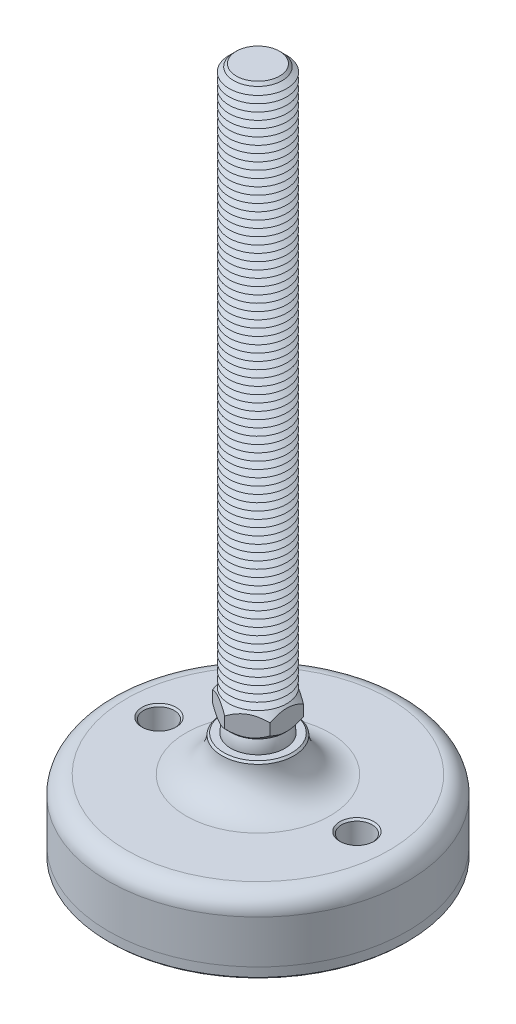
ISO-10303-21;
HEADER;
FILE_DESCRIPTION(('STEP AP214'),'2;1');
FILE_NAME('part.step','',(''),(''),'','','');
FILE_SCHEMA(('AUTOMOTIVE_DESIGN { 1 0 10303 214 1 1 1 1 }'));
ENDSEC;
DATA;
#1=APPLICATION_CONTEXT('core data for automotive mechanical design processes');
#2=APPLICATION_PROTOCOL_DEFINITION('international standard','automotive_design',2000,#1);
#3=PRODUCT_CONTEXT('',#1,'mechanical');
#4=PRODUCT('Part','Part','',(#3));
#5=PRODUCT_RELATED_PRODUCT_CATEGORY('part','',(#4));
#6=PRODUCT_DEFINITION_FORMATION('','',#4);
#7=PRODUCT_DEFINITION_CONTEXT('part definition',#1,'design');
#8=PRODUCT_DEFINITION('design','',#6,#7);
#9=PRODUCT_DEFINITION_SHAPE('','',#8);
#10=(LENGTH_UNIT() NAMED_UNIT(*) SI_UNIT(.MILLI.,.METRE.));
#11=(NAMED_UNIT(*) PLANE_ANGLE_UNIT() SI_UNIT($,.RADIAN.));
#12=(NAMED_UNIT(*) SI_UNIT($,.STERADIAN.) SOLID_ANGLE_UNIT());
#13=UNCERTAINTY_MEASURE_WITH_UNIT(LENGTH_MEASURE(1.E-05),#10,'distance_accuracy_value','');
#14=(GEOMETRIC_REPRESENTATION_CONTEXT(3) GLOBAL_UNCERTAINTY_ASSIGNED_CONTEXT((#13)) GLOBAL_UNIT_ASSIGNED_CONTEXT((#10,
#11,#12)) REPRESENTATION_CONTEXT('',''));
#15=CARTESIAN_POINT('',(0.,0.,0.));
#16=DIRECTION('',(0.,0.,1.));
#17=DIRECTION('',(1.,0.,0.));
#18=AXIS2_PLACEMENT_3D('',#15,#16,#17);
#19=CARTESIAN_POINT('',(0.,-27.,0.));
#20=DIRECTION('',(0.,1.,0.));
#21=DIRECTION('',(0.,0.,1.));
#22=AXIS2_PLACEMENT_3D('',#19,#20,#21);
#23=PLANE('',#22);
#24=CARTESIAN_POINT('',(-27.5,-27.,0.));
#25=DIRECTION('',(0.,1.,0.));
#26=DIRECTION('',(0.,0.,1.));
#27=AXIS2_PLACEMENT_3D('',#24,#25,#26);
#28=CIRCLE('',#27,4.25000000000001);
#29=CARTESIAN_POINT('',(-27.5,-27.,4.25000000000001));
#30=VERTEX_POINT('',#29);
#31=EDGE_CURVE('P0_E43',#30,#30,#28,.T.);
#32=ORIENTED_EDGE('',*,*,#31,.F.);
#33=EDGE_LOOP('',(#32));
#34=FACE_BOUND('',#33,.T.);
#35=CARTESIAN_POINT('',(27.5,-27.,0.));
#36=DIRECTION('',(0.,1.,0.));
#37=DIRECTION('',(0.,0.,1.));
#38=AXIS2_PLACEMENT_3D('',#35,#36,#37);
#39=CIRCLE('',#38,4.25000000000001);
#40=CARTESIAN_POINT('',(27.5,-27.,4.25000000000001));
#41=VERTEX_POINT('',#40);
#42=EDGE_CURVE('P0_E44',#41,#41,#39,.T.);
#43=ORIENTED_EDGE('',*,*,#42,.F.);
#44=EDGE_LOOP('',(#43));
#45=FACE_BOUND('',#44,.T.);
#46=CARTESIAN_POINT('',(0.,-27.,0.));
#47=DIRECTION('',(0.,1.,0.));
#48=DIRECTION('',(0.,0.,1.));
#49=AXIS2_PLACEMENT_3D('',#46,#47,#48);
#50=CIRCLE('',#49,41.5);
#51=CARTESIAN_POINT('',(0.,-27.,41.5));
#52=VERTEX_POINT('',#51);
#53=EDGE_CURVE('P0_E40',#52,#52,#50,.T.);
#54=ORIENTED_EDGE('',*,*,#53,.T.);
#55=EDGE_LOOP('',(#54));
#56=FACE_BOUND('',#55,.T.);
#57=ADVANCED_FACE('P0_F14',(#34,#45,#56),#23,.T.);
#58=CARTESIAN_POINT('',(0.,48.1654938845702,0.));
#59=DIRECTION('',(0.,1.,0.));
#60=DIRECTION('',(0.,0.,1.));
#61=AXIS2_PLACEMENT_3D('',#58,#59,#60);
#62=CYLINDRICAL_SURFACE('',#61,41.5);
#63=CARTESIAN_POINT('',(0.,-29.5,0.));
#64=DIRECTION('',(0.,-1.,0.));
#65=DIRECTION('',(0.,0.,-1.));
#66=AXIS2_PLACEMENT_3D('',#63,#64,#65);
#67=CIRCLE('',#66,41.5);
#68=CARTESIAN_POINT('',(0.,-29.5,-41.5));
#69=VERTEX_POINT('',#68);
#70=EDGE_CURVE('P0_E37',#69,#69,#67,.F.);
#71=ORIENTED_EDGE('',*,*,#70,.T.);
#72=EDGE_LOOP('',(#71));
#73=FACE_BOUND('',#72,.T.);
#74=ORIENTED_EDGE('',*,*,#53,.F.);
#75=EDGE_LOOP('',(#74));
#76=FACE_BOUND('',#75,.T.);
#77=ADVANCED_FACE('P0_F54',(#73,#76),#62,.T.);
#78=CARTESIAN_POINT('',(0.,-30.,41.5));
#79=DIRECTION('',(0.,-1.,0.));
#80=DIRECTION('',(0.,0.,-1.));
#81=AXIS2_PLACEMENT_3D('',#78,#79,#80);
#82=PLANE('',#81);
#83=CARTESIAN_POINT('',(27.5,-30.,0.));
#84=DIRECTION('',(0.,-1.,0.));
#85=DIRECTION('',(0.,0.,-1.));
#86=AXIS2_PLACEMENT_3D('',#83,#84,#85);
#87=CIRCLE('',#86,4.75);
#88=CARTESIAN_POINT('',(27.5,-30.,-4.75000000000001));
#89=VERTEX_POINT('',#88);
#90=EDGE_CURVE('P0_E25',#89,#89,#87,.F.);
#91=ORIENTED_EDGE('',*,*,#90,.T.);
#92=EDGE_LOOP('',(#91));
#93=FACE_BOUND('',#92,.T.);
#94=CARTESIAN_POINT('',(-27.5,-30.,0.));
#95=DIRECTION('',(0.,-1.,0.));
#96=DIRECTION('',(0.,0.,-1.));
#97=AXIS2_PLACEMENT_3D('',#94,#95,#96);
#98=CIRCLE('',#97,4.75);
#99=CARTESIAN_POINT('',(-27.5,-30.,-4.75));
#100=VERTEX_POINT('',#99);
#101=EDGE_CURVE('P0_E29',#100,#100,#98,.F.);
#102=ORIENTED_EDGE('',*,*,#101,.T.);
#103=EDGE_LOOP('',(#102));
#104=FACE_BOUND('',#103,.T.);
#105=CARTESIAN_POINT('',(0.,-30.,0.));
#106=DIRECTION('',(0.,-1.,0.));
#107=DIRECTION('',(0.,0.,-1.));
#108=AXIS2_PLACEMENT_3D('',#105,#106,#107);
#109=CIRCLE('',#108,41.);
#110=CARTESIAN_POINT('',(0.,-30.,-41.));
#111=VERTEX_POINT('',#110);
#112=EDGE_CURVE('P0_E34',#111,#111,#109,.T.);
#113=ORIENTED_EDGE('',*,*,#112,.T.);
#114=EDGE_LOOP('',(#113));
#115=FACE_BOUND('',#114,.T.);
#116=ADVANCED_FACE('P0_F61',(#93,#104,#115),#82,.T.);
#117=CARTESIAN_POINT('',(0.,-29.5,0.));
#118=DIRECTION('',(0.,1.,0.));
#119=DIRECTION('',(0.,0.,1.));
#120=AXIS2_PLACEMENT_3D('',#117,#118,#119);
#121=CONICAL_SURFACE('',#120,41.5,0.785398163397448);
#122=ORIENTED_EDGE('',*,*,#112,.F.);
#123=EDGE_LOOP('',(#122));
#124=FACE_BOUND('',#123,.T.);
#125=ORIENTED_EDGE('',*,*,#70,.F.);
#126=EDGE_LOOP('',(#125));
#127=FACE_BOUND('',#126,.T.);
#128=ADVANCED_FACE('P0_F68',(#124,#127),#121,.T.);
#129=CARTESIAN_POINT('',(27.5,-30.,0.));
#130=DIRECTION('',(0.,1.,0.));
#131=DIRECTION('',(0.,0.,1.));
#132=AXIS2_PLACEMENT_3D('',#129,#130,#131);
#133=CYLINDRICAL_SURFACE('',#132,4.25000000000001);
#134=CARTESIAN_POINT('',(27.5,-29.5,0.));
#135=DIRECTION('',(0.,-1.,0.));
#136=DIRECTION('',(0.,0.,-1.));
#137=AXIS2_PLACEMENT_3D('',#134,#135,#136);
#138=CIRCLE('',#137,4.25000000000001);
#139=CARTESIAN_POINT('',(27.5,-29.5,-4.25000000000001));
#140=VERTEX_POINT('',#139);
#141=EDGE_CURVE('P0_E21',#140,#140,#138,.T.);
#142=ORIENTED_EDGE('',*,*,#141,.T.);
#143=EDGE_LOOP('',(#142));
#144=FACE_BOUND('',#143,.T.);
#145=ORIENTED_EDGE('',*,*,#42,.T.);
#146=EDGE_LOOP('',(#145));
#147=FACE_BOUND('',#146,.T.);
#148=ADVANCED_FACE('P0_F74',(#144,#147),#133,.F.);
#149=CARTESIAN_POINT('',(-27.5,-30.,0.));
#150=DIRECTION('',(0.,1.,0.));
#151=DIRECTION('',(0.,0.,1.));
#152=AXIS2_PLACEMENT_3D('',#149,#150,#151);
#153=CYLINDRICAL_SURFACE('',#152,4.25000000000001);
#154=CARTESIAN_POINT('',(-27.5,-29.5,0.));
#155=DIRECTION('',(0.,-1.,0.));
#156=DIRECTION('',(0.,0.,-1.));
#157=AXIS2_PLACEMENT_3D('',#154,#155,#156);
#158=CIRCLE('',#157,4.25000000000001);
#159=CARTESIAN_POINT('',(-27.5,-29.5,-4.25000000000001));
#160=VERTEX_POINT('',#159);
#161=EDGE_CURVE('P0_E10',#160,#160,#158,.T.);
#162=ORIENTED_EDGE('',*,*,#161,.T.);
#163=EDGE_LOOP('',(#162));
#164=FACE_BOUND('',#163,.T.);
#165=ORIENTED_EDGE('',*,*,#31,.T.);
#166=EDGE_LOOP('',(#165));
#167=FACE_BOUND('',#166,.T.);
#168=ADVANCED_FACE('P0_F50',(#164,#167),#153,.F.);
#169=CARTESIAN_POINT('',(27.5,-30.,0.));
#170=DIRECTION('',(0.,-1.,0.));
#171=DIRECTION('',(0.,0.,-1.));
#172=AXIS2_PLACEMENT_3D('',#169,#170,#171);
#173=CONICAL_SURFACE('',#172,4.75,0.785398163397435);
#174=ORIENTED_EDGE('',*,*,#141,.F.);
#175=EDGE_LOOP('',(#174));
#176=FACE_BOUND('',#175,.T.);
#177=ORIENTED_EDGE('',*,*,#90,.F.);
#178=EDGE_LOOP('',(#177));
#179=FACE_BOUND('',#178,.T.);
#180=ADVANCED_FACE('P0_F76',(#176,#179),#173,.F.);
#181=CARTESIAN_POINT('',(-27.5,-30.,0.));
#182=DIRECTION('',(0.,-1.,0.));
#183=DIRECTION('',(0.,0.,-1.));
#184=AXIS2_PLACEMENT_3D('',#181,#182,#183);
#185=CONICAL_SURFACE('',#184,4.75,0.785398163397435);
#186=ORIENTED_EDGE('',*,*,#161,.F.);
#187=EDGE_LOOP('',(#186));
#188=FACE_BOUND('',#187,.T.);
#189=ORIENTED_EDGE('',*,*,#101,.F.);
#190=EDGE_LOOP('',(#189));
#191=FACE_BOUND('',#190,.T.);
#192=ADVANCED_FACE('P0_F16',(#188,#191),#185,.F.);
#193=CLOSED_SHELL('',(#57,#77,#116,#128,#148,#168,#180,#192));
#194=MANIFOLD_SOLID_BREP('P0_B1',#193);
#195=CARTESIAN_POINT('',(0.,3.75,0.));
#196=DIRECTION('',(0.,1.,0.));
#197=DIRECTION('',(0.,0.,1.));
#198=AXIS2_PLACEMENT_3D('',#195,#196,#197);
#199=PLANE('',#198);
#200=CARTESIAN_POINT('',(0.,3.75,0.));
#201=DIRECTION('',(0.,1.,0.));
#202=DIRECTION('',(0.,0.,1.));
#203=AXIS2_PLACEMENT_3D('',#200,#201,#202);
#204=CIRCLE('',#203,7.41889346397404);
#205=CARTESIAN_POINT('',(0.,3.75,7.41889346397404));
#206=VERTEX_POINT('',#205);
#207=EDGE_CURVE('P1_E213',#206,#206,#204,.T.);
#208=ORIENTED_EDGE('',*,*,#207,.F.);
#209=EDGE_LOOP('',(#208));
#210=FACE_BOUND('',#209,.T.);
#211=CARTESIAN_POINT('',(0.,3.75,0.));
#212=DIRECTION('',(0.,1.,0.));
#213=DIRECTION('',(0.,0.,1.));
#214=AXIS2_PLACEMENT_3D('',#211,#212,#213);
#215=CIRCLE('',#214,6.49519052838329);
#216=CARTESIAN_POINT('',(0.,3.75,6.49519052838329));
#217=VERTEX_POINT('',#216);
#218=EDGE_CURVE('P1_E25',#217,#217,#215,.F.);
#219=ORIENTED_EDGE('',*,*,#218,.F.);
#220=EDGE_LOOP('',(#219));
#221=FACE_BOUND('',#220,.T.);
#222=ADVANCED_FACE('P1_F16',(#210,#221),#199,.F.);
#223=CARTESIAN_POINT('',(0.,0.,0.));
#224=DIRECTION('',(0.,1.,0.));
#225=DIRECTION('',(0.,0.,-1.));
#226=AXIS2_PLACEMENT_3D('',#223,#224,#225);
#227=SPHERICAL_SURFACE('',#226,7.5);
#228=ORIENTED_EDGE('',*,*,#218,.T.);
#229=EDGE_LOOP('',(#228));
#230=FACE_BOUND('',#229,.T.);
#231=ADVANCED_FACE('P1_F203',(#230),#227,.T.);
#232=CARTESIAN_POINT('',(0.,3.75,0.));
#233=DIRECTION('',(0.,1.,0.));
#234=DIRECTION('',(0.,0.,1.));
#235=AXIS2_PLACEMENT_3D('',#232,#233,#234);
#236=CONICAL_SURFACE('',#235,7.41889346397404,0.785398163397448);
#237=ORIENTED_EDGE('',*,*,#207,.T.);
#238=EDGE_LOOP('',(#237));
#239=FACE_BOUND('',#238,.T.);
#240=CARTESIAN_POINT('',(-8.,8.67915108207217,-9.40607272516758));
#241=CARTESIAN_POINT('',(-8.,8.50538061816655,-9.17789983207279));
#242=CARTESIAN_POINT('',(-8.,8.33323236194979,-8.94847140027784));
#243=CARTESIAN_POINT('',(-8.,7.99291342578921,-8.48659991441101));
#244=CARTESIAN_POINT('',(-8.,7.82474372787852,-8.2541561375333));
#245=CARTESIAN_POINT('',(-8.,7.49191829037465,-7.78405005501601));
#246=CARTESIAN_POINT('',(-8.,7.32729980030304,-7.54636128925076));
#247=CARTESIAN_POINT('',(-8.,7.00401259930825,-7.066984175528));
#248=CARTESIAN_POINT('',(-8.,6.8453434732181,-6.82529610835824));
#249=CARTESIAN_POINT('',(-8.,6.52599353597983,-6.32262937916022));
#250=CARTESIAN_POINT('',(-8.,6.36576297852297,-6.06136321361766));
#251=CARTESIAN_POINT('',(-8.,6.05556462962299,-5.53271317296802));
#252=CARTESIAN_POINT('',(-8.,5.90559851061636,-5.26532831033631));
#253=CARTESIAN_POINT('',(-8.,5.61914583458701,-4.72442075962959));
#254=CARTESIAN_POINT('',(-8.,5.48261965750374,-4.45091921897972));
#255=CARTESIAN_POINT('',(-8.,5.22610459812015,-3.8963297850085));
#256=CARTESIAN_POINT('',(-8.,5.10610808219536,-3.61524546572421));
#257=CARTESIAN_POINT('',(-8.,4.89671738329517,-3.07036571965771));
#258=CARTESIAN_POINT('',(-8.,4.80554986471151,-2.80725883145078));
#259=CARTESIAN_POINT('',(-8.,4.64429812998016,-2.27454068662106));
#260=CARTESIAN_POINT('',(-8.,4.57421531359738,-2.00492899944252));
#261=CARTESIAN_POINT('',(-8.,4.46001937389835,-1.46539071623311));
#262=CARTESIAN_POINT('',(-8.,4.41544920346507,-1.19556248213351));
#263=CARTESIAN_POINT('',(-8.,4.35317465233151,-0.652806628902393));
#264=CARTESIAN_POINT('',(-8.,4.33546523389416,-0.379879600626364));
#265=CARTESIAN_POINT('',(-8.,4.3283167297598,0.155555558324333));
#266=CARTESIAN_POINT('',(-8.,4.33778869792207,0.418049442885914));
#267=CARTESIAN_POINT('',(-8.,4.38202991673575,0.940882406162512));
#268=CARTESIAN_POINT('',(-8.,4.41680155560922,1.2012212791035));
#269=CARTESIAN_POINT('',(-8.,4.51030475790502,1.72226548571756));
#270=CARTESIAN_POINT('',(-8.,4.56945097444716,1.9828951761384));
#271=CARTESIAN_POINT('',(-8.,4.7084911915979,2.498449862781));
#272=CARTESIAN_POINT('',(-8.,4.78838370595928,2.75337526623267));
#273=CARTESIAN_POINT('',(-8.,4.97226877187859,3.27629811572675));
#274=CARTESIAN_POINT('',(-8.,5.07763590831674,3.54380699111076));
#275=CARTESIAN_POINT('',(-8.,5.3045984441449,4.07191058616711));
#276=CARTESIAN_POINT('',(-8.,5.4262012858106,4.33250206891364));
#277=CARTESIAN_POINT('',(-8.,5.68274705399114,4.84802310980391));
#278=CARTESIAN_POINT('',(-8.,5.81773148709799,5.10293184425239));
#279=CARTESIAN_POINT('',(-8.,6.09806326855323,5.60689577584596));
#280=CARTESIAN_POINT('',(-8.,6.24340899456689,5.85595188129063));
#281=CARTESIAN_POINT('',(-8.,6.53502315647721,6.33676586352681));
#282=CARTESIAN_POINT('',(-8.,6.68088884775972,6.56876930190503));
#283=CARTESIAN_POINT('',(-8.,6.97879220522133,7.0287915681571));
#284=CARTESIAN_POINT('',(-8.,7.13083033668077,7.2568100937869));
#285=CARTESIAN_POINT('',(-8.,7.43872962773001,7.70754250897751));
#286=CARTESIAN_POINT('',(-8.,7.59454998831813,7.93028436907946));
#287=CARTESIAN_POINT('',(-8.,7.9103399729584,8.37271804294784));
#288=CARTESIAN_POINT('',(-8.,8.07030844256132,8.59241067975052));
#289=CARTESIAN_POINT('',(-8.,8.23197385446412,8.81082532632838));
#290=B_SPLINE_CURVE_WITH_KNOTS('',3,(#240,#241,#242,#243,#244,#245,#246,#247,#248,#249,#250,
#251,#252,#253,#254,#255,#256,#257,#258,#259,#260,#261,#262,#263,#264,#265,#266,#267,#268,#269,
#270,#271,#272,#273,#274,#275,#276,#277,#278,#279,#280,#281,#282,#283,#284,#285,#286,#287,#288,
#289),.UNSPECIFIED.,.F.,.F.,(4,2,2,2,2,2,2,2,2,2,2,2,2,2,2,2,2,2,2,2,2,2,2,2,4),(0.,
0.860441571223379,1.72109335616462,2.58840332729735,3.4556526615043,4.3749240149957,
5.2943447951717,6.21096847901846,7.12716742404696,7.96180281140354,8.7964935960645,
9.6157214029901,10.4347955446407,11.2215193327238,12.0083173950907,12.8090921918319,
13.6098096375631,14.471679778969,15.3339463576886,16.1989765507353,17.0638715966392,
17.8859014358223,18.7079933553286,19.5234450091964,20.3386721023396),.UNSPECIFIED.);
#291=CARTESIAN_POINT('',(-8.,5.56871084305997,-4.61880215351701));
#292=VERTEX_POINT('',#291);
#293=CARTESIAN_POINT('',(-8.,5.56871084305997,4.61880215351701));
#294=VERTEX_POINT('',#293);
#295=EDGE_CURVE('P1_E187',#292,#294,#290,.T.);
#296=ORIENTED_EDGE('',*,*,#295,.F.);
#297=CARTESIAN_POINT('',(0.000200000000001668,5.56882631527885,-9.23771977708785));
#298=CARTESIAN_POINT('',(-0.137352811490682,5.48941910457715,-9.15830362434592));
#299=CARTESIAN_POINT('',(-0.275962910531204,5.41244881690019,-9.07827704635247));
#300=CARTESIAN_POINT('',(-0.55550509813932,5.2641233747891,-8.91688328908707));
#301=CARTESIAN_POINT('',(-0.696438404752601,5.19277128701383,-8.83551540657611));
#302=CARTESIAN_POINT('',(-1.12434348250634,4.98764582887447,-8.58846429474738));
#303=CARTESIAN_POINT('',(-1.41493761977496,4.86367829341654,-8.42068969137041));
#304=CARTESIAN_POINT('',(-2.00094388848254,4.65139259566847,-8.08235881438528));
#305=CARTESIAN_POINT('',(-2.29620625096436,4.56253963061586,-7.91188900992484));
#306=CARTESIAN_POINT('',(-2.74395385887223,4.45975870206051,-7.65338180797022));
#307=CARTESIAN_POINT('',(-2.89386225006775,4.43059522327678,-7.5668321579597));
#308=CARTESIAN_POINT('',(-3.19494827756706,4.38309436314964,-7.39300005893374));
#309=CARTESIAN_POINT('',(-3.34612572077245,4.36475536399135,-7.30571772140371));
#310=CARTESIAN_POINT('',(-3.71452735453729,4.33400721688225,-7.09302093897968));
#311=CARTESIAN_POINT('',(-3.93214848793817,4.32755588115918,-6.96737731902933));
#312=CARTESIAN_POINT('',(-4.36699849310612,4.33838546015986,-6.71631655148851));
#313=CARTESIAN_POINT('',(-4.58422720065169,4.3556746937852,-6.59089949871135));
#314=CARTESIAN_POINT('',(-5.01663658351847,4.41296627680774,-6.3412478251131));
#315=CARTESIAN_POINT('',(-5.23181469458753,4.45299402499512,-6.21701468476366));
#316=CARTESIAN_POINT('',(-5.65847251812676,4.55358648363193,-5.97068367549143));
#317=CARTESIAN_POINT('',(-5.86995251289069,4.61414961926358,-5.84858564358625));
#318=CARTESIAN_POINT('',(-6.24536139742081,4.73874447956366,-5.63184322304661));
#319=CARTESIAN_POINT('',(-6.41012167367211,4.79949896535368,-5.53671883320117));
#320=CARTESIAN_POINT('',(-6.73668469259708,4.93079799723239,-5.34817758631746));
#321=CARTESIAN_POINT('',(-6.89848734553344,5.00134283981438,-5.25476078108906));
#322=CARTESIAN_POINT('',(-7.21862548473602,5.1506413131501,-5.06992894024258));
#323=CARTESIAN_POINT('',(-7.37697007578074,5.22936912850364,-4.97850864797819));
#324=CARTESIAN_POINT('',(-7.69072726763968,5.39400001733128,-4.79736084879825));
#325=CARTESIAN_POINT('',(-7.84614159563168,5.47989869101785,-4.70763234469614));
#326=CARTESIAN_POINT('',(-8.0002,5.56882631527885,-4.61868668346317));
#327=B_SPLINE_CURVE_WITH_KNOTS('',3,(#297,#298,#299,#300,#301,#302,#303,#304,#305,#306,#307,
#308,#309,#310,#311,#312,#313,#314,#315,#316,#317,#318,#319,#320,#321,#322,#323,#324,#325,#326),
.UNSPECIFIED.,.F.,.F.,(4,2,2,2,2,2,2,2,2,2,2,2,2,2,4),(0.,0.53269658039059,1.06568194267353,
2.13740664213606,3.19211397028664,3.71843331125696,4.24467396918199,4.99761238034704,
5.75081469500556,6.50485999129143,7.25884747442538,7.85770857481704,8.45658781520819,
9.05363199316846,9.65031250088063),.UNSPECIFIED.);
#328=CARTESIAN_POINT('',(0.,5.56871084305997,-9.23760430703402));
#329=VERTEX_POINT('',#328);
#330=EDGE_CURVE('P1_E181',#329,#292,#327,.T.);
#331=ORIENTED_EDGE('',*,*,#330,.F.);
#332=CARTESIAN_POINT('',(8.0002,5.56882631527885,-4.61868668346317));
#333=CARTESIAN_POINT('',(7.86264718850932,5.48941910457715,-4.69810283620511));
#334=CARTESIAN_POINT('',(7.72403708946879,5.4124488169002,-4.77812941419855));
#335=CARTESIAN_POINT('',(7.44449490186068,5.2641233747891,-4.93952317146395));
#336=CARTESIAN_POINT('',(7.3035615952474,5.19277128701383,-5.02089105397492));
#337=CARTESIAN_POINT('',(6.87565651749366,4.98764582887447,-5.26794216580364));
#338=CARTESIAN_POINT('',(6.58506238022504,4.86367829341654,-5.43571676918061));
#339=CARTESIAN_POINT('',(5.99905611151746,4.65139259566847,-5.77404764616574));
#340=CARTESIAN_POINT('',(5.70379374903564,4.56253963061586,-5.94451745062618));
#341=CARTESIAN_POINT('',(5.25604614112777,4.45975870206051,-6.2030246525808));
#342=CARTESIAN_POINT('',(5.10613774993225,4.43059522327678,-6.28957430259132));
#343=CARTESIAN_POINT('',(4.80505172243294,4.38309436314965,-6.46340640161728));
#344=CARTESIAN_POINT('',(4.65387427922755,4.36475536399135,-6.55068873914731));
#345=CARTESIAN_POINT('',(4.28547264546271,4.33400721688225,-6.76338552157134));
#346=CARTESIAN_POINT('',(4.06785151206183,4.32755588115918,-6.88902914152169));
#347=CARTESIAN_POINT('',(3.63300150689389,4.33838546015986,-7.14008990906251));
#348=CARTESIAN_POINT('',(3.41577279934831,4.3556746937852,-7.26550696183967));
#349=CARTESIAN_POINT('',(2.98336341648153,4.41296627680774,-7.51515863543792));
#350=CARTESIAN_POINT('',(2.76818530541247,4.45299402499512,-7.63939177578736));
#351=CARTESIAN_POINT('',(2.34152748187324,4.55358648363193,-7.88572278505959));
#352=CARTESIAN_POINT('',(2.13004748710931,4.61414961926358,-8.00782081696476));
#353=CARTESIAN_POINT('',(1.75463860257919,4.73874447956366,-8.22456323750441));
#354=CARTESIAN_POINT('',(1.58987832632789,4.79949896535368,-8.31968762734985));
#355=CARTESIAN_POINT('',(1.26331530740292,4.93079799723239,-8.50822887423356));
#356=CARTESIAN_POINT('',(1.10151265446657,5.00134283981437,-8.60164567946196));
#357=CARTESIAN_POINT('',(0.781374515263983,5.1506413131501,-8.78647752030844));
#358=CARTESIAN_POINT('',(0.623029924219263,5.22936912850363,-8.87789781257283));
#359=CARTESIAN_POINT('',(0.309272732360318,5.39400001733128,-9.05904561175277));
#360=CARTESIAN_POINT('',(0.153858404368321,5.47989869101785,-9.14877411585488));
#361=CARTESIAN_POINT('',(-0.000199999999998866,5.56882631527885,-9.23771977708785));
#362=B_SPLINE_CURVE_WITH_KNOTS('',3,(#332,#333,#334,#335,#336,#337,#338,#339,#340,#341,#342,
#343,#344,#345,#346,#347,#348,#349,#350,#351,#352,#353,#354,#355,#356,#357,#358,#359,#360,#361),
.UNSPECIFIED.,.F.,.F.,(4,2,2,2,2,2,2,2,2,2,2,2,2,2,4),(0.,0.532696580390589,1.06568194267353,
2.13740664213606,3.19211397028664,3.71843331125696,4.24467396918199,4.99761238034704,
5.75081469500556,6.50485999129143,7.25884747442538,7.85770857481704,8.45658781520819,
9.05363199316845,9.65031250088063),.UNSPECIFIED.);
#363=CARTESIAN_POINT('',(8.,5.56871084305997,-4.61880215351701));
#364=VERTEX_POINT('',#363);
#365=EDGE_CURVE('P1_E169',#364,#329,#362,.T.);
#366=ORIENTED_EDGE('',*,*,#365,.F.);
#367=CARTESIAN_POINT('',(8.,8.67915108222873,-9.40607272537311));
#368=CARTESIAN_POINT('',(8.,8.50538061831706,-9.17789983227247));
#369=CARTESIAN_POINT('',(8.,8.33323236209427,-8.94847140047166));
#370=CARTESIAN_POINT('',(8.,7.99291342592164,-8.48659991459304));
#371=CARTESIAN_POINT('',(8.,7.82474372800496,-8.25415613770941));
#372=CARTESIAN_POINT('',(8.,7.49191829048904,-7.78405005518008));
#373=CARTESIAN_POINT('',(8.,7.32729980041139,-7.54636128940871));
#374=CARTESIAN_POINT('',(8.,7.00401259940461,-7.0669841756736));
#375=CARTESIAN_POINT('',(8.,6.84534347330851,-6.82529610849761));
#376=CARTESIAN_POINT('',(8.,6.52599353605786,-6.32262937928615));
#377=CARTESIAN_POINT('',(8.,6.36576297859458,-6.06136321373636));
#378=CARTESIAN_POINT('',(8.,6.05556462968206,-5.53271317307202));
#379=CARTESIAN_POINT('',(8.,5.90559851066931,-5.26532831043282));
#380=CARTESIAN_POINT('',(8.,5.61914583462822,-4.72442075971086));
#381=CARTESIAN_POINT('',(8.,5.48261965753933,-4.45091921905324));
#382=CARTESIAN_POINT('',(8.,5.22610459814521,-3.8963297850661));
#383=CARTESIAN_POINT('',(8.,5.10610808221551,-3.61524546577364));
#384=CARTESIAN_POINT('',(8.,4.89671738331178,-3.07036571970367));
#385=CARTESIAN_POINT('',(8.,4.80554986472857,-2.8072588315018));
#386=CARTESIAN_POINT('',(8.,4.6442981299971,-2.27454068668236));
#387=CARTESIAN_POINT('',(8.,4.57421531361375,-2.00492899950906));
#388=CARTESIAN_POINT('',(8.,4.46001937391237,-1.46539071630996));
#389=CARTESIAN_POINT('',(8.,4.41544920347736,-1.19556248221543));
#390=CARTESIAN_POINT('',(8.,4.35317465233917,-0.65280662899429));
#391=CARTESIAN_POINT('',(8.,4.33546523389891,-0.379879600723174));
#392=CARTESIAN_POINT('',(8.,4.32831672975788,0.155555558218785));
#393=CARTESIAN_POINT('',(8.,4.33778869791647,0.41804944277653));
#394=CARTESIAN_POINT('',(8.,4.38202991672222,0.940882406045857));
#395=CARTESIAN_POINT('',(8.,4.41680155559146,1.20122127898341));
#396=CARTESIAN_POINT('',(8.,4.51030475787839,1.72226548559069));
#397=CARTESIAN_POINT('',(8.,4.56945097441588,1.9828951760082));
#398=CARTESIAN_POINT('',(8.,4.70849119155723,2.49844986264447));
#399=CARTESIAN_POINT('',(8.,4.78838370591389,2.75337526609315));
#400=CARTESIAN_POINT('',(8.,4.97226877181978,3.27629811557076));
#401=CARTESIAN_POINT('',(8.,5.07763590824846,3.5438069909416));
#402=CARTESIAN_POINT('',(8.,5.30459844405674,4.07191058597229));
#403=CARTESIAN_POINT('',(8.,5.42620128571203,4.33250206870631));
#404=CARTESIAN_POINT('',(8.,5.68274705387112,4.84802310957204));
#405=CARTESIAN_POINT('',(8.,5.81773148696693,5.10293184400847));
#406=CARTESIAN_POINT('',(8.,6.09806326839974,5.60689577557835));
#407=CARTESIAN_POINT('',(8.,6.24340899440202,5.85595188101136));
#408=CARTESIAN_POINT('',(8.,6.53502315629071,6.33676586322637));
#409=CARTESIAN_POINT('',(8.,6.68088884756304,6.56876930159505));
#410=CARTESIAN_POINT('',(8.,6.97879220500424,7.02879156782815));
#411=CARTESIAN_POINT('',(8.,7.13083033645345,7.25681009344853));
#412=CARTESIAN_POINT('',(8.,7.43872962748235,7.70754250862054));
#413=CARTESIAN_POINT('',(8.,7.59454998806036,7.93028436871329));
#414=CARTESIAN_POINT('',(8.,7.91033997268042,8.37271804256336));
#415=CARTESIAN_POINT('',(8.,8.07030844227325,8.59241067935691));
#416=CARTESIAN_POINT('',(8.,8.23197385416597,8.81082532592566));
#417=B_SPLINE_CURVE_WITH_KNOTS('',3,(#367,#368,#369,#370,#371,#372,#373,#374,#375,#376,#377,
#378,#379,#380,#381,#382,#383,#384,#385,#386,#387,#388,#389,#390,#391,#392,#393,#394,#395,#396,
#397,#398,#399,#400,#401,#402,#403,#404,#405,#406,#407,#408,#409,#410,#411,#412,#413,#414,#415,
#416),.UNSPECIFIED.,.F.,.F.,(4,2,2,2,2,2,2,2,2,2,2,2,2,2,2,2,2,2,2,2,2,2,2,2,4),(0.,
0.860441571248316,1.7210933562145,2.58840332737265,3.45565266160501,4.37492401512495,
5.2943447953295,6.21096847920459,7.12716742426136,7.96180281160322,8.79649359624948,
9.61572140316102,10.4347955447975,11.2215193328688,12.0083173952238,12.8090921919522,
13.6098096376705,14.4716797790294,15.3339463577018,16.1989765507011,17.0638715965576,
17.8859014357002,18.7079933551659,19.5234450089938,20.338672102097),.UNSPECIFIED.);
#418=CARTESIAN_POINT('',(8.,5.56871084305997,4.61880215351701));
#419=VERTEX_POINT('',#418);
#420=EDGE_CURVE('P1_E71',#419,#364,#417,.F.);
#421=ORIENTED_EDGE('',*,*,#420,.F.);
#422=CARTESIAN_POINT('',(-0.000199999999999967,5.56882631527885,9.23771977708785));
#423=CARTESIAN_POINT('',(0.137352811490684,5.48941910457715,9.15830362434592));
#424=CARTESIAN_POINT('',(0.275962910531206,5.41244881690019,9.07827704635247));
#425=CARTESIAN_POINT('',(0.555505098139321,5.2641233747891,8.91688328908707));
#426=CARTESIAN_POINT('',(0.696438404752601,5.19277128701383,8.83551540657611));
#427=CARTESIAN_POINT('',(1.12434348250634,4.98764582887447,8.58846429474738));
#428=CARTESIAN_POINT('',(1.41493761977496,4.86367829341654,8.42068969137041));
#429=CARTESIAN_POINT('',(2.00094388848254,4.65139259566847,8.08235881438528));
#430=CARTESIAN_POINT('',(2.29620625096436,4.56253963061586,7.91188900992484));
#431=CARTESIAN_POINT('',(2.74395385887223,4.45975870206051,7.65338180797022));
#432=CARTESIAN_POINT('',(2.89386225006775,4.43059522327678,7.5668321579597));
#433=CARTESIAN_POINT('',(3.19494827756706,4.38309436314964,7.39300005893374));
#434=CARTESIAN_POINT('',(3.34612572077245,4.36475536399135,7.30571772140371));
#435=CARTESIAN_POINT('',(3.71452735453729,4.33400721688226,7.09302093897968));
#436=CARTESIAN_POINT('',(3.93214848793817,4.32755588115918,6.96737731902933));
#437=CARTESIAN_POINT('',(4.36699849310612,4.33838546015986,6.71631655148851));
#438=CARTESIAN_POINT('',(4.58422720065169,4.3556746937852,6.59089949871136));
#439=CARTESIAN_POINT('',(5.01663658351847,4.41296627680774,6.3412478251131));
#440=CARTESIAN_POINT('',(5.23181469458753,4.45299402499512,6.21701468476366));
#441=CARTESIAN_POINT('',(5.65847251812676,4.55358648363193,5.97068367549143));
#442=CARTESIAN_POINT('',(5.86995251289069,4.61414961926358,5.84858564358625));
#443=CARTESIAN_POINT('',(6.24536139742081,4.73874447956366,5.63184322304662));
#444=CARTESIAN_POINT('',(6.41012167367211,4.79949896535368,5.53671883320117));
#445=CARTESIAN_POINT('',(6.73668469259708,4.93079799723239,5.34817758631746));
#446=CARTESIAN_POINT('',(6.89848734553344,5.00134283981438,5.25476078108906));
#447=CARTESIAN_POINT('',(7.21862548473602,5.1506413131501,5.06992894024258));
#448=CARTESIAN_POINT('',(7.37697007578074,5.22936912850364,4.97850864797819));
#449=CARTESIAN_POINT('',(7.69072726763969,5.39400001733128,4.79736084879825));
#450=CARTESIAN_POINT('',(7.84614159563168,5.47989869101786,4.70763234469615));
#451=CARTESIAN_POINT('',(8.0002,5.56882631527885,4.61868668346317));
#452=B_SPLINE_CURVE_WITH_KNOTS('',3,(#422,#423,#424,#425,#426,#427,#428,#429,#430,#431,#432,
#433,#434,#435,#436,#437,#438,#439,#440,#441,#442,#443,#444,#445,#446,#447,#448,#449,#450,#451),
.UNSPECIFIED.,.F.,.F.,(4,2,2,2,2,2,2,2,2,2,2,2,2,2,4),(0.,0.532696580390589,1.06568194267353,
2.13740664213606,3.19211397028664,3.71843331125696,4.24467396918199,4.99761238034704,
5.75081469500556,6.50485999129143,7.25884747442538,7.85770857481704,8.45658781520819,
9.05363199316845,9.65031250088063),.UNSPECIFIED.);
#453=CARTESIAN_POINT('',(0.,5.56871084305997,9.23760430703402));
#454=VERTEX_POINT('',#453);
#455=EDGE_CURVE('P1_E68',#454,#419,#452,.T.);
#456=ORIENTED_EDGE('',*,*,#455,.F.);
#457=CARTESIAN_POINT('',(-8.0002,5.56882631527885,4.61868668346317));
#458=CARTESIAN_POINT('',(-7.86264718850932,5.48941910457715,4.6981028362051));
#459=CARTESIAN_POINT('',(-7.7240370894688,5.41244881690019,4.77812941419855));
#460=CARTESIAN_POINT('',(-7.44449490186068,5.2641233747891,4.93952317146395));
#461=CARTESIAN_POINT('',(-7.3035615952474,5.19277128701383,5.02089105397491));
#462=CARTESIAN_POINT('',(-6.87565651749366,4.98764582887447,5.26794216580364));
#463=CARTESIAN_POINT('',(-6.58506238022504,4.86367829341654,5.43571676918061));
#464=CARTESIAN_POINT('',(-5.99905611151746,4.65139259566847,5.77404764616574));
#465=CARTESIAN_POINT('',(-5.70379374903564,4.56253963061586,5.94451745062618));
#466=CARTESIAN_POINT('',(-5.25604614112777,4.45975870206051,6.2030246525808));
#467=CARTESIAN_POINT('',(-5.10613774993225,4.43059522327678,6.28957430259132));
#468=CARTESIAN_POINT('',(-4.80505172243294,4.38309436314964,6.46340640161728));
#469=CARTESIAN_POINT('',(-4.65387427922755,4.36475536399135,6.55068873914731));
#470=CARTESIAN_POINT('',(-4.28547264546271,4.33400721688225,6.76338552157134));
#471=CARTESIAN_POINT('',(-4.06785151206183,4.32755588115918,6.88902914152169));
#472=CARTESIAN_POINT('',(-3.63300150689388,4.33838546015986,7.14008990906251));
#473=CARTESIAN_POINT('',(-3.4157727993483,4.3556746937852,7.26550696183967));
#474=CARTESIAN_POINT('',(-2.98336341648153,4.41296627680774,7.51515863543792));
#475=CARTESIAN_POINT('',(-2.76818530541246,4.45299402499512,7.63939177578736));
#476=CARTESIAN_POINT('',(-2.34152748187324,4.55358648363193,7.88572278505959));
#477=CARTESIAN_POINT('',(-2.13004748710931,4.61414961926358,8.00782081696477));
#478=CARTESIAN_POINT('',(-1.75463860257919,4.73874447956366,8.22456323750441));
#479=CARTESIAN_POINT('',(-1.58987832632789,4.79949896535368,8.31968762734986));
#480=CARTESIAN_POINT('',(-1.26331530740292,4.93079799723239,8.50822887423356));
#481=CARTESIAN_POINT('',(-1.10151265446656,5.00134283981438,8.60164567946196));
#482=CARTESIAN_POINT('',(-0.781374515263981,5.1506413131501,8.78647752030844));
#483=CARTESIAN_POINT('',(-0.623029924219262,5.22936912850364,8.87789781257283));
#484=CARTESIAN_POINT('',(-0.309272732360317,5.39400001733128,9.05904561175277));
#485=CARTESIAN_POINT('',(-0.15385840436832,5.47989869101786,9.14877411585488));
#486=CARTESIAN_POINT('',(0.000199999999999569,5.56882631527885,9.23771977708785));
#487=B_SPLINE_CURVE_WITH_KNOTS('',3,(#457,#458,#459,#460,#461,#462,#463,#464,#465,#466,#467,
#468,#469,#470,#471,#472,#473,#474,#475,#476,#477,#478,#479,#480,#481,#482,#483,#484,#485,#486),
.UNSPECIFIED.,.F.,.F.,(4,2,2,2,2,2,2,2,2,2,2,2,2,2,4),(0.,0.532696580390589,1.06568194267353,
2.13740664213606,3.19211397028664,3.71843331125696,4.244673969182,4.99761238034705,
5.75081469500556,6.50485999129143,7.25884747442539,7.85770857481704,8.4565878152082,
9.05363199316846,9.65031250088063),.UNSPECIFIED.);
#488=EDGE_CURVE('P1_E40',#294,#454,#487,.T.);
#489=ORIENTED_EDGE('',*,*,#488,.F.);
#490=EDGE_LOOP('',(#296,#331,#366,#421,#456,#489));
#491=FACE_BOUND('',#490,.T.);
#492=ADVANCED_FACE('P1_F69',(#239,#491),#236,.T.);
#493=CARTESIAN_POINT('',(-8.,11.,-4.61880215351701));
#494=DIRECTION('',(1.,0.,0.));
#495=DIRECTION('',(0.,0.,-1.));
#496=AXIS2_PLACEMENT_3D('',#493,#494,#495);
#497=PLANE('',#496);
#498=DIRECTION('',(0.,-1.,0.));
#499=VECTOR('',#498,1.);
#500=CARTESIAN_POINT('',(-8.,11.,4.61880215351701));
#501=LINE('',#500,#499);
#502=CARTESIAN_POINT('',(-8.,8.6905989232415,4.61880215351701));
#503=VERTEX_POINT('',#502);
#504=EDGE_CURVE('P1_E84',#503,#294,#501,.T.);
#505=ORIENTED_EDGE('',*,*,#504,.F.);
#506=CARTESIAN_POINT('',(-8.,5.72751350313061,-9.21177669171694));
#507=CARTESIAN_POINT('',(-8.,5.89682366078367,-8.98748005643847));
#508=CARTESIAN_POINT('',(-8.,6.06449721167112,-8.76192759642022));
#509=CARTESIAN_POINT('',(-8.,6.39583833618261,-8.30781564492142));
#510=CARTESIAN_POINT('',(-8.,6.55950489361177,-8.07925541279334));
#511=CARTESIAN_POINT('',(-8.,6.88326292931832,-7.6169606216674));
#512=CARTESIAN_POINT('',(-8.,7.04331688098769,-7.38319969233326));
#513=CARTESIAN_POINT('',(-8.,7.35745062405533,-6.91170999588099));
#514=CARTESIAN_POINT('',(-8.,7.51153083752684,-6.67398151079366));
#515=CARTESIAN_POINT('',(-8.,7.82098685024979,-6.18020562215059));
#516=CARTESIAN_POINT('',(-8.,7.97593334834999,-5.92388779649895));
#517=CARTESIAN_POINT('',(-8.,8.2756319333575,-5.40526917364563));
#518=CARTESIAN_POINT('',(-8.,8.42038240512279,-5.14296743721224));
#519=CARTESIAN_POINT('',(-8.,8.69656572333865,-4.61240539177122));
#520=CARTESIAN_POINT('',(-8.,8.82803773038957,-4.3441656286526));
#521=CARTESIAN_POINT('',(-8.,9.07472095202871,-3.80037048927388));
#522=CARTESIAN_POINT('',(-8.,9.18993952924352,-3.52481849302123));
#523=CARTESIAN_POINT('',(-8.,9.39155974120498,-2.98846490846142));
#524=CARTESIAN_POINT('',(-8.,9.47953421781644,-2.72826076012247));
#525=CARTESIAN_POINT('',(-8.,9.63460815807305,-2.20158778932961));
#526=CARTESIAN_POINT('',(-8.,9.70170618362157,-1.93511853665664));
#527=CARTESIAN_POINT('',(-8.,9.81040693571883,-1.40193852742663));
#528=CARTESIAN_POINT('',(-8.,9.85244648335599,-1.13531830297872));
#529=CARTESIAN_POINT('',(-8.,9.91021431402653,-0.599227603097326));
#530=CARTESIAN_POINT('',(-8.,9.92594711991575,-0.329757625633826));
#531=CARTESIAN_POINT('',(-8.,9.92993303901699,0.1996220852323));
#532=CARTESIAN_POINT('',(-8.,9.91916018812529,0.459524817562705));
#533=CARTESIAN_POINT('',(-8.,9.87287879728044,0.977104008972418));
#534=CARTESIAN_POINT('',(-8.,9.83736785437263,1.23478024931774));
#535=CARTESIAN_POINT('',(-8.,9.74294362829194,1.75039800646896));
#536=CARTESIAN_POINT('',(-8.,9.68363209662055,2.00826541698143));
#537=CARTESIAN_POINT('',(-8.,9.544769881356,2.51838158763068));
#538=CARTESIAN_POINT('',(-8.,9.46522089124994,2.77063081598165));
#539=CARTESIAN_POINT('',(-8.,9.28097494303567,3.29235438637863));
#540=CARTESIAN_POINT('',(-8.,9.17462363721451,3.56123855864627));
#541=CARTESIAN_POINT('',(-8.,8.94559365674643,4.09202258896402));
#542=CARTESIAN_POINT('',(-8.,8.82290737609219,4.35391912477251));
#543=CARTESIAN_POINT('',(-8.,8.56412641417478,4.87200778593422));
#544=CARTESIAN_POINT('',(-8.,8.42798963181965,5.12817871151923));
#545=CARTESIAN_POINT('',(-8.,8.14531665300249,5.63462540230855));
#546=CARTESIAN_POINT('',(-8.,7.99878211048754,5.88490209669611));
#547=CARTESIAN_POINT('',(-8.,7.70486004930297,6.36801618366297));
#548=CARTESIAN_POINT('',(-8.,7.55787799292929,6.60110156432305));
#549=CARTESIAN_POINT('',(-8.,7.25773303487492,7.06327081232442));
#550=CARTESIAN_POINT('',(-8.,7.10456966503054,7.29235437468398));
#551=CARTESIAN_POINT('',(-8.,6.79443207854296,7.74518607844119));
#552=CARTESIAN_POINT('',(-8.,6.63749892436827,7.96896244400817));
#553=CARTESIAN_POINT('',(-8.,6.31948249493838,8.413457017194));
#554=CARTESIAN_POINT('',(-8.,6.15840037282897,8.63417604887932));
#555=CARTESIAN_POINT('',(-8.,5.99562197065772,8.85361482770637));
#556=B_SPLINE_CURVE_WITH_KNOTS('',3,(#506,#507,#508,#509,#510,#511,#512,#513,#514,#515,#516,
#517,#518,#519,#520,#521,#522,#523,#524,#525,#526,#527,#528,#529,#530,#531,#532,#533,#534,#535,
#536,#537,#538,#539,#540,#541,#542,#543,#544,#545,#546,#547,#548,#549,#550,#551,#552,#553,#554,
#555),.UNSPECIFIED.,.F.,.F.,(4,2,2,2,2,2,2,2,2,2,2,2,2,2,2,2,2,2,2,2,2,2,2,2,4),(0.,
0.843090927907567,1.68639349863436,2.53623021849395,3.38600678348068,4.28435323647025,
5.18284167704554,6.07859779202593,6.97394682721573,7.79724439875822,8.62059867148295,
9.42914521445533,10.2375527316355,11.0166993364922,11.7959216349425,12.5887656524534,
13.381543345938,14.248326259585,15.1155141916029,15.9855080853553,16.8553639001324,
17.6819249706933,18.5085487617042,19.328457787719,20.1481413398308),.UNSPECIFIED.);
#557=CARTESIAN_POINT('',(-8.,8.6905989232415,-4.61880215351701));
#558=VERTEX_POINT('',#557);
#559=EDGE_CURVE('P1_E85',#503,#558,#556,.F.);
#560=ORIENTED_EDGE('',*,*,#559,.T.);
#561=DIRECTION('',(0.,-1.,0.));
#562=VECTOR('',#561,1.);
#563=CARTESIAN_POINT('',(-8.,11.,-4.61880215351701));
#564=LINE('',#563,#562);
#565=EDGE_CURVE('P1_E102',#558,#292,#564,.T.);
#566=ORIENTED_EDGE('',*,*,#565,.T.);
#567=ORIENTED_EDGE('',*,*,#295,.T.);
#568=EDGE_LOOP('',(#505,#560,#566,#567));
#569=FACE_BOUND('',#568,.T.);
#570=ADVANCED_FACE('P1_F195',(#569),#497,.F.);
#571=CARTESIAN_POINT('',(0.,11.,-9.23760430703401));
#572=DIRECTION('',(0.5,0.,0.866025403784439));
#573=DIRECTION('',(0.866025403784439,0.,-0.5));
#574=AXIS2_PLACEMENT_3D('',#571,#572,#573);
#575=PLANE('',#574);
#576=ORIENTED_EDGE('',*,*,#565,.F.);
#577=CARTESIAN_POINT('',(-8.0002,8.69048345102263,-4.61868668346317));
#578=CARTESIAN_POINT('',(-7.86264718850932,8.76989066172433,-4.69810283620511));
#579=CARTESIAN_POINT('',(-7.72403708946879,8.84686094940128,-4.77812941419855));
#580=CARTESIAN_POINT('',(-7.44449490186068,8.99518639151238,-4.93952317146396));
#581=CARTESIAN_POINT('',(-7.3035615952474,9.06653847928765,-5.02089105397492));
#582=CARTESIAN_POINT('',(-6.87565651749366,9.271663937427,-5.26794216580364));
#583=CARTESIAN_POINT('',(-6.58506238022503,9.39563147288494,-5.43571676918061));
#584=CARTESIAN_POINT('',(-5.99905611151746,9.60791717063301,-5.77404764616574));
#585=CARTESIAN_POINT('',(-5.70379374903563,9.69677013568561,-5.94451745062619));
#586=CARTESIAN_POINT('',(-5.25604614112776,9.79955106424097,-6.20302465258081));
#587=CARTESIAN_POINT('',(-5.10613774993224,9.8287145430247,-6.28957430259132));
#588=CARTESIAN_POINT('',(-4.80505172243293,9.87621540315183,-6.46340640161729));
#589=CARTESIAN_POINT('',(-4.65387427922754,9.89455440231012,-6.55068873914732));
#590=CARTESIAN_POINT('',(-4.2854726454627,9.92530254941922,-6.76338552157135));
#591=CARTESIAN_POINT('',(-4.06785151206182,9.93175388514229,-6.8890291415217));
#592=CARTESIAN_POINT('',(-3.63300150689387,9.92092430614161,-7.14008990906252));
#593=CARTESIAN_POINT('',(-3.41577279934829,9.90363507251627,-7.26550696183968));
#594=CARTESIAN_POINT('',(-2.98336341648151,9.84634348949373,-7.51515863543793));
#595=CARTESIAN_POINT('',(-2.76818530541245,9.80631574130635,-7.63939177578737));
#596=CARTESIAN_POINT('',(-2.34152748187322,9.70572328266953,-7.88572278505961));
#597=CARTESIAN_POINT('',(-2.13004748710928,9.64516014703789,-8.00782081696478));
#598=CARTESIAN_POINT('',(-1.75463860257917,9.5205652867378,-8.22456323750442));
#599=CARTESIAN_POINT('',(-1.58987832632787,9.45981080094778,-8.31968762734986));
#600=CARTESIAN_POINT('',(-1.2633153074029,9.32851176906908,-8.50822887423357));
#601=CARTESIAN_POINT('',(-1.10151265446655,9.25796692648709,-8.60164567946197));
#602=CARTESIAN_POINT('',(-0.781374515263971,9.10866845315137,-8.78647752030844));
#603=CARTESIAN_POINT('',(-0.623029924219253,9.02994063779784,-8.87789781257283));
#604=CARTESIAN_POINT('',(-0.309272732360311,8.86530974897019,-9.05904561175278));
#605=CARTESIAN_POINT('',(-0.153858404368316,8.77941107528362,-9.14877411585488));
#606=CARTESIAN_POINT('',(0.000200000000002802,8.69048345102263,-9.23771977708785));
#607=B_SPLINE_CURVE_WITH_KNOTS('',3,(#577,#578,#579,#580,#581,#582,#583,#584,#585,#586,#587,
#588,#589,#590,#591,#592,#593,#594,#595,#596,#597,#598,#599,#600,#601,#602,#603,#604,#605,#606),
.UNSPECIFIED.,.F.,.F.,(4,2,2,2,2,2,2,2,2,2,2,2,2,2,4),(0.,0.532696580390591,1.06568194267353,
2.13740664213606,3.19211397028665,3.71843331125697,4.24467396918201,4.99761238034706,
5.75081469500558,6.50485999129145,7.25884747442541,7.85770857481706,8.4565878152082,
9.05363199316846,9.65031250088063),.UNSPECIFIED.);
#608=CARTESIAN_POINT('',(0.,8.6905989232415,-9.23760430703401));
#609=VERTEX_POINT('',#608);
#610=EDGE_CURVE('P1_E32',#558,#609,#607,.T.);
#611=ORIENTED_EDGE('',*,*,#610,.T.);
#612=DIRECTION('',(0.,-1.,0.));
#613=VECTOR('',#612,1.);
#614=CARTESIAN_POINT('',(0.,11.,-9.23760430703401));
#615=LINE('',#614,#613);
#616=EDGE_CURVE('P1_E99',#609,#329,#615,.T.);
#617=ORIENTED_EDGE('',*,*,#616,.T.);
#618=ORIENTED_EDGE('',*,*,#330,.T.);
#619=EDGE_LOOP('',(#576,#611,#617,#618));
#620=FACE_BOUND('',#619,.T.);
#621=ADVANCED_FACE('P1_F192',(#620),#575,.F.);
#622=CARTESIAN_POINT('',(8.,11.,-4.61880215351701));
#623=DIRECTION('',(-0.5,0.,0.866025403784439));
#624=DIRECTION('',(0.866025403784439,0.,0.5));
#625=AXIS2_PLACEMENT_3D('',#622,#623,#624);
#626=PLANE('',#625);
#627=ORIENTED_EDGE('',*,*,#616,.F.);
#628=CARTESIAN_POINT('',(-0.000199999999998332,8.69048345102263,-9.23771977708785));
#629=CARTESIAN_POINT('',(0.137352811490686,8.76989066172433,-9.15830362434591));
#630=CARTESIAN_POINT('',(0.275962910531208,8.84686094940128,-9.07827704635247));
#631=CARTESIAN_POINT('',(0.555505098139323,8.99518639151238,-8.91688328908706));
#632=CARTESIAN_POINT('',(0.696438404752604,9.06653847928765,-8.8355154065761));
#633=CARTESIAN_POINT('',(1.12434348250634,9.27166393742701,-8.58846429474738));
#634=CARTESIAN_POINT('',(1.41493761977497,9.39563147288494,-8.42068969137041));
#635=CARTESIAN_POINT('',(2.00094388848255,9.60791717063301,-8.08235881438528));
#636=CARTESIAN_POINT('',(2.29620625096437,9.69677013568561,-7.91188900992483));
#637=CARTESIAN_POINT('',(2.74395385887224,9.79955106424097,-7.65338180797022));
#638=CARTESIAN_POINT('',(2.89386225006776,9.8287145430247,-7.5668321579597));
#639=CARTESIAN_POINT('',(3.19494827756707,9.87621540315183,-7.39300005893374));
#640=CARTESIAN_POINT('',(3.34612572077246,9.89455440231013,-7.3057177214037));
#641=CARTESIAN_POINT('',(3.7145273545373,9.92530254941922,-7.09302093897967));
#642=CARTESIAN_POINT('',(3.93214848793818,9.9317538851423,-6.96737731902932));
#643=CARTESIAN_POINT('',(4.36699849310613,9.92092430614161,-6.7163165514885));
#644=CARTESIAN_POINT('',(4.58422720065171,9.90363507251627,-6.59089949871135));
#645=CARTESIAN_POINT('',(5.01663658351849,9.84634348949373,-6.34124782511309));
#646=CARTESIAN_POINT('',(5.23181469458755,9.80631574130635,-6.21701468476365));
#647=CARTESIAN_POINT('',(5.65847251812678,9.70572328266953,-5.97068367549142));
#648=CARTESIAN_POINT('',(5.86995251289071,9.64516014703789,-5.84858564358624));
#649=CARTESIAN_POINT('',(6.24536139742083,9.5205652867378,-5.6318432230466));
#650=CARTESIAN_POINT('',(6.41012167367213,9.45981080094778,-5.53671883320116));
#651=CARTESIAN_POINT('',(6.7366846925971,9.32851176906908,-5.34817758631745));
#652=CARTESIAN_POINT('',(6.89848734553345,9.25796692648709,-5.25476078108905));
#653=CARTESIAN_POINT('',(7.21862548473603,9.10866845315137,-5.06992894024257));
#654=CARTESIAN_POINT('',(7.37697007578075,9.02994063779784,-4.97850864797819));
#655=CARTESIAN_POINT('',(7.69072726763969,8.86530974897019,-4.79736084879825));
#656=CARTESIAN_POINT('',(7.84614159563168,8.77941107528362,-4.70763234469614));
#657=CARTESIAN_POINT('',(8.0002,8.69048345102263,-4.61868668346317));
#658=B_SPLINE_CURVE_WITH_KNOTS('',3,(#628,#629,#630,#631,#632,#633,#634,#635,#636,#637,#638,
#639,#640,#641,#642,#643,#644,#645,#646,#647,#648,#649,#650,#651,#652,#653,#654,#655,#656,#657),
.UNSPECIFIED.,.F.,.F.,(4,2,2,2,2,2,2,2,2,2,2,2,2,2,4),(0.,0.53269658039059,1.06568194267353,
2.13740664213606,3.19211397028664,3.71843331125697,4.244673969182,4.99761238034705,
5.75081469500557,6.50485999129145,7.25884747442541,7.85770857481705,8.4565878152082,
9.05363199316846,9.65031250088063),.UNSPECIFIED.);
#659=CARTESIAN_POINT('',(8.,8.6905989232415,-4.61880215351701));
#660=VERTEX_POINT('',#659);
#661=EDGE_CURVE('P1_E145',#609,#660,#658,.T.);
#662=ORIENTED_EDGE('',*,*,#661,.T.);
#663=DIRECTION('',(0.,-1.,0.));
#664=VECTOR('',#663,1.);
#665=CARTESIAN_POINT('',(8.,11.,-4.61880215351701));
#666=LINE('',#665,#664);
#667=EDGE_CURVE('P1_E94',#660,#364,#666,.T.);
#668=ORIENTED_EDGE('',*,*,#667,.T.);
#669=ORIENTED_EDGE('',*,*,#365,.T.);
#670=EDGE_LOOP('',(#627,#662,#668,#669));
#671=FACE_BOUND('',#670,.T.);
#672=ADVANCED_FACE('P1_F159',(#671),#626,.F.);
#673=CARTESIAN_POINT('',(8.,11.,4.61880215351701));
#674=DIRECTION('',(-1.,0.,0.));
#675=DIRECTION('',(0.,0.,1.));
#676=AXIS2_PLACEMENT_3D('',#673,#674,#675);
#677=PLANE('',#676);
#678=ORIENTED_EDGE('',*,*,#667,.F.);
#679=CARTESIAN_POINT('',(8.,5.72751350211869,-9.2117766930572));
#680=CARTESIAN_POINT('',(8.,5.89682365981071,-8.98748005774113));
#681=CARTESIAN_POINT('',(8.,6.06449721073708,-8.76192759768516));
#682=CARTESIAN_POINT('',(8.,6.39583833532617,-8.30781564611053));
#683=CARTESIAN_POINT('',(8.,6.55950489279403,-8.07925541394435));
#684=CARTESIAN_POINT('',(8.,6.88326292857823,-7.61696062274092));
#685=CARTESIAN_POINT('',(8.,7.04331688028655,-7.38319969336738));
#686=CARTESIAN_POINT('',(8.,7.35745062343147,-6.9117099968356));
#687=CARTESIAN_POINT('',(8.,7.51153083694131,-6.67398151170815));
#688=CARTESIAN_POINT('',(8.,7.82098684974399,-6.18020562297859));
#689=CARTESIAN_POINT('',(8.,7.97593334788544,-5.92388779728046));
#690=CARTESIAN_POINT('',(8.,8.27563193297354,-5.40526917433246));
#691=CARTESIAN_POINT('',(8.,8.42038240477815,-5.1429674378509));
#692=CARTESIAN_POINT('',(8.,8.69656572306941,-4.61240539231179));
#693=CARTESIAN_POINT('',(8.,8.82803773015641,-4.34416562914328));
#694=CARTESIAN_POINT('',(8.,9.07472095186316,-3.80037048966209));
#695=CARTESIAN_POINT('',(8.,9.18993952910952,-3.52481849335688));
#696=CARTESIAN_POINT('',(8.,9.39155974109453,-2.98846490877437));
#697=CARTESIAN_POINT('',(8.,9.47953421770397,-2.72826076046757));
#698=CARTESIAN_POINT('',(8.,9.63460815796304,-2.20158778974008));
#699=CARTESIAN_POINT('',(8.,9.70170618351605,-1.93511853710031));
#700=CARTESIAN_POINT('',(8.,9.81040693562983,-1.40193852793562));
#701=CARTESIAN_POINT('',(8.,9.85244648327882,-1.13531830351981));
#702=CARTESIAN_POINT('',(8.,9.91021431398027,-0.599227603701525));
#703=CARTESIAN_POINT('',(8.,9.92594711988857,-0.329757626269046));
#704=CARTESIAN_POINT('',(8.,9.92993303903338,0.199622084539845));
#705=CARTESIAN_POINT('',(8.,9.9191601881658,0.459524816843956));
#706=CARTESIAN_POINT('',(8.,9.87287879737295,0.977104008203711));
#707=CARTESIAN_POINT('',(8.,9.83736785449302,1.23478024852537));
#708=CARTESIAN_POINT('',(8.,9.74294362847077,1.75039800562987));
#709=CARTESIAN_POINT('',(8.,9.68363209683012,2.00826541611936));
#710=CARTESIAN_POINT('',(8.,9.54476988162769,2.51838158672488));
#711=CARTESIAN_POINT('',(8.,9.46522089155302,2.77063081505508));
#712=CARTESIAN_POINT('',(8.,9.28097494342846,3.29235438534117));
#713=CARTESIAN_POINT('',(8.,9.17462363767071,3.56123855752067));
#714=CARTESIAN_POINT('',(8.,8.94559365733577,4.09202258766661));
#715=CARTESIAN_POINT('',(8.,8.82290737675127,4.35391912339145));
#716=CARTESIAN_POINT('',(8.,8.56412641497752,4.87200778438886));
#717=CARTESIAN_POINT('',(8.,8.42798963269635,5.12817870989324));
#718=CARTESIAN_POINT('',(8.,8.1453166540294,5.63462540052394));
#719=CARTESIAN_POINT('',(8.,7.99878211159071,5.88490209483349));
#720=CARTESIAN_POINT('',(8.,7.70486005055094,6.36801618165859));
#721=CARTESIAN_POINT('',(8.,7.55787799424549,6.60110156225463));
#722=CARTESIAN_POINT('',(8.,7.25773303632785,7.06327081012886));
#723=CARTESIAN_POINT('',(8.,7.10456966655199,7.29235437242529));
#724=CARTESIAN_POINT('',(8.,6.79443208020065,7.74518607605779));
#725=CARTESIAN_POINT('',(8.,6.63749892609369,7.96896244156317));
#726=CARTESIAN_POINT('',(8.,6.31948249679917,8.41345701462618));
#727=CARTESIAN_POINT('',(8.,6.15840037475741,8.6341760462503));
#728=CARTESIAN_POINT('',(8.,5.99562197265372,8.85361482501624));
#729=B_SPLINE_CURVE_WITH_KNOTS('',3,(#679,#680,#681,#682,#683,#684,#685,#686,#687,#688,#689,
#690,#691,#692,#693,#694,#695,#696,#697,#698,#699,#700,#701,#702,#703,#704,#705,#706,#707,#708,
#709,#710,#711,#712,#713,#714,#715,#716,#717,#718,#719,#720,#721,#722,#723,#724,#725,#726,#727,
#728),.UNSPECIFIED.,.F.,.F.,(4,2,2,2,2,2,2,2,2,2,2,2,2,2,2,2,2,2,2,2,2,2,2,2,4),(0.,
0.843090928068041,1.68639349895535,2.53623021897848,3.38600678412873,4.28435323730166,
5.18284167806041,6.07859779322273,6.97394682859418,7.79724440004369,8.6205986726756,
9.42914521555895,10.2375527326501,11.0166993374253,11.7959216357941,12.5887656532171,
13.381543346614,14.2483262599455,15.1155141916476,15.9855080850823,16.8553638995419,
17.6819249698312,18.5085487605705,19.3284577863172,20.1481413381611),.UNSPECIFIED.);
#730=CARTESIAN_POINT('',(8.,8.6905989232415,4.61880215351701));
#731=VERTEX_POINT('',#730);
#732=EDGE_CURVE('P1_E150',#660,#731,#729,.T.);
#733=ORIENTED_EDGE('',*,*,#732,.T.);
#734=DIRECTION('',(0.,-1.,0.));
#735=VECTOR('',#734,1.);
#736=CARTESIAN_POINT('',(8.,11.,4.61880215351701));
#737=LINE('',#736,#735);
#738=EDGE_CURVE('P1_E90',#731,#419,#737,.T.);
#739=ORIENTED_EDGE('',*,*,#738,.T.);
#740=ORIENTED_EDGE('',*,*,#420,.T.);
#741=EDGE_LOOP('',(#678,#733,#739,#740));
#742=FACE_BOUND('',#741,.T.);
#743=ADVANCED_FACE('P1_F156',(#742),#677,.F.);
#744=CARTESIAN_POINT('',(0.,11.,9.23760430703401));
#745=DIRECTION('',(-0.5,0.,-0.866025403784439));
#746=DIRECTION('',(-0.866025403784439,0.,0.5));
#747=AXIS2_PLACEMENT_3D('',#744,#745,#746);
#748=PLANE('',#747);
#749=ORIENTED_EDGE('',*,*,#738,.F.);
#750=CARTESIAN_POINT('',(8.0002,8.69048345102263,4.61868668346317));
#751=CARTESIAN_POINT('',(7.86264718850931,8.76989066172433,4.69810283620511));
#752=CARTESIAN_POINT('',(7.72403708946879,8.84686094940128,4.77812941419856));
#753=CARTESIAN_POINT('',(7.44449490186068,8.99518639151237,4.93952317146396));
#754=CARTESIAN_POINT('',(7.30356159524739,9.06653847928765,5.02089105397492));
#755=CARTESIAN_POINT('',(6.87565651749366,9.271663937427,5.26794216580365));
#756=CARTESIAN_POINT('',(6.58506238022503,9.39563147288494,5.43571676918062));
#757=CARTESIAN_POINT('',(5.99905611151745,9.607917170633,5.77404764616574));
#758=CARTESIAN_POINT('',(5.70379374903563,9.69677013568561,5.94451745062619));
#759=CARTESIAN_POINT('',(5.25604614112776,9.79955106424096,6.20302465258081));
#760=CARTESIAN_POINT('',(5.10613774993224,9.82871454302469,6.28957430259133));
#761=CARTESIAN_POINT('',(4.80505172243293,9.87621540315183,6.46340640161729));
#762=CARTESIAN_POINT('',(4.65387427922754,9.89455440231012,6.55068873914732));
#763=CARTESIAN_POINT('',(4.2854726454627,9.92530254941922,6.76338552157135));
#764=CARTESIAN_POINT('',(4.06785151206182,9.93175388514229,6.8890291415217));
#765=CARTESIAN_POINT('',(3.63300150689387,9.92092430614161,7.14008990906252));
#766=CARTESIAN_POINT('',(3.41577279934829,9.90363507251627,7.26550696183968));
#767=CARTESIAN_POINT('',(2.98336341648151,9.84634348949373,7.51515863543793));
#768=CARTESIAN_POINT('',(2.76818530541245,9.80631574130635,7.63939177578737));
#769=CARTESIAN_POINT('',(2.34152748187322,9.70572328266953,7.88572278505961));
#770=CARTESIAN_POINT('',(2.13004748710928,9.64516014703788,8.00782081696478));
#771=CARTESIAN_POINT('',(1.75463860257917,9.5205652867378,8.22456323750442));
#772=CARTESIAN_POINT('',(1.58987832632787,9.45981080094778,8.31968762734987));
#773=CARTESIAN_POINT('',(1.2633153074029,9.32851176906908,8.50822887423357));
#774=CARTESIAN_POINT('',(1.10151265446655,9.25796692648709,8.60164567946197));
#775=CARTESIAN_POINT('',(0.781374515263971,9.10866845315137,8.78647752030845));
#776=CARTESIAN_POINT('',(0.623029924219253,9.02994063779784,8.87789781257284));
#777=CARTESIAN_POINT('',(0.309272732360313,8.86530974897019,9.05904561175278));
#778=CARTESIAN_POINT('',(0.153858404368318,8.77941107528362,9.14877411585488));
#779=CARTESIAN_POINT('',(-0.000199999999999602,8.69048345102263,9.23771977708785));
#780=B_SPLINE_CURVE_WITH_KNOTS('',3,(#750,#751,#752,#753,#754,#755,#756,#757,#758,#759,#760,
#761,#762,#763,#764,#765,#766,#767,#768,#769,#770,#771,#772,#773,#774,#775,#776,#777,#778,#779),
.UNSPECIFIED.,.F.,.F.,(4,2,2,2,2,2,2,2,2,2,2,2,2,2,4),(0.,0.53269658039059,1.06568194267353,
2.13740664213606,3.19211397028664,3.71843331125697,4.244673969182,4.99761238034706,
5.75081469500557,6.50485999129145,7.25884747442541,7.85770857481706,8.4565878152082,
9.05363199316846,9.65031250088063),.UNSPECIFIED.);
#781=CARTESIAN_POINT('',(0.,8.6905989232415,9.23760430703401));
#782=VERTEX_POINT('',#781);
#783=EDGE_CURVE('P1_E89',#731,#782,#780,.T.);
#784=ORIENTED_EDGE('',*,*,#783,.T.);
#785=DIRECTION('',(0.,-1.,0.));
#786=VECTOR('',#785,1.);
#787=CARTESIAN_POINT('',(0.,11.,9.23760430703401));
#788=LINE('',#787,#786);
#789=EDGE_CURVE('P1_E82',#782,#454,#788,.T.);
#790=ORIENTED_EDGE('',*,*,#789,.T.);
#791=ORIENTED_EDGE('',*,*,#455,.T.);
#792=EDGE_LOOP('',(#749,#784,#790,#791));
#793=FACE_BOUND('',#792,.T.);
#794=ADVANCED_FACE('P1_F88',(#793),#748,.F.);
#795=CARTESIAN_POINT('',(-8.,11.,4.61880215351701));
#796=DIRECTION('',(0.5,0.,-0.866025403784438));
#797=DIRECTION('',(-0.866025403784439,0.,-0.5));
#798=AXIS2_PLACEMENT_3D('',#795,#796,#797);
#799=PLANE('',#798);
#800=ORIENTED_EDGE('',*,*,#789,.F.);
#801=CARTESIAN_POINT('',(0.000199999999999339,8.69048345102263,9.23771977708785));
#802=CARTESIAN_POINT('',(-0.137352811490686,8.76989066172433,9.15830362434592));
#803=CARTESIAN_POINT('',(-0.275962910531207,8.84686094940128,9.07827704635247));
#804=CARTESIAN_POINT('',(-0.555505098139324,8.99518639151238,8.91688328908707));
#805=CARTESIAN_POINT('',(-0.696438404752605,9.06653847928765,8.8355154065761));
#806=CARTESIAN_POINT('',(-1.12434348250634,9.27166393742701,8.58846429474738));
#807=CARTESIAN_POINT('',(-1.41493761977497,9.39563147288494,8.42068969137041));
#808=CARTESIAN_POINT('',(-2.00094388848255,9.60791717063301,8.08235881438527));
#809=CARTESIAN_POINT('',(-2.29620625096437,9.69677013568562,7.91188900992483));
#810=CARTESIAN_POINT('',(-2.74395385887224,9.79955106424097,7.65338180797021));
#811=CARTESIAN_POINT('',(-2.89386225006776,9.8287145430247,7.56683215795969));
#812=CARTESIAN_POINT('',(-3.19494827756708,9.87621540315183,7.39300005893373));
#813=CARTESIAN_POINT('',(-3.34612572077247,9.89455440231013,7.3057177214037));
#814=CARTESIAN_POINT('',(-3.71452735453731,9.92530254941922,7.09302093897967));
#815=CARTESIAN_POINT('',(-3.93214848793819,9.9317538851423,6.96737731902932));
#816=CARTESIAN_POINT('',(-4.36699849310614,9.92092430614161,6.71631655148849));
#817=CARTESIAN_POINT('',(-4.58422720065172,9.90363507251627,6.59089949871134));
#818=CARTESIAN_POINT('',(-5.01663658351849,9.84634348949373,6.34124782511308));
#819=CARTESIAN_POINT('',(-5.23181469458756,9.80631574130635,6.21701468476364));
#820=CARTESIAN_POINT('',(-5.65847251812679,9.70572328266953,5.97068367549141));
#821=CARTESIAN_POINT('',(-5.86995251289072,9.64516014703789,5.84858564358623));
#822=CARTESIAN_POINT('',(-6.24536139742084,9.5205652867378,5.6318432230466));
#823=CARTESIAN_POINT('',(-6.41012167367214,9.45981080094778,5.53671883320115));
#824=CARTESIAN_POINT('',(-6.7366846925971,9.32851176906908,5.34817758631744));
#825=CARTESIAN_POINT('',(-6.89848734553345,9.25796692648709,5.25476078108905));
#826=CARTESIAN_POINT('',(-7.21862548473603,9.10866845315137,5.06992894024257));
#827=CARTESIAN_POINT('',(-7.37697007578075,9.02994063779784,4.97850864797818));
#828=CARTESIAN_POINT('',(-7.69072726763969,8.8653097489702,4.79736084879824));
#829=CARTESIAN_POINT('',(-7.84614159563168,8.77941107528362,4.70763234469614));
#830=CARTESIAN_POINT('',(-8.0002,8.69048345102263,4.61868668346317));
#831=B_SPLINE_CURVE_WITH_KNOTS('',3,(#801,#802,#803,#804,#805,#806,#807,#808,#809,#810,#811,
#812,#813,#814,#815,#816,#817,#818,#819,#820,#821,#822,#823,#824,#825,#826,#827,#828,#829,#830),
.UNSPECIFIED.,.F.,.F.,(4,2,2,2,2,2,2,2,2,2,2,2,2,2,4),(0.,0.53269658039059,1.06568194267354,
2.13740664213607,3.19211397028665,3.71843331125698,4.24467396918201,4.99761238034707,
5.75081469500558,6.50485999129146,7.25884747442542,7.85770857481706,8.45658781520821,
9.05363199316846,9.65031250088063),.UNSPECIFIED.);
#832=EDGE_CURVE('P1_E106',#782,#503,#831,.T.);
#833=ORIENTED_EDGE('',*,*,#832,.T.);
#834=ORIENTED_EDGE('',*,*,#504,.T.);
#835=ORIENTED_EDGE('',*,*,#488,.T.);
#836=EDGE_LOOP('',(#800,#833,#834,#835));
#837=FACE_BOUND('',#836,.T.);
#838=ADVANCED_FACE('P1_F80',(#837),#799,.F.);
#839=CARTESIAN_POINT('',(0.,8.6905989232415,0.));
#840=DIRECTION('',(0.,-1.,0.));
#841=DIRECTION('',(0.,0.,-1.));
#842=AXIS2_PLACEMENT_3D('',#839,#840,#841);
#843=CONICAL_SURFACE('',#842,9.23760430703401,0.785398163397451);
#844=CARTESIAN_POINT('',(0.,11.,0.));
#845=DIRECTION('',(0.,1.,0.));
#846=DIRECTION('',(0.,0.,1.));
#847=AXIS2_PLACEMENT_3D('',#844,#845,#846);
#848=CIRCLE('',#847,6.92820323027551);
#849=CARTESIAN_POINT('',(0.,11.,6.92820323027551));
#850=VERTEX_POINT('',#849);
#851=EDGE_CURVE('P1_E216',#850,#850,#848,.T.);
#852=ORIENTED_EDGE('',*,*,#851,.F.);
#853=EDGE_LOOP('',(#852));
#854=FACE_BOUND('',#853,.T.);
#855=ORIENTED_EDGE('',*,*,#783,.F.);
#856=ORIENTED_EDGE('',*,*,#732,.F.);
#857=ORIENTED_EDGE('',*,*,#661,.F.);
#858=ORIENTED_EDGE('',*,*,#610,.F.);
#859=ORIENTED_EDGE('',*,*,#559,.F.);
#860=ORIENTED_EDGE('',*,*,#832,.F.);
#861=EDGE_LOOP('',(#855,#856,#857,#858,#859,#860));
#862=FACE_BOUND('',#861,.T.);
#863=ADVANCED_FACE('P1_F119',(#854,#862),#843,.T.);
#864=CARTESIAN_POINT('',(0.,11.,0.));
#865=DIRECTION('',(0.,1.,0.));
#866=DIRECTION('',(0.,0.,1.));
#867=AXIS2_PLACEMENT_3D('',#864,#865,#866);
#868=PLANE('',#867);
#869=ORIENTED_EDGE('',*,*,#851,.T.);
#870=EDGE_LOOP('',(#869));
#871=FACE_BOUND('',#870,.T.);
#872=CARTESIAN_POINT('',(0.,11.,0.));
#873=DIRECTION('',(0.,1.,0.));
#874=DIRECTION('',(0.,0.,1.));
#875=AXIS2_PLACEMENT_3D('',#872,#873,#874);
#876=CIRCLE('',#875,8.);
#877=CARTESIAN_POINT('',(0.,11.,8.));
#878=VERTEX_POINT('',#877);
#879=EDGE_CURVE('P1_E217',#878,#878,#876,.T.);
#880=ORIENTED_EDGE('',*,*,#879,.F.);
#881=EDGE_LOOP('',(#880));
#882=FACE_BOUND('',#881,.T.);
#883=ADVANCED_FACE('P1_F124',(#871,#882),#868,.F.);
#884=CARTESIAN_POINT('',(0.,11.,0.));
#885=DIRECTION('',(0.,-1.,0.));
#886=DIRECTION('',(0.,0.,-1.));
#887=AXIS2_PLACEMENT_3D('',#884,#885,#886);
#888=CONICAL_SURFACE('',#887,8.,1.0471975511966);
#889=CARTESIAN_POINT('',(0.,12.,0.));
#890=DIRECTION('',(0.,1.,0.));
#891=DIRECTION('',(0.,0.,1.));
#892=AXIS2_PLACEMENT_3D('',#889,#890,#891);
#893=CIRCLE('',#892,6.26794919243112);
#894=CARTESIAN_POINT('',(0.,12.,6.26794919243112));
#895=VERTEX_POINT('',#894);
#896=EDGE_CURVE('P1_E221',#895,#895,#893,.T.);
#897=ORIENTED_EDGE('',*,*,#896,.F.);
#898=EDGE_LOOP('',(#897));
#899=FACE_BOUND('',#898,.T.);
#900=ORIENTED_EDGE('',*,*,#879,.T.);
#901=EDGE_LOOP('',(#900));
#902=FACE_BOUND('',#901,.T.);
#903=ADVANCED_FACE('P1_F1558',(#899,#902),#888,.T.);
#904=CARTESIAN_POINT('',(0.,12.,0.));
#905=DIRECTION('',(0.,1.,0.));
#906=DIRECTION('',(0.,0.,1.));
#907=AXIS2_PLACEMENT_3D('',#904,#905,#906);
#908=CONICAL_SURFACE('',#907,6.26794919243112,1.0471975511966);
#909=CARTESIAN_POINT('',(0.,13.,0.));
#910=DIRECTION('',(0.,1.,0.));
#911=DIRECTION('',(0.,0.,1.));
#912=AXIS2_PLACEMENT_3D('',#909,#910,#911);
#913=CIRCLE('',#912,8.);
#914=CARTESIAN_POINT('',(0.,13.,8.));
#915=VERTEX_POINT('',#914);
#916=EDGE_CURVE('P1_E226',#915,#915,#913,.T.);
#917=ORIENTED_EDGE('',*,*,#916,.F.);
#918=EDGE_LOOP('',(#917));
#919=FACE_BOUND('',#918,.T.);
#920=ORIENTED_EDGE('',*,*,#896,.T.);
#921=EDGE_LOOP('',(#920));
#922=FACE_BOUND('',#921,.T.);
#923=ADVANCED_FACE('P1_F1552',(#919,#922),#908,.T.);
#924=CARTESIAN_POINT('',(0.,13.,0.));
#925=DIRECTION('',(0.,-1.,0.));
#926=DIRECTION('',(0.,0.,-1.));
#927=AXIS2_PLACEMENT_3D('',#924,#925,#926);
#928=CONICAL_SURFACE('',#927,8.,1.0471975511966);
#929=CARTESIAN_POINT('',(0.,14.,0.));
#930=DIRECTION('',(0.,1.,0.));
#931=DIRECTION('',(0.,0.,1.));
#932=AXIS2_PLACEMENT_3D('',#929,#930,#931);
#933=CIRCLE('',#932,6.26794919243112);
#934=CARTESIAN_POINT('',(0.,14.,6.26794919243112));
#935=VERTEX_POINT('',#934);
#936=EDGE_CURVE('P1_E229',#935,#935,#933,.T.);
#937=ORIENTED_EDGE('',*,*,#936,.F.);
#938=EDGE_LOOP('',(#937));
#939=FACE_BOUND('',#938,.T.);
#940=ORIENTED_EDGE('',*,*,#916,.T.);
#941=EDGE_LOOP('',(#940));
#942=FACE_BOUND('',#941,.T.);
#943=ADVANCED_FACE('P1_F1546',(#939,#942),#928,.T.);
#944=CARTESIAN_POINT('',(0.,14.,0.));
#945=DIRECTION('',(0.,1.,0.));
#946=DIRECTION('',(0.,0.,1.));
#947=AXIS2_PLACEMENT_3D('',#944,#945,#946);
#948=CONICAL_SURFACE('',#947,6.26794919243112,1.0471975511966);
#949=CARTESIAN_POINT('',(0.,15.,0.));
#950=DIRECTION('',(0.,1.,0.));
#951=DIRECTION('',(0.,0.,1.));
#952=AXIS2_PLACEMENT_3D('',#949,#950,#951);
#953=CIRCLE('',#952,8.);
#954=CARTESIAN_POINT('',(0.,15.,8.));
#955=VERTEX_POINT('',#954);
#956=EDGE_CURVE('P1_E232',#955,#955,#953,.T.);
#957=ORIENTED_EDGE('',*,*,#956,.F.);
#958=EDGE_LOOP('',(#957));
#959=FACE_BOUND('',#958,.T.);
#960=ORIENTED_EDGE('',*,*,#936,.T.);
#961=EDGE_LOOP('',(#960));
#962=FACE_BOUND('',#961,.T.);
#963=ADVANCED_FACE('P1_F1540',(#959,#962),#948,.T.);
#964=CARTESIAN_POINT('',(0.,15.,0.));
#965=DIRECTION('',(0.,-1.,0.));
#966=DIRECTION('',(0.,0.,-1.));
#967=AXIS2_PLACEMENT_3D('',#964,#965,#966);
#968=CONICAL_SURFACE('',#967,8.,1.0471975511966);
#969=CARTESIAN_POINT('',(0.,16.,0.));
#970=DIRECTION('',(0.,1.,0.));
#971=DIRECTION('',(0.,0.,1.));
#972=AXIS2_PLACEMENT_3D('',#969,#970,#971);
#973=CIRCLE('',#972,6.26794919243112);
#974=CARTESIAN_POINT('',(0.,16.,6.26794919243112));
#975=VERTEX_POINT('',#974);
#976=EDGE_CURVE('P1_E235',#975,#975,#973,.T.);
#977=ORIENTED_EDGE('',*,*,#976,.F.);
#978=EDGE_LOOP('',(#977));
#979=FACE_BOUND('',#978,.T.);
#980=ORIENTED_EDGE('',*,*,#956,.T.);
#981=EDGE_LOOP('',(#980));
#982=FACE_BOUND('',#981,.T.);
#983=ADVANCED_FACE('P1_F1534',(#979,#982),#968,.T.);
#984=CARTESIAN_POINT('',(0.,16.,0.));
#985=DIRECTION('',(0.,1.,0.));
#986=DIRECTION('',(0.,0.,1.));
#987=AXIS2_PLACEMENT_3D('',#984,#985,#986);
#988=CONICAL_SURFACE('',#987,6.26794919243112,1.0471975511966);
#989=CARTESIAN_POINT('',(0.,17.,0.));
#990=DIRECTION('',(0.,1.,0.));
#991=DIRECTION('',(0.,0.,1.));
#992=AXIS2_PLACEMENT_3D('',#989,#990,#991);
#993=CIRCLE('',#992,8.);
#994=CARTESIAN_POINT('',(0.,17.,8.));
#995=VERTEX_POINT('',#994);
#996=EDGE_CURVE('P1_E238',#995,#995,#993,.T.);
#997=ORIENTED_EDGE('',*,*,#996,.F.);
#998=EDGE_LOOP('',(#997));
#999=FACE_BOUND('',#998,.T.);
#1000=ORIENTED_EDGE('',*,*,#976,.T.);
#1001=EDGE_LOOP('',(#1000));
#1002=FACE_BOUND('',#1001,.T.);
#1003=ADVANCED_FACE('P1_F1528',(#999,#1002),#988,.T.);
#1004=CARTESIAN_POINT('',(0.,17.,0.));
#1005=DIRECTION('',(0.,-1.,0.));
#1006=DIRECTION('',(0.,0.,-1.));
#1007=AXIS2_PLACEMENT_3D('',#1004,#1005,#1006);
#1008=CONICAL_SURFACE('',#1007,8.,1.0471975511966);
#1009=CARTESIAN_POINT('',(0.,18.,0.));
#1010=DIRECTION('',(0.,1.,0.));
#1011=DIRECTION('',(0.,0.,1.));
#1012=AXIS2_PLACEMENT_3D('',#1009,#1010,#1011);
#1013=CIRCLE('',#1012,6.26794919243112);
#1014=CARTESIAN_POINT('',(0.,18.,6.26794919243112));
#1015=VERTEX_POINT('',#1014);
#1016=EDGE_CURVE('P1_E241',#1015,#1015,#1013,.T.);
#1017=ORIENTED_EDGE('',*,*,#1016,.F.);
#1018=EDGE_LOOP('',(#1017));
#1019=FACE_BOUND('',#1018,.T.);
#1020=ORIENTED_EDGE('',*,*,#996,.T.);
#1021=EDGE_LOOP('',(#1020));
#1022=FACE_BOUND('',#1021,.T.);
#1023=ADVANCED_FACE('P1_F1522',(#1019,#1022),#1008,.T.);
#1024=CARTESIAN_POINT('',(0.,18.,0.));
#1025=DIRECTION('',(0.,1.,0.));
#1026=DIRECTION('',(0.,0.,1.));
#1027=AXIS2_PLACEMENT_3D('',#1024,#1025,#1026);
#1028=CONICAL_SURFACE('',#1027,6.26794919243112,1.0471975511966);
#1029=CARTESIAN_POINT('',(0.,19.,0.));
#1030=DIRECTION('',(0.,1.,0.));
#1031=DIRECTION('',(0.,0.,1.));
#1032=AXIS2_PLACEMENT_3D('',#1029,#1030,#1031);
#1033=CIRCLE('',#1032,8.);
#1034=CARTESIAN_POINT('',(0.,19.,8.));
#1035=VERTEX_POINT('',#1034);
#1036=EDGE_CURVE('P1_E244',#1035,#1035,#1033,.T.);
#1037=ORIENTED_EDGE('',*,*,#1036,.F.);
#1038=EDGE_LOOP('',(#1037));
#1039=FACE_BOUND('',#1038,.T.);
#1040=ORIENTED_EDGE('',*,*,#1016,.T.);
#1041=EDGE_LOOP('',(#1040));
#1042=FACE_BOUND('',#1041,.T.);
#1043=ADVANCED_FACE('P1_F1516',(#1039,#1042),#1028,.T.);
#1044=CARTESIAN_POINT('',(0.,19.,0.));
#1045=DIRECTION('',(0.,-1.,0.));
#1046=DIRECTION('',(0.,0.,-1.));
#1047=AXIS2_PLACEMENT_3D('',#1044,#1045,#1046);
#1048=CONICAL_SURFACE('',#1047,8.,1.0471975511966);
#1049=CARTESIAN_POINT('',(0.,20.,0.));
#1050=DIRECTION('',(0.,1.,0.));
#1051=DIRECTION('',(0.,0.,1.));
#1052=AXIS2_PLACEMENT_3D('',#1049,#1050,#1051);
#1053=CIRCLE('',#1052,6.26794919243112);
#1054=CARTESIAN_POINT('',(0.,20.,6.26794919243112));
#1055=VERTEX_POINT('',#1054);
#1056=EDGE_CURVE('P1_E247',#1055,#1055,#1053,.T.);
#1057=ORIENTED_EDGE('',*,*,#1056,.F.);
#1058=EDGE_LOOP('',(#1057));
#1059=FACE_BOUND('',#1058,.T.);
#1060=ORIENTED_EDGE('',*,*,#1036,.T.);
#1061=EDGE_LOOP('',(#1060));
#1062=FACE_BOUND('',#1061,.T.);
#1063=ADVANCED_FACE('P1_F1510',(#1059,#1062),#1048,.T.);
#1064=CARTESIAN_POINT('',(0.,20.,0.));
#1065=DIRECTION('',(0.,1.,0.));
#1066=DIRECTION('',(0.,0.,1.));
#1067=AXIS2_PLACEMENT_3D('',#1064,#1065,#1066);
#1068=CONICAL_SURFACE('',#1067,6.26794919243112,1.0471975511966);
#1069=CARTESIAN_POINT('',(0.,21.,0.));
#1070=DIRECTION('',(0.,1.,0.));
#1071=DIRECTION('',(0.,0.,1.));
#1072=AXIS2_PLACEMENT_3D('',#1069,#1070,#1071);
#1073=CIRCLE('',#1072,8.);
#1074=CARTESIAN_POINT('',(0.,21.,8.));
#1075=VERTEX_POINT('',#1074);
#1076=EDGE_CURVE('P1_E250',#1075,#1075,#1073,.T.);
#1077=ORIENTED_EDGE('',*,*,#1076,.F.);
#1078=EDGE_LOOP('',(#1077));
#1079=FACE_BOUND('',#1078,.T.);
#1080=ORIENTED_EDGE('',*,*,#1056,.T.);
#1081=EDGE_LOOP('',(#1080));
#1082=FACE_BOUND('',#1081,.T.);
#1083=ADVANCED_FACE('P1_F1504',(#1079,#1082),#1068,.T.);
#1084=CARTESIAN_POINT('',(0.,21.,0.));
#1085=DIRECTION('',(0.,-1.,0.));
#1086=DIRECTION('',(0.,0.,-1.));
#1087=AXIS2_PLACEMENT_3D('',#1084,#1085,#1086);
#1088=CONICAL_SURFACE('',#1087,8.,1.0471975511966);
#1089=CARTESIAN_POINT('',(0.,22.,0.));
#1090=DIRECTION('',(0.,1.,0.));
#1091=DIRECTION('',(0.,0.,1.));
#1092=AXIS2_PLACEMENT_3D('',#1089,#1090,#1091);
#1093=CIRCLE('',#1092,6.26794919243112);
#1094=CARTESIAN_POINT('',(0.,22.,6.26794919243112));
#1095=VERTEX_POINT('',#1094);
#1096=EDGE_CURVE('P1_E253',#1095,#1095,#1093,.T.);
#1097=ORIENTED_EDGE('',*,*,#1096,.F.);
#1098=EDGE_LOOP('',(#1097));
#1099=FACE_BOUND('',#1098,.T.);
#1100=ORIENTED_EDGE('',*,*,#1076,.T.);
#1101=EDGE_LOOP('',(#1100));
#1102=FACE_BOUND('',#1101,.T.);
#1103=ADVANCED_FACE('P1_F1498',(#1099,#1102),#1088,.T.);
#1104=CARTESIAN_POINT('',(0.,22.,0.));
#1105=DIRECTION('',(0.,1.,0.));
#1106=DIRECTION('',(0.,0.,1.));
#1107=AXIS2_PLACEMENT_3D('',#1104,#1105,#1106);
#1108=CONICAL_SURFACE('',#1107,6.26794919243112,1.0471975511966);
#1109=CARTESIAN_POINT('',(0.,23.,0.));
#1110=DIRECTION('',(0.,1.,0.));
#1111=DIRECTION('',(0.,0.,1.));
#1112=AXIS2_PLACEMENT_3D('',#1109,#1110,#1111);
#1113=CIRCLE('',#1112,8.);
#1114=CARTESIAN_POINT('',(0.,23.,8.));
#1115=VERTEX_POINT('',#1114);
#1116=EDGE_CURVE('P1_E256',#1115,#1115,#1113,.T.);
#1117=ORIENTED_EDGE('',*,*,#1116,.F.);
#1118=EDGE_LOOP('',(#1117));
#1119=FACE_BOUND('',#1118,.T.);
#1120=ORIENTED_EDGE('',*,*,#1096,.T.);
#1121=EDGE_LOOP('',(#1120));
#1122=FACE_BOUND('',#1121,.T.);
#1123=ADVANCED_FACE('P1_F1492',(#1119,#1122),#1108,.T.);
#1124=CARTESIAN_POINT('',(0.,23.,0.));
#1125=DIRECTION('',(0.,-1.,0.));
#1126=DIRECTION('',(0.,0.,-1.));
#1127=AXIS2_PLACEMENT_3D('',#1124,#1125,#1126);
#1128=CONICAL_SURFACE('',#1127,8.,1.0471975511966);
#1129=CARTESIAN_POINT('',(0.,24.,0.));
#1130=DIRECTION('',(0.,1.,0.));
#1131=DIRECTION('',(0.,0.,1.));
#1132=AXIS2_PLACEMENT_3D('',#1129,#1130,#1131);
#1133=CIRCLE('',#1132,6.26794919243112);
#1134=CARTESIAN_POINT('',(0.,24.,6.26794919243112));
#1135=VERTEX_POINT('',#1134);
#1136=EDGE_CURVE('P1_E259',#1135,#1135,#1133,.T.);
#1137=ORIENTED_EDGE('',*,*,#1136,.F.);
#1138=EDGE_LOOP('',(#1137));
#1139=FACE_BOUND('',#1138,.T.);
#1140=ORIENTED_EDGE('',*,*,#1116,.T.);
#1141=EDGE_LOOP('',(#1140));
#1142=FACE_BOUND('',#1141,.T.);
#1143=ADVANCED_FACE('P1_F1486',(#1139,#1142),#1128,.T.);
#1144=CARTESIAN_POINT('',(0.,24.,0.));
#1145=DIRECTION('',(0.,1.,0.));
#1146=DIRECTION('',(0.,0.,1.));
#1147=AXIS2_PLACEMENT_3D('',#1144,#1145,#1146);
#1148=CONICAL_SURFACE('',#1147,6.26794919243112,1.0471975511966);
#1149=CARTESIAN_POINT('',(0.,25.,0.));
#1150=DIRECTION('',(0.,1.,0.));
#1151=DIRECTION('',(0.,0.,1.));
#1152=AXIS2_PLACEMENT_3D('',#1149,#1150,#1151);
#1153=CIRCLE('',#1152,8.);
#1154=CARTESIAN_POINT('',(0.,25.,8.));
#1155=VERTEX_POINT('',#1154);
#1156=EDGE_CURVE('P1_E262',#1155,#1155,#1153,.T.);
#1157=ORIENTED_EDGE('',*,*,#1156,.F.);
#1158=EDGE_LOOP('',(#1157));
#1159=FACE_BOUND('',#1158,.T.);
#1160=ORIENTED_EDGE('',*,*,#1136,.T.);
#1161=EDGE_LOOP('',(#1160));
#1162=FACE_BOUND('',#1161,.T.);
#1163=ADVANCED_FACE('P1_F1480',(#1159,#1162),#1148,.T.);
#1164=CARTESIAN_POINT('',(0.,25.,0.));
#1165=DIRECTION('',(0.,-1.,0.));
#1166=DIRECTION('',(0.,0.,-1.));
#1167=AXIS2_PLACEMENT_3D('',#1164,#1165,#1166);
#1168=CONICAL_SURFACE('',#1167,8.,1.0471975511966);
#1169=CARTESIAN_POINT('',(0.,26.,0.));
#1170=DIRECTION('',(0.,1.,0.));
#1171=DIRECTION('',(0.,0.,1.));
#1172=AXIS2_PLACEMENT_3D('',#1169,#1170,#1171);
#1173=CIRCLE('',#1172,6.26794919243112);
#1174=CARTESIAN_POINT('',(0.,26.,6.26794919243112));
#1175=VERTEX_POINT('',#1174);
#1176=EDGE_CURVE('P1_E265',#1175,#1175,#1173,.T.);
#1177=ORIENTED_EDGE('',*,*,#1176,.F.);
#1178=EDGE_LOOP('',(#1177));
#1179=FACE_BOUND('',#1178,.T.);
#1180=ORIENTED_EDGE('',*,*,#1156,.T.);
#1181=EDGE_LOOP('',(#1180));
#1182=FACE_BOUND('',#1181,.T.);
#1183=ADVANCED_FACE('P1_F1474',(#1179,#1182),#1168,.T.);
#1184=CARTESIAN_POINT('',(0.,26.,0.));
#1185=DIRECTION('',(0.,1.,0.));
#1186=DIRECTION('',(0.,0.,1.));
#1187=AXIS2_PLACEMENT_3D('',#1184,#1185,#1186);
#1188=CONICAL_SURFACE('',#1187,6.26794919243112,1.0471975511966);
#1189=CARTESIAN_POINT('',(0.,27.,0.));
#1190=DIRECTION('',(0.,1.,0.));
#1191=DIRECTION('',(0.,0.,1.));
#1192=AXIS2_PLACEMENT_3D('',#1189,#1190,#1191);
#1193=CIRCLE('',#1192,8.);
#1194=CARTESIAN_POINT('',(0.,27.,8.));
#1195=VERTEX_POINT('',#1194);
#1196=EDGE_CURVE('P1_E268',#1195,#1195,#1193,.T.);
#1197=ORIENTED_EDGE('',*,*,#1196,.F.);
#1198=EDGE_LOOP('',(#1197));
#1199=FACE_BOUND('',#1198,.T.);
#1200=ORIENTED_EDGE('',*,*,#1176,.T.);
#1201=EDGE_LOOP('',(#1200));
#1202=FACE_BOUND('',#1201,.T.);
#1203=ADVANCED_FACE('P1_F1468',(#1199,#1202),#1188,.T.);
#1204=CARTESIAN_POINT('',(0.,27.,0.));
#1205=DIRECTION('',(0.,-1.,0.));
#1206=DIRECTION('',(0.,0.,-1.));
#1207=AXIS2_PLACEMENT_3D('',#1204,#1205,#1206);
#1208=CONICAL_SURFACE('',#1207,8.,1.0471975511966);
#1209=CARTESIAN_POINT('',(0.,28.,0.));
#1210=DIRECTION('',(0.,1.,0.));
#1211=DIRECTION('',(0.,0.,1.));
#1212=AXIS2_PLACEMENT_3D('',#1209,#1210,#1211);
#1213=CIRCLE('',#1212,6.26794919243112);
#1214=CARTESIAN_POINT('',(0.,28.,6.26794919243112));
#1215=VERTEX_POINT('',#1214);
#1216=EDGE_CURVE('P1_E271',#1215,#1215,#1213,.T.);
#1217=ORIENTED_EDGE('',*,*,#1216,.F.);
#1218=EDGE_LOOP('',(#1217));
#1219=FACE_BOUND('',#1218,.T.);
#1220=ORIENTED_EDGE('',*,*,#1196,.T.);
#1221=EDGE_LOOP('',(#1220));
#1222=FACE_BOUND('',#1221,.T.);
#1223=ADVANCED_FACE('P1_F1462',(#1219,#1222),#1208,.T.);
#1224=CARTESIAN_POINT('',(0.,28.,0.));
#1225=DIRECTION('',(0.,1.,0.));
#1226=DIRECTION('',(0.,0.,1.));
#1227=AXIS2_PLACEMENT_3D('',#1224,#1225,#1226);
#1228=CONICAL_SURFACE('',#1227,6.26794919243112,1.0471975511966);
#1229=CARTESIAN_POINT('',(0.,29.,0.));
#1230=DIRECTION('',(0.,1.,0.));
#1231=DIRECTION('',(0.,0.,1.));
#1232=AXIS2_PLACEMENT_3D('',#1229,#1230,#1231);
#1233=CIRCLE('',#1232,8.);
#1234=CARTESIAN_POINT('',(0.,29.,8.));
#1235=VERTEX_POINT('',#1234);
#1236=EDGE_CURVE('P1_E274',#1235,#1235,#1233,.T.);
#1237=ORIENTED_EDGE('',*,*,#1236,.F.);
#1238=EDGE_LOOP('',(#1237));
#1239=FACE_BOUND('',#1238,.T.);
#1240=ORIENTED_EDGE('',*,*,#1216,.T.);
#1241=EDGE_LOOP('',(#1240));
#1242=FACE_BOUND('',#1241,.T.);
#1243=ADVANCED_FACE('P1_F1456',(#1239,#1242),#1228,.T.);
#1244=CARTESIAN_POINT('',(0.,29.,0.));
#1245=DIRECTION('',(0.,-1.,0.));
#1246=DIRECTION('',(0.,0.,-1.));
#1247=AXIS2_PLACEMENT_3D('',#1244,#1245,#1246);
#1248=CONICAL_SURFACE('',#1247,8.,1.0471975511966);
#1249=CARTESIAN_POINT('',(0.,30.,0.));
#1250=DIRECTION('',(0.,1.,0.));
#1251=DIRECTION('',(0.,0.,1.));
#1252=AXIS2_PLACEMENT_3D('',#1249,#1250,#1251);
#1253=CIRCLE('',#1252,6.26794919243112);
#1254=CARTESIAN_POINT('',(0.,30.,6.26794919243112));
#1255=VERTEX_POINT('',#1254);
#1256=EDGE_CURVE('P1_E277',#1255,#1255,#1253,.T.);
#1257=ORIENTED_EDGE('',*,*,#1256,.F.);
#1258=EDGE_LOOP('',(#1257));
#1259=FACE_BOUND('',#1258,.T.);
#1260=ORIENTED_EDGE('',*,*,#1236,.T.);
#1261=EDGE_LOOP('',(#1260));
#1262=FACE_BOUND('',#1261,.T.);
#1263=ADVANCED_FACE('P1_F1450',(#1259,#1262),#1248,.T.);
#1264=CARTESIAN_POINT('',(0.,30.,0.));
#1265=DIRECTION('',(0.,1.,0.));
#1266=DIRECTION('',(0.,0.,1.));
#1267=AXIS2_PLACEMENT_3D('',#1264,#1265,#1266);
#1268=CONICAL_SURFACE('',#1267,6.26794919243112,1.0471975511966);
#1269=CARTESIAN_POINT('',(0.,31.,0.));
#1270=DIRECTION('',(0.,1.,0.));
#1271=DIRECTION('',(0.,0.,1.));
#1272=AXIS2_PLACEMENT_3D('',#1269,#1270,#1271);
#1273=CIRCLE('',#1272,8.);
#1274=CARTESIAN_POINT('',(0.,31.,8.));
#1275=VERTEX_POINT('',#1274);
#1276=EDGE_CURVE('P1_E280',#1275,#1275,#1273,.T.);
#1277=ORIENTED_EDGE('',*,*,#1276,.F.);
#1278=EDGE_LOOP('',(#1277));
#1279=FACE_BOUND('',#1278,.T.);
#1280=ORIENTED_EDGE('',*,*,#1256,.T.);
#1281=EDGE_LOOP('',(#1280));
#1282=FACE_BOUND('',#1281,.T.);
#1283=ADVANCED_FACE('P1_F1444',(#1279,#1282),#1268,.T.);
#1284=CARTESIAN_POINT('',(0.,31.,0.));
#1285=DIRECTION('',(0.,-1.,0.));
#1286=DIRECTION('',(0.,0.,-1.));
#1287=AXIS2_PLACEMENT_3D('',#1284,#1285,#1286);
#1288=CONICAL_SURFACE('',#1287,8.,1.0471975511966);
#1289=CARTESIAN_POINT('',(0.,32.,0.));
#1290=DIRECTION('',(0.,1.,0.));
#1291=DIRECTION('',(0.,0.,1.));
#1292=AXIS2_PLACEMENT_3D('',#1289,#1290,#1291);
#1293=CIRCLE('',#1292,6.26794919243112);
#1294=CARTESIAN_POINT('',(0.,32.,6.26794919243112));
#1295=VERTEX_POINT('',#1294);
#1296=EDGE_CURVE('P1_E283',#1295,#1295,#1293,.T.);
#1297=ORIENTED_EDGE('',*,*,#1296,.F.);
#1298=EDGE_LOOP('',(#1297));
#1299=FACE_BOUND('',#1298,.T.);
#1300=ORIENTED_EDGE('',*,*,#1276,.T.);
#1301=EDGE_LOOP('',(#1300));
#1302=FACE_BOUND('',#1301,.T.);
#1303=ADVANCED_FACE('P1_F1438',(#1299,#1302),#1288,.T.);
#1304=CARTESIAN_POINT('',(0.,32.,0.));
#1305=DIRECTION('',(0.,1.,0.));
#1306=DIRECTION('',(0.,0.,1.));
#1307=AXIS2_PLACEMENT_3D('',#1304,#1305,#1306);
#1308=CONICAL_SURFACE('',#1307,6.26794919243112,1.0471975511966);
#1309=CARTESIAN_POINT('',(0.,33.,0.));
#1310=DIRECTION('',(0.,1.,0.));
#1311=DIRECTION('',(0.,0.,1.));
#1312=AXIS2_PLACEMENT_3D('',#1309,#1310,#1311);
#1313=CIRCLE('',#1312,8.);
#1314=CARTESIAN_POINT('',(0.,33.,8.));
#1315=VERTEX_POINT('',#1314);
#1316=EDGE_CURVE('P1_E286',#1315,#1315,#1313,.T.);
#1317=ORIENTED_EDGE('',*,*,#1316,.F.);
#1318=EDGE_LOOP('',(#1317));
#1319=FACE_BOUND('',#1318,.T.);
#1320=ORIENTED_EDGE('',*,*,#1296,.T.);
#1321=EDGE_LOOP('',(#1320));
#1322=FACE_BOUND('',#1321,.T.);
#1323=ADVANCED_FACE('P1_F1432',(#1319,#1322),#1308,.T.);
#1324=CARTESIAN_POINT('',(0.,33.,0.));
#1325=DIRECTION('',(0.,-1.,0.));
#1326=DIRECTION('',(0.,0.,-1.));
#1327=AXIS2_PLACEMENT_3D('',#1324,#1325,#1326);
#1328=CONICAL_SURFACE('',#1327,8.,1.0471975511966);
#1329=CARTESIAN_POINT('',(0.,34.,0.));
#1330=DIRECTION('',(0.,1.,0.));
#1331=DIRECTION('',(0.,0.,1.));
#1332=AXIS2_PLACEMENT_3D('',#1329,#1330,#1331);
#1333=CIRCLE('',#1332,6.26794919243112);
#1334=CARTESIAN_POINT('',(0.,34.,6.26794919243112));
#1335=VERTEX_POINT('',#1334);
#1336=EDGE_CURVE('P1_E289',#1335,#1335,#1333,.T.);
#1337=ORIENTED_EDGE('',*,*,#1336,.F.);
#1338=EDGE_LOOP('',(#1337));
#1339=FACE_BOUND('',#1338,.T.);
#1340=ORIENTED_EDGE('',*,*,#1316,.T.);
#1341=EDGE_LOOP('',(#1340));
#1342=FACE_BOUND('',#1341,.T.);
#1343=ADVANCED_FACE('P1_F1426',(#1339,#1342),#1328,.T.);
#1344=CARTESIAN_POINT('',(0.,34.,0.));
#1345=DIRECTION('',(0.,1.,0.));
#1346=DIRECTION('',(0.,0.,1.));
#1347=AXIS2_PLACEMENT_3D('',#1344,#1345,#1346);
#1348=CONICAL_SURFACE('',#1347,6.26794919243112,1.0471975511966);
#1349=CARTESIAN_POINT('',(0.,35.,0.));
#1350=DIRECTION('',(0.,1.,0.));
#1351=DIRECTION('',(0.,0.,1.));
#1352=AXIS2_PLACEMENT_3D('',#1349,#1350,#1351);
#1353=CIRCLE('',#1352,8.);
#1354=CARTESIAN_POINT('',(0.,35.,8.));
#1355=VERTEX_POINT('',#1354);
#1356=EDGE_CURVE('P1_E292',#1355,#1355,#1353,.T.);
#1357=ORIENTED_EDGE('',*,*,#1356,.F.);
#1358=EDGE_LOOP('',(#1357));
#1359=FACE_BOUND('',#1358,.T.);
#1360=ORIENTED_EDGE('',*,*,#1336,.T.);
#1361=EDGE_LOOP('',(#1360));
#1362=FACE_BOUND('',#1361,.T.);
#1363=ADVANCED_FACE('P1_F1420',(#1359,#1362),#1348,.T.);
#1364=CARTESIAN_POINT('',(0.,35.,0.));
#1365=DIRECTION('',(0.,-1.,0.));
#1366=DIRECTION('',(0.,0.,-1.));
#1367=AXIS2_PLACEMENT_3D('',#1364,#1365,#1366);
#1368=CONICAL_SURFACE('',#1367,8.,1.0471975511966);
#1369=CARTESIAN_POINT('',(0.,36.,0.));
#1370=DIRECTION('',(0.,1.,0.));
#1371=DIRECTION('',(0.,0.,1.));
#1372=AXIS2_PLACEMENT_3D('',#1369,#1370,#1371);
#1373=CIRCLE('',#1372,6.26794919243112);
#1374=CARTESIAN_POINT('',(0.,36.,6.26794919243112));
#1375=VERTEX_POINT('',#1374);
#1376=EDGE_CURVE('P1_E295',#1375,#1375,#1373,.T.);
#1377=ORIENTED_EDGE('',*,*,#1376,.F.);
#1378=EDGE_LOOP('',(#1377));
#1379=FACE_BOUND('',#1378,.T.);
#1380=ORIENTED_EDGE('',*,*,#1356,.T.);
#1381=EDGE_LOOP('',(#1380));
#1382=FACE_BOUND('',#1381,.T.);
#1383=ADVANCED_FACE('P1_F1414',(#1379,#1382),#1368,.T.);
#1384=CARTESIAN_POINT('',(0.,36.,0.));
#1385=DIRECTION('',(0.,1.,0.));
#1386=DIRECTION('',(0.,0.,1.));
#1387=AXIS2_PLACEMENT_3D('',#1384,#1385,#1386);
#1388=CONICAL_SURFACE('',#1387,6.26794919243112,1.0471975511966);
#1389=CARTESIAN_POINT('',(0.,37.,0.));
#1390=DIRECTION('',(0.,1.,0.));
#1391=DIRECTION('',(0.,0.,1.));
#1392=AXIS2_PLACEMENT_3D('',#1389,#1390,#1391);
#1393=CIRCLE('',#1392,8.);
#1394=CARTESIAN_POINT('',(0.,37.,8.));
#1395=VERTEX_POINT('',#1394);
#1396=EDGE_CURVE('P1_E298',#1395,#1395,#1393,.T.);
#1397=ORIENTED_EDGE('',*,*,#1396,.F.);
#1398=EDGE_LOOP('',(#1397));
#1399=FACE_BOUND('',#1398,.T.);
#1400=ORIENTED_EDGE('',*,*,#1376,.T.);
#1401=EDGE_LOOP('',(#1400));
#1402=FACE_BOUND('',#1401,.T.);
#1403=ADVANCED_FACE('P1_F1408',(#1399,#1402),#1388,.T.);
#1404=CARTESIAN_POINT('',(0.,37.,0.));
#1405=DIRECTION('',(0.,-1.,0.));
#1406=DIRECTION('',(0.,0.,-1.));
#1407=AXIS2_PLACEMENT_3D('',#1404,#1405,#1406);
#1408=CONICAL_SURFACE('',#1407,8.,1.0471975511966);
#1409=CARTESIAN_POINT('',(0.,38.,0.));
#1410=DIRECTION('',(0.,1.,0.));
#1411=DIRECTION('',(0.,0.,1.));
#1412=AXIS2_PLACEMENT_3D('',#1409,#1410,#1411);
#1413=CIRCLE('',#1412,6.26794919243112);
#1414=CARTESIAN_POINT('',(0.,38.,6.26794919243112));
#1415=VERTEX_POINT('',#1414);
#1416=EDGE_CURVE('P1_E301',#1415,#1415,#1413,.T.);
#1417=ORIENTED_EDGE('',*,*,#1416,.F.);
#1418=EDGE_LOOP('',(#1417));
#1419=FACE_BOUND('',#1418,.T.);
#1420=ORIENTED_EDGE('',*,*,#1396,.T.);
#1421=EDGE_LOOP('',(#1420));
#1422=FACE_BOUND('',#1421,.T.);
#1423=ADVANCED_FACE('P1_F1402',(#1419,#1422),#1408,.T.);
#1424=CARTESIAN_POINT('',(0.,38.,0.));
#1425=DIRECTION('',(0.,1.,0.));
#1426=DIRECTION('',(0.,0.,1.));
#1427=AXIS2_PLACEMENT_3D('',#1424,#1425,#1426);
#1428=CONICAL_SURFACE('',#1427,6.26794919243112,1.0471975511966);
#1429=CARTESIAN_POINT('',(0.,39.,0.));
#1430=DIRECTION('',(0.,1.,0.));
#1431=DIRECTION('',(0.,0.,1.));
#1432=AXIS2_PLACEMENT_3D('',#1429,#1430,#1431);
#1433=CIRCLE('',#1432,8.);
#1434=CARTESIAN_POINT('',(0.,39.,8.));
#1435=VERTEX_POINT('',#1434);
#1436=EDGE_CURVE('P1_E304',#1435,#1435,#1433,.T.);
#1437=ORIENTED_EDGE('',*,*,#1436,.F.);
#1438=EDGE_LOOP('',(#1437));
#1439=FACE_BOUND('',#1438,.T.);
#1440=ORIENTED_EDGE('',*,*,#1416,.T.);
#1441=EDGE_LOOP('',(#1440));
#1442=FACE_BOUND('',#1441,.T.);
#1443=ADVANCED_FACE('P1_F1396',(#1439,#1442),#1428,.T.);
#1444=CARTESIAN_POINT('',(0.,39.,0.));
#1445=DIRECTION('',(0.,-1.,0.));
#1446=DIRECTION('',(0.,0.,-1.));
#1447=AXIS2_PLACEMENT_3D('',#1444,#1445,#1446);
#1448=CONICAL_SURFACE('',#1447,8.,1.0471975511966);
#1449=CARTESIAN_POINT('',(0.,40.,0.));
#1450=DIRECTION('',(0.,1.,0.));
#1451=DIRECTION('',(0.,0.,1.));
#1452=AXIS2_PLACEMENT_3D('',#1449,#1450,#1451);
#1453=CIRCLE('',#1452,6.26794919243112);
#1454=CARTESIAN_POINT('',(0.,40.,6.26794919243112));
#1455=VERTEX_POINT('',#1454);
#1456=EDGE_CURVE('P1_E307',#1455,#1455,#1453,.T.);
#1457=ORIENTED_EDGE('',*,*,#1456,.F.);
#1458=EDGE_LOOP('',(#1457));
#1459=FACE_BOUND('',#1458,.T.);
#1460=ORIENTED_EDGE('',*,*,#1436,.T.);
#1461=EDGE_LOOP('',(#1460));
#1462=FACE_BOUND('',#1461,.T.);
#1463=ADVANCED_FACE('P1_F1390',(#1459,#1462),#1448,.T.);
#1464=CARTESIAN_POINT('',(0.,40.,0.));
#1465=DIRECTION('',(0.,1.,0.));
#1466=DIRECTION('',(0.,0.,1.));
#1467=AXIS2_PLACEMENT_3D('',#1464,#1465,#1466);
#1468=CONICAL_SURFACE('',#1467,6.26794919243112,1.0471975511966);
#1469=CARTESIAN_POINT('',(0.,41.,0.));
#1470=DIRECTION('',(0.,1.,0.));
#1471=DIRECTION('',(0.,0.,1.));
#1472=AXIS2_PLACEMENT_3D('',#1469,#1470,#1471);
#1473=CIRCLE('',#1472,8.);
#1474=CARTESIAN_POINT('',(0.,41.,8.));
#1475=VERTEX_POINT('',#1474);
#1476=EDGE_CURVE('P1_E310',#1475,#1475,#1473,.T.);
#1477=ORIENTED_EDGE('',*,*,#1476,.F.);
#1478=EDGE_LOOP('',(#1477));
#1479=FACE_BOUND('',#1478,.T.);
#1480=ORIENTED_EDGE('',*,*,#1456,.T.);
#1481=EDGE_LOOP('',(#1480));
#1482=FACE_BOUND('',#1481,.T.);
#1483=ADVANCED_FACE('P1_F1384',(#1479,#1482),#1468,.T.);
#1484=CARTESIAN_POINT('',(0.,41.,0.));
#1485=DIRECTION('',(0.,-1.,0.));
#1486=DIRECTION('',(0.,0.,-1.));
#1487=AXIS2_PLACEMENT_3D('',#1484,#1485,#1486);
#1488=CONICAL_SURFACE('',#1487,8.,1.0471975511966);
#1489=CARTESIAN_POINT('',(0.,42.,0.));
#1490=DIRECTION('',(0.,1.,0.));
#1491=DIRECTION('',(0.,0.,1.));
#1492=AXIS2_PLACEMENT_3D('',#1489,#1490,#1491);
#1493=CIRCLE('',#1492,6.26794919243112);
#1494=CARTESIAN_POINT('',(0.,42.,6.26794919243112));
#1495=VERTEX_POINT('',#1494);
#1496=EDGE_CURVE('P1_E313',#1495,#1495,#1493,.T.);
#1497=ORIENTED_EDGE('',*,*,#1496,.F.);
#1498=EDGE_LOOP('',(#1497));
#1499=FACE_BOUND('',#1498,.T.);
#1500=ORIENTED_EDGE('',*,*,#1476,.T.);
#1501=EDGE_LOOP('',(#1500));
#1502=FACE_BOUND('',#1501,.T.);
#1503=ADVANCED_FACE('P1_F1378',(#1499,#1502),#1488,.T.);
#1504=CARTESIAN_POINT('',(0.,42.,0.));
#1505=DIRECTION('',(0.,1.,0.));
#1506=DIRECTION('',(0.,0.,1.));
#1507=AXIS2_PLACEMENT_3D('',#1504,#1505,#1506);
#1508=CONICAL_SURFACE('',#1507,6.26794919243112,1.0471975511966);
#1509=CARTESIAN_POINT('',(0.,43.,0.));
#1510=DIRECTION('',(0.,1.,0.));
#1511=DIRECTION('',(0.,0.,1.));
#1512=AXIS2_PLACEMENT_3D('',#1509,#1510,#1511);
#1513=CIRCLE('',#1512,8.);
#1514=CARTESIAN_POINT('',(0.,43.,8.));
#1515=VERTEX_POINT('',#1514);
#1516=EDGE_CURVE('P1_E316',#1515,#1515,#1513,.T.);
#1517=ORIENTED_EDGE('',*,*,#1516,.F.);
#1518=EDGE_LOOP('',(#1517));
#1519=FACE_BOUND('',#1518,.T.);
#1520=ORIENTED_EDGE('',*,*,#1496,.T.);
#1521=EDGE_LOOP('',(#1520));
#1522=FACE_BOUND('',#1521,.T.);
#1523=ADVANCED_FACE('P1_F1372',(#1519,#1522),#1508,.T.);
#1524=CARTESIAN_POINT('',(0.,43.,0.));
#1525=DIRECTION('',(0.,-1.,0.));
#1526=DIRECTION('',(0.,0.,-1.));
#1527=AXIS2_PLACEMENT_3D('',#1524,#1525,#1526);
#1528=CONICAL_SURFACE('',#1527,8.,1.0471975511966);
#1529=CARTESIAN_POINT('',(0.,44.,0.));
#1530=DIRECTION('',(0.,1.,0.));
#1531=DIRECTION('',(0.,0.,1.));
#1532=AXIS2_PLACEMENT_3D('',#1529,#1530,#1531);
#1533=CIRCLE('',#1532,6.26794919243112);
#1534=CARTESIAN_POINT('',(0.,44.,6.26794919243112));
#1535=VERTEX_POINT('',#1534);
#1536=EDGE_CURVE('P1_E319',#1535,#1535,#1533,.T.);
#1537=ORIENTED_EDGE('',*,*,#1536,.F.);
#1538=EDGE_LOOP('',(#1537));
#1539=FACE_BOUND('',#1538,.T.);
#1540=ORIENTED_EDGE('',*,*,#1516,.T.);
#1541=EDGE_LOOP('',(#1540));
#1542=FACE_BOUND('',#1541,.T.);
#1543=ADVANCED_FACE('P1_F1366',(#1539,#1542),#1528,.T.);
#1544=CARTESIAN_POINT('',(0.,44.,0.));
#1545=DIRECTION('',(0.,1.,0.));
#1546=DIRECTION('',(0.,0.,1.));
#1547=AXIS2_PLACEMENT_3D('',#1544,#1545,#1546);
#1548=CONICAL_SURFACE('',#1547,6.26794919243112,1.0471975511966);
#1549=CARTESIAN_POINT('',(0.,45.,0.));
#1550=DIRECTION('',(0.,1.,0.));
#1551=DIRECTION('',(0.,0.,1.));
#1552=AXIS2_PLACEMENT_3D('',#1549,#1550,#1551);
#1553=CIRCLE('',#1552,8.);
#1554=CARTESIAN_POINT('',(0.,45.,8.));
#1555=VERTEX_POINT('',#1554);
#1556=EDGE_CURVE('P1_E322',#1555,#1555,#1553,.T.);
#1557=ORIENTED_EDGE('',*,*,#1556,.F.);
#1558=EDGE_LOOP('',(#1557));
#1559=FACE_BOUND('',#1558,.T.);
#1560=ORIENTED_EDGE('',*,*,#1536,.T.);
#1561=EDGE_LOOP('',(#1560));
#1562=FACE_BOUND('',#1561,.T.);
#1563=ADVANCED_FACE('P1_F1360',(#1559,#1562),#1548,.T.);
#1564=CARTESIAN_POINT('',(0.,45.,0.));
#1565=DIRECTION('',(0.,-1.,0.));
#1566=DIRECTION('',(0.,0.,-1.));
#1567=AXIS2_PLACEMENT_3D('',#1564,#1565,#1566);
#1568=CONICAL_SURFACE('',#1567,8.,1.0471975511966);
#1569=CARTESIAN_POINT('',(0.,46.,0.));
#1570=DIRECTION('',(0.,1.,0.));
#1571=DIRECTION('',(0.,0.,1.));
#1572=AXIS2_PLACEMENT_3D('',#1569,#1570,#1571);
#1573=CIRCLE('',#1572,6.26794919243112);
#1574=CARTESIAN_POINT('',(0.,46.,6.26794919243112));
#1575=VERTEX_POINT('',#1574);
#1576=EDGE_CURVE('P1_E325',#1575,#1575,#1573,.T.);
#1577=ORIENTED_EDGE('',*,*,#1576,.F.);
#1578=EDGE_LOOP('',(#1577));
#1579=FACE_BOUND('',#1578,.T.);
#1580=ORIENTED_EDGE('',*,*,#1556,.T.);
#1581=EDGE_LOOP('',(#1580));
#1582=FACE_BOUND('',#1581,.T.);
#1583=ADVANCED_FACE('P1_F1354',(#1579,#1582),#1568,.T.);
#1584=CARTESIAN_POINT('',(0.,46.,0.));
#1585=DIRECTION('',(0.,1.,0.));
#1586=DIRECTION('',(0.,0.,1.));
#1587=AXIS2_PLACEMENT_3D('',#1584,#1585,#1586);
#1588=CONICAL_SURFACE('',#1587,6.26794919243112,1.0471975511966);
#1589=CARTESIAN_POINT('',(0.,47.,0.));
#1590=DIRECTION('',(0.,1.,0.));
#1591=DIRECTION('',(0.,0.,1.));
#1592=AXIS2_PLACEMENT_3D('',#1589,#1590,#1591);
#1593=CIRCLE('',#1592,8.);
#1594=CARTESIAN_POINT('',(0.,47.,8.));
#1595=VERTEX_POINT('',#1594);
#1596=EDGE_CURVE('P1_E328',#1595,#1595,#1593,.T.);
#1597=ORIENTED_EDGE('',*,*,#1596,.F.);
#1598=EDGE_LOOP('',(#1597));
#1599=FACE_BOUND('',#1598,.T.);
#1600=ORIENTED_EDGE('',*,*,#1576,.T.);
#1601=EDGE_LOOP('',(#1600));
#1602=FACE_BOUND('',#1601,.T.);
#1603=ADVANCED_FACE('P1_F1348',(#1599,#1602),#1588,.T.);
#1604=CARTESIAN_POINT('',(0.,47.,0.));
#1605=DIRECTION('',(0.,-1.,0.));
#1606=DIRECTION('',(0.,0.,-1.));
#1607=AXIS2_PLACEMENT_3D('',#1604,#1605,#1606);
#1608=CONICAL_SURFACE('',#1607,8.,1.0471975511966);
#1609=CARTESIAN_POINT('',(0.,48.,0.));
#1610=DIRECTION('',(0.,1.,0.));
#1611=DIRECTION('',(0.,0.,1.));
#1612=AXIS2_PLACEMENT_3D('',#1609,#1610,#1611);
#1613=CIRCLE('',#1612,6.26794919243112);
#1614=CARTESIAN_POINT('',(0.,48.,6.26794919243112));
#1615=VERTEX_POINT('',#1614);
#1616=EDGE_CURVE('P1_E331',#1615,#1615,#1613,.T.);
#1617=ORIENTED_EDGE('',*,*,#1616,.F.);
#1618=EDGE_LOOP('',(#1617));
#1619=FACE_BOUND('',#1618,.T.);
#1620=ORIENTED_EDGE('',*,*,#1596,.T.);
#1621=EDGE_LOOP('',(#1620));
#1622=FACE_BOUND('',#1621,.T.);
#1623=ADVANCED_FACE('P1_F1342',(#1619,#1622),#1608,.T.);
#1624=CARTESIAN_POINT('',(0.,48.,0.));
#1625=DIRECTION('',(0.,1.,0.));
#1626=DIRECTION('',(0.,0.,1.));
#1627=AXIS2_PLACEMENT_3D('',#1624,#1625,#1626);
#1628=CONICAL_SURFACE('',#1627,6.26794919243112,1.0471975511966);
#1629=CARTESIAN_POINT('',(0.,49.,0.));
#1630=DIRECTION('',(0.,1.,0.));
#1631=DIRECTION('',(0.,0.,1.));
#1632=AXIS2_PLACEMENT_3D('',#1629,#1630,#1631);
#1633=CIRCLE('',#1632,8.);
#1634=CARTESIAN_POINT('',(0.,49.,8.));
#1635=VERTEX_POINT('',#1634);
#1636=EDGE_CURVE('P1_E334',#1635,#1635,#1633,.T.);
#1637=ORIENTED_EDGE('',*,*,#1636,.F.);
#1638=EDGE_LOOP('',(#1637));
#1639=FACE_BOUND('',#1638,.T.);
#1640=ORIENTED_EDGE('',*,*,#1616,.T.);
#1641=EDGE_LOOP('',(#1640));
#1642=FACE_BOUND('',#1641,.T.);
#1643=ADVANCED_FACE('P1_F1336',(#1639,#1642),#1628,.T.);
#1644=CARTESIAN_POINT('',(0.,49.,0.));
#1645=DIRECTION('',(0.,-1.,0.));
#1646=DIRECTION('',(0.,0.,-1.));
#1647=AXIS2_PLACEMENT_3D('',#1644,#1645,#1646);
#1648=CONICAL_SURFACE('',#1647,8.,1.0471975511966);
#1649=CARTESIAN_POINT('',(0.,50.,0.));
#1650=DIRECTION('',(0.,1.,0.));
#1651=DIRECTION('',(0.,0.,1.));
#1652=AXIS2_PLACEMENT_3D('',#1649,#1650,#1651);
#1653=CIRCLE('',#1652,6.26794919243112);
#1654=CARTESIAN_POINT('',(0.,50.,6.26794919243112));
#1655=VERTEX_POINT('',#1654);
#1656=EDGE_CURVE('P1_E337',#1655,#1655,#1653,.T.);
#1657=ORIENTED_EDGE('',*,*,#1656,.F.);
#1658=EDGE_LOOP('',(#1657));
#1659=FACE_BOUND('',#1658,.T.);
#1660=ORIENTED_EDGE('',*,*,#1636,.T.);
#1661=EDGE_LOOP('',(#1660));
#1662=FACE_BOUND('',#1661,.T.);
#1663=ADVANCED_FACE('P1_F1330',(#1659,#1662),#1648,.T.);
#1664=CARTESIAN_POINT('',(0.,50.,0.));
#1665=DIRECTION('',(0.,1.,0.));
#1666=DIRECTION('',(0.,0.,1.));
#1667=AXIS2_PLACEMENT_3D('',#1664,#1665,#1666);
#1668=CONICAL_SURFACE('',#1667,6.26794919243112,1.0471975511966);
#1669=CARTESIAN_POINT('',(0.,51.,0.));
#1670=DIRECTION('',(0.,1.,0.));
#1671=DIRECTION('',(0.,0.,1.));
#1672=AXIS2_PLACEMENT_3D('',#1669,#1670,#1671);
#1673=CIRCLE('',#1672,8.);
#1674=CARTESIAN_POINT('',(0.,51.,8.));
#1675=VERTEX_POINT('',#1674);
#1676=EDGE_CURVE('P1_E340',#1675,#1675,#1673,.T.);
#1677=ORIENTED_EDGE('',*,*,#1676,.F.);
#1678=EDGE_LOOP('',(#1677));
#1679=FACE_BOUND('',#1678,.T.);
#1680=ORIENTED_EDGE('',*,*,#1656,.T.);
#1681=EDGE_LOOP('',(#1680));
#1682=FACE_BOUND('',#1681,.T.);
#1683=ADVANCED_FACE('P1_F1324',(#1679,#1682),#1668,.T.);
#1684=CARTESIAN_POINT('',(0.,51.,0.));
#1685=DIRECTION('',(0.,-1.,0.));
#1686=DIRECTION('',(0.,0.,-1.));
#1687=AXIS2_PLACEMENT_3D('',#1684,#1685,#1686);
#1688=CONICAL_SURFACE('',#1687,8.,1.0471975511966);
#1689=CARTESIAN_POINT('',(0.,52.,0.));
#1690=DIRECTION('',(0.,1.,0.));
#1691=DIRECTION('',(0.,0.,1.));
#1692=AXIS2_PLACEMENT_3D('',#1689,#1690,#1691);
#1693=CIRCLE('',#1692,6.26794919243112);
#1694=CARTESIAN_POINT('',(0.,52.,6.26794919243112));
#1695=VERTEX_POINT('',#1694);
#1696=EDGE_CURVE('P1_E343',#1695,#1695,#1693,.T.);
#1697=ORIENTED_EDGE('',*,*,#1696,.F.);
#1698=EDGE_LOOP('',(#1697));
#1699=FACE_BOUND('',#1698,.T.);
#1700=ORIENTED_EDGE('',*,*,#1676,.T.);
#1701=EDGE_LOOP('',(#1700));
#1702=FACE_BOUND('',#1701,.T.);
#1703=ADVANCED_FACE('P1_F1318',(#1699,#1702),#1688,.T.);
#1704=CARTESIAN_POINT('',(0.,52.,0.));
#1705=DIRECTION('',(0.,1.,0.));
#1706=DIRECTION('',(0.,0.,1.));
#1707=AXIS2_PLACEMENT_3D('',#1704,#1705,#1706);
#1708=CONICAL_SURFACE('',#1707,6.26794919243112,1.0471975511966);
#1709=CARTESIAN_POINT('',(0.,53.,0.));
#1710=DIRECTION('',(0.,1.,0.));
#1711=DIRECTION('',(0.,0.,1.));
#1712=AXIS2_PLACEMENT_3D('',#1709,#1710,#1711);
#1713=CIRCLE('',#1712,8.);
#1714=CARTESIAN_POINT('',(0.,53.,8.));
#1715=VERTEX_POINT('',#1714);
#1716=EDGE_CURVE('P1_E346',#1715,#1715,#1713,.T.);
#1717=ORIENTED_EDGE('',*,*,#1716,.F.);
#1718=EDGE_LOOP('',(#1717));
#1719=FACE_BOUND('',#1718,.T.);
#1720=ORIENTED_EDGE('',*,*,#1696,.T.);
#1721=EDGE_LOOP('',(#1720));
#1722=FACE_BOUND('',#1721,.T.);
#1723=ADVANCED_FACE('P1_F1312',(#1719,#1722),#1708,.T.);
#1724=CARTESIAN_POINT('',(0.,53.,0.));
#1725=DIRECTION('',(0.,-1.,0.));
#1726=DIRECTION('',(0.,0.,-1.));
#1727=AXIS2_PLACEMENT_3D('',#1724,#1725,#1726);
#1728=CONICAL_SURFACE('',#1727,8.,1.0471975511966);
#1729=CARTESIAN_POINT('',(0.,54.,0.));
#1730=DIRECTION('',(0.,1.,0.));
#1731=DIRECTION('',(0.,0.,1.));
#1732=AXIS2_PLACEMENT_3D('',#1729,#1730,#1731);
#1733=CIRCLE('',#1732,6.26794919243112);
#1734=CARTESIAN_POINT('',(0.,54.,6.26794919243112));
#1735=VERTEX_POINT('',#1734);
#1736=EDGE_CURVE('P1_E349',#1735,#1735,#1733,.T.);
#1737=ORIENTED_EDGE('',*,*,#1736,.F.);
#1738=EDGE_LOOP('',(#1737));
#1739=FACE_BOUND('',#1738,.T.);
#1740=ORIENTED_EDGE('',*,*,#1716,.T.);
#1741=EDGE_LOOP('',(#1740));
#1742=FACE_BOUND('',#1741,.T.);
#1743=ADVANCED_FACE('P1_F1306',(#1739,#1742),#1728,.T.);
#1744=CARTESIAN_POINT('',(0.,54.,0.));
#1745=DIRECTION('',(0.,1.,0.));
#1746=DIRECTION('',(0.,0.,1.));
#1747=AXIS2_PLACEMENT_3D('',#1744,#1745,#1746);
#1748=CONICAL_SURFACE('',#1747,6.26794919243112,1.0471975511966);
#1749=CARTESIAN_POINT('',(0.,55.,0.));
#1750=DIRECTION('',(0.,1.,0.));
#1751=DIRECTION('',(0.,0.,1.));
#1752=AXIS2_PLACEMENT_3D('',#1749,#1750,#1751);
#1753=CIRCLE('',#1752,8.);
#1754=CARTESIAN_POINT('',(0.,55.,8.));
#1755=VERTEX_POINT('',#1754);
#1756=EDGE_CURVE('P1_E352',#1755,#1755,#1753,.T.);
#1757=ORIENTED_EDGE('',*,*,#1756,.F.);
#1758=EDGE_LOOP('',(#1757));
#1759=FACE_BOUND('',#1758,.T.);
#1760=ORIENTED_EDGE('',*,*,#1736,.T.);
#1761=EDGE_LOOP('',(#1760));
#1762=FACE_BOUND('',#1761,.T.);
#1763=ADVANCED_FACE('P1_F1300',(#1759,#1762),#1748,.T.);
#1764=CARTESIAN_POINT('',(0.,55.,0.));
#1765=DIRECTION('',(0.,-1.,0.));
#1766=DIRECTION('',(0.,0.,-1.));
#1767=AXIS2_PLACEMENT_3D('',#1764,#1765,#1766);
#1768=CONICAL_SURFACE('',#1767,8.,1.0471975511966);
#1769=CARTESIAN_POINT('',(0.,56.,0.));
#1770=DIRECTION('',(0.,1.,0.));
#1771=DIRECTION('',(0.,0.,1.));
#1772=AXIS2_PLACEMENT_3D('',#1769,#1770,#1771);
#1773=CIRCLE('',#1772,6.26794919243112);
#1774=CARTESIAN_POINT('',(0.,56.,6.26794919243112));
#1775=VERTEX_POINT('',#1774);
#1776=EDGE_CURVE('P1_E355',#1775,#1775,#1773,.T.);
#1777=ORIENTED_EDGE('',*,*,#1776,.F.);
#1778=EDGE_LOOP('',(#1777));
#1779=FACE_BOUND('',#1778,.T.);
#1780=ORIENTED_EDGE('',*,*,#1756,.T.);
#1781=EDGE_LOOP('',(#1780));
#1782=FACE_BOUND('',#1781,.T.);
#1783=ADVANCED_FACE('P1_F1294',(#1779,#1782),#1768,.T.);
#1784=CARTESIAN_POINT('',(0.,56.,0.));
#1785=DIRECTION('',(0.,1.,0.));
#1786=DIRECTION('',(0.,0.,1.));
#1787=AXIS2_PLACEMENT_3D('',#1784,#1785,#1786);
#1788=CONICAL_SURFACE('',#1787,6.26794919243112,1.0471975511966);
#1789=CARTESIAN_POINT('',(0.,57.,0.));
#1790=DIRECTION('',(0.,1.,0.));
#1791=DIRECTION('',(0.,0.,1.));
#1792=AXIS2_PLACEMENT_3D('',#1789,#1790,#1791);
#1793=CIRCLE('',#1792,8.);
#1794=CARTESIAN_POINT('',(0.,57.,8.));
#1795=VERTEX_POINT('',#1794);
#1796=EDGE_CURVE('P1_E358',#1795,#1795,#1793,.T.);
#1797=ORIENTED_EDGE('',*,*,#1796,.F.);
#1798=EDGE_LOOP('',(#1797));
#1799=FACE_BOUND('',#1798,.T.);
#1800=ORIENTED_EDGE('',*,*,#1776,.T.);
#1801=EDGE_LOOP('',(#1800));
#1802=FACE_BOUND('',#1801,.T.);
#1803=ADVANCED_FACE('P1_F1288',(#1799,#1802),#1788,.T.);
#1804=CARTESIAN_POINT('',(0.,57.,0.));
#1805=DIRECTION('',(0.,-1.,0.));
#1806=DIRECTION('',(0.,0.,-1.));
#1807=AXIS2_PLACEMENT_3D('',#1804,#1805,#1806);
#1808=CONICAL_SURFACE('',#1807,8.,1.0471975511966);
#1809=CARTESIAN_POINT('',(0.,58.,0.));
#1810=DIRECTION('',(0.,1.,0.));
#1811=DIRECTION('',(0.,0.,1.));
#1812=AXIS2_PLACEMENT_3D('',#1809,#1810,#1811);
#1813=CIRCLE('',#1812,6.26794919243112);
#1814=CARTESIAN_POINT('',(0.,58.,6.26794919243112));
#1815=VERTEX_POINT('',#1814);
#1816=EDGE_CURVE('P1_E361',#1815,#1815,#1813,.T.);
#1817=ORIENTED_EDGE('',*,*,#1816,.F.);
#1818=EDGE_LOOP('',(#1817));
#1819=FACE_BOUND('',#1818,.T.);
#1820=ORIENTED_EDGE('',*,*,#1796,.T.);
#1821=EDGE_LOOP('',(#1820));
#1822=FACE_BOUND('',#1821,.T.);
#1823=ADVANCED_FACE('P1_F1282',(#1819,#1822),#1808,.T.);
#1824=CARTESIAN_POINT('',(0.,58.,0.));
#1825=DIRECTION('',(0.,1.,0.));
#1826=DIRECTION('',(0.,0.,1.));
#1827=AXIS2_PLACEMENT_3D('',#1824,#1825,#1826);
#1828=CONICAL_SURFACE('',#1827,6.26794919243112,1.0471975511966);
#1829=CARTESIAN_POINT('',(0.,59.,0.));
#1830=DIRECTION('',(0.,1.,0.));
#1831=DIRECTION('',(0.,0.,1.));
#1832=AXIS2_PLACEMENT_3D('',#1829,#1830,#1831);
#1833=CIRCLE('',#1832,8.);
#1834=CARTESIAN_POINT('',(0.,59.,8.));
#1835=VERTEX_POINT('',#1834);
#1836=EDGE_CURVE('P1_E364',#1835,#1835,#1833,.T.);
#1837=ORIENTED_EDGE('',*,*,#1836,.F.);
#1838=EDGE_LOOP('',(#1837));
#1839=FACE_BOUND('',#1838,.T.);
#1840=ORIENTED_EDGE('',*,*,#1816,.T.);
#1841=EDGE_LOOP('',(#1840));
#1842=FACE_BOUND('',#1841,.T.);
#1843=ADVANCED_FACE('P1_F1276',(#1839,#1842),#1828,.T.);
#1844=CARTESIAN_POINT('',(0.,59.,0.));
#1845=DIRECTION('',(0.,-1.,0.));
#1846=DIRECTION('',(0.,0.,-1.));
#1847=AXIS2_PLACEMENT_3D('',#1844,#1845,#1846);
#1848=CONICAL_SURFACE('',#1847,8.,1.0471975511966);
#1849=CARTESIAN_POINT('',(0.,60.,0.));
#1850=DIRECTION('',(0.,1.,0.));
#1851=DIRECTION('',(0.,0.,1.));
#1852=AXIS2_PLACEMENT_3D('',#1849,#1850,#1851);
#1853=CIRCLE('',#1852,6.26794919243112);
#1854=CARTESIAN_POINT('',(0.,60.,6.26794919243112));
#1855=VERTEX_POINT('',#1854);
#1856=EDGE_CURVE('P1_E367',#1855,#1855,#1853,.T.);
#1857=ORIENTED_EDGE('',*,*,#1856,.F.);
#1858=EDGE_LOOP('',(#1857));
#1859=FACE_BOUND('',#1858,.T.);
#1860=ORIENTED_EDGE('',*,*,#1836,.T.);
#1861=EDGE_LOOP('',(#1860));
#1862=FACE_BOUND('',#1861,.T.);
#1863=ADVANCED_FACE('P1_F1270',(#1859,#1862),#1848,.T.);
#1864=CARTESIAN_POINT('',(0.,60.,0.));
#1865=DIRECTION('',(0.,1.,0.));
#1866=DIRECTION('',(0.,0.,1.));
#1867=AXIS2_PLACEMENT_3D('',#1864,#1865,#1866);
#1868=CONICAL_SURFACE('',#1867,6.26794919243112,1.0471975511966);
#1869=CARTESIAN_POINT('',(0.,61.,0.));
#1870=DIRECTION('',(0.,1.,0.));
#1871=DIRECTION('',(0.,0.,1.));
#1872=AXIS2_PLACEMENT_3D('',#1869,#1870,#1871);
#1873=CIRCLE('',#1872,8.);
#1874=CARTESIAN_POINT('',(0.,61.,8.));
#1875=VERTEX_POINT('',#1874);
#1876=EDGE_CURVE('P1_E370',#1875,#1875,#1873,.T.);
#1877=ORIENTED_EDGE('',*,*,#1876,.F.);
#1878=EDGE_LOOP('',(#1877));
#1879=FACE_BOUND('',#1878,.T.);
#1880=ORIENTED_EDGE('',*,*,#1856,.T.);
#1881=EDGE_LOOP('',(#1880));
#1882=FACE_BOUND('',#1881,.T.);
#1883=ADVANCED_FACE('P1_F1264',(#1879,#1882),#1868,.T.);
#1884=CARTESIAN_POINT('',(0.,61.,0.));
#1885=DIRECTION('',(0.,-1.,0.));
#1886=DIRECTION('',(0.,0.,-1.));
#1887=AXIS2_PLACEMENT_3D('',#1884,#1885,#1886);
#1888=CONICAL_SURFACE('',#1887,8.,1.0471975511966);
#1889=CARTESIAN_POINT('',(0.,62.,0.));
#1890=DIRECTION('',(0.,1.,0.));
#1891=DIRECTION('',(0.,0.,1.));
#1892=AXIS2_PLACEMENT_3D('',#1889,#1890,#1891);
#1893=CIRCLE('',#1892,6.26794919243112);
#1894=CARTESIAN_POINT('',(0.,62.,6.26794919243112));
#1895=VERTEX_POINT('',#1894);
#1896=EDGE_CURVE('P1_E373',#1895,#1895,#1893,.T.);
#1897=ORIENTED_EDGE('',*,*,#1896,.F.);
#1898=EDGE_LOOP('',(#1897));
#1899=FACE_BOUND('',#1898,.T.);
#1900=ORIENTED_EDGE('',*,*,#1876,.T.);
#1901=EDGE_LOOP('',(#1900));
#1902=FACE_BOUND('',#1901,.T.);
#1903=ADVANCED_FACE('P1_F1258',(#1899,#1902),#1888,.T.);
#1904=CARTESIAN_POINT('',(0.,62.,0.));
#1905=DIRECTION('',(0.,1.,0.));
#1906=DIRECTION('',(0.,0.,1.));
#1907=AXIS2_PLACEMENT_3D('',#1904,#1905,#1906);
#1908=CONICAL_SURFACE('',#1907,6.26794919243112,1.0471975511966);
#1909=CARTESIAN_POINT('',(0.,63.,0.));
#1910=DIRECTION('',(0.,1.,0.));
#1911=DIRECTION('',(0.,0.,1.));
#1912=AXIS2_PLACEMENT_3D('',#1909,#1910,#1911);
#1913=CIRCLE('',#1912,8.);
#1914=CARTESIAN_POINT('',(0.,63.,8.));
#1915=VERTEX_POINT('',#1914);
#1916=EDGE_CURVE('P1_E376',#1915,#1915,#1913,.T.);
#1917=ORIENTED_EDGE('',*,*,#1916,.F.);
#1918=EDGE_LOOP('',(#1917));
#1919=FACE_BOUND('',#1918,.T.);
#1920=ORIENTED_EDGE('',*,*,#1896,.T.);
#1921=EDGE_LOOP('',(#1920));
#1922=FACE_BOUND('',#1921,.T.);
#1923=ADVANCED_FACE('P1_F1252',(#1919,#1922),#1908,.T.);
#1924=CARTESIAN_POINT('',(0.,63.,0.));
#1925=DIRECTION('',(0.,-1.,0.));
#1926=DIRECTION('',(0.,0.,-1.));
#1927=AXIS2_PLACEMENT_3D('',#1924,#1925,#1926);
#1928=CONICAL_SURFACE('',#1927,8.,1.0471975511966);
#1929=CARTESIAN_POINT('',(0.,64.,0.));
#1930=DIRECTION('',(0.,1.,0.));
#1931=DIRECTION('',(0.,0.,1.));
#1932=AXIS2_PLACEMENT_3D('',#1929,#1930,#1931);
#1933=CIRCLE('',#1932,6.26794919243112);
#1934=CARTESIAN_POINT('',(0.,64.,6.26794919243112));
#1935=VERTEX_POINT('',#1934);
#1936=EDGE_CURVE('P1_E379',#1935,#1935,#1933,.T.);
#1937=ORIENTED_EDGE('',*,*,#1936,.F.);
#1938=EDGE_LOOP('',(#1937));
#1939=FACE_BOUND('',#1938,.T.);
#1940=ORIENTED_EDGE('',*,*,#1916,.T.);
#1941=EDGE_LOOP('',(#1940));
#1942=FACE_BOUND('',#1941,.T.);
#1943=ADVANCED_FACE('P1_F1246',(#1939,#1942),#1928,.T.);
#1944=CARTESIAN_POINT('',(0.,64.,0.));
#1945=DIRECTION('',(0.,1.,0.));
#1946=DIRECTION('',(0.,0.,1.));
#1947=AXIS2_PLACEMENT_3D('',#1944,#1945,#1946);
#1948=CONICAL_SURFACE('',#1947,6.26794919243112,1.0471975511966);
#1949=CARTESIAN_POINT('',(0.,65.,0.));
#1950=DIRECTION('',(0.,1.,0.));
#1951=DIRECTION('',(0.,0.,1.));
#1952=AXIS2_PLACEMENT_3D('',#1949,#1950,#1951);
#1953=CIRCLE('',#1952,8.);
#1954=CARTESIAN_POINT('',(0.,65.,8.));
#1955=VERTEX_POINT('',#1954);
#1956=EDGE_CURVE('P1_E382',#1955,#1955,#1953,.T.);
#1957=ORIENTED_EDGE('',*,*,#1956,.F.);
#1958=EDGE_LOOP('',(#1957));
#1959=FACE_BOUND('',#1958,.T.);
#1960=ORIENTED_EDGE('',*,*,#1936,.T.);
#1961=EDGE_LOOP('',(#1960));
#1962=FACE_BOUND('',#1961,.T.);
#1963=ADVANCED_FACE('P1_F1240',(#1959,#1962),#1948,.T.);
#1964=CARTESIAN_POINT('',(0.,65.,0.));
#1965=DIRECTION('',(0.,-1.,0.));
#1966=DIRECTION('',(0.,0.,-1.));
#1967=AXIS2_PLACEMENT_3D('',#1964,#1965,#1966);
#1968=CONICAL_SURFACE('',#1967,8.,1.0471975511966);
#1969=CARTESIAN_POINT('',(0.,66.,0.));
#1970=DIRECTION('',(0.,1.,0.));
#1971=DIRECTION('',(0.,0.,1.));
#1972=AXIS2_PLACEMENT_3D('',#1969,#1970,#1971);
#1973=CIRCLE('',#1972,6.26794919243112);
#1974=CARTESIAN_POINT('',(0.,66.,6.26794919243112));
#1975=VERTEX_POINT('',#1974);
#1976=EDGE_CURVE('P1_E385',#1975,#1975,#1973,.T.);
#1977=ORIENTED_EDGE('',*,*,#1976,.F.);
#1978=EDGE_LOOP('',(#1977));
#1979=FACE_BOUND('',#1978,.T.);
#1980=ORIENTED_EDGE('',*,*,#1956,.T.);
#1981=EDGE_LOOP('',(#1980));
#1982=FACE_BOUND('',#1981,.T.);
#1983=ADVANCED_FACE('P1_F1234',(#1979,#1982),#1968,.T.);
#1984=CARTESIAN_POINT('',(0.,66.,0.));
#1985=DIRECTION('',(0.,1.,0.));
#1986=DIRECTION('',(0.,0.,1.));
#1987=AXIS2_PLACEMENT_3D('',#1984,#1985,#1986);
#1988=CONICAL_SURFACE('',#1987,6.26794919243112,1.0471975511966);
#1989=CARTESIAN_POINT('',(0.,67.,0.));
#1990=DIRECTION('',(0.,1.,0.));
#1991=DIRECTION('',(0.,0.,1.));
#1992=AXIS2_PLACEMENT_3D('',#1989,#1990,#1991);
#1993=CIRCLE('',#1992,8.);
#1994=CARTESIAN_POINT('',(0.,67.,8.));
#1995=VERTEX_POINT('',#1994);
#1996=EDGE_CURVE('P1_E388',#1995,#1995,#1993,.T.);
#1997=ORIENTED_EDGE('',*,*,#1996,.F.);
#1998=EDGE_LOOP('',(#1997));
#1999=FACE_BOUND('',#1998,.T.);
#2000=ORIENTED_EDGE('',*,*,#1976,.T.);
#2001=EDGE_LOOP('',(#2000));
#2002=FACE_BOUND('',#2001,.T.);
#2003=ADVANCED_FACE('P1_F1228',(#1999,#2002),#1988,.T.);
#2004=CARTESIAN_POINT('',(0.,67.,0.));
#2005=DIRECTION('',(0.,-1.,0.));
#2006=DIRECTION('',(0.,0.,-1.));
#2007=AXIS2_PLACEMENT_3D('',#2004,#2005,#2006);
#2008=CONICAL_SURFACE('',#2007,8.,1.0471975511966);
#2009=CARTESIAN_POINT('',(0.,68.,0.));
#2010=DIRECTION('',(0.,1.,0.));
#2011=DIRECTION('',(0.,0.,1.));
#2012=AXIS2_PLACEMENT_3D('',#2009,#2010,#2011);
#2013=CIRCLE('',#2012,6.26794919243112);
#2014=CARTESIAN_POINT('',(0.,68.,6.26794919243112));
#2015=VERTEX_POINT('',#2014);
#2016=EDGE_CURVE('P1_E391',#2015,#2015,#2013,.T.);
#2017=ORIENTED_EDGE('',*,*,#2016,.F.);
#2018=EDGE_LOOP('',(#2017));
#2019=FACE_BOUND('',#2018,.T.);
#2020=ORIENTED_EDGE('',*,*,#1996,.T.);
#2021=EDGE_LOOP('',(#2020));
#2022=FACE_BOUND('',#2021,.T.);
#2023=ADVANCED_FACE('P1_F1222',(#2019,#2022),#2008,.T.);
#2024=CARTESIAN_POINT('',(0.,68.,0.));
#2025=DIRECTION('',(0.,1.,0.));
#2026=DIRECTION('',(0.,0.,1.));
#2027=AXIS2_PLACEMENT_3D('',#2024,#2025,#2026);
#2028=CONICAL_SURFACE('',#2027,6.26794919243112,1.0471975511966);
#2029=CARTESIAN_POINT('',(0.,69.,0.));
#2030=DIRECTION('',(0.,1.,0.));
#2031=DIRECTION('',(0.,0.,1.));
#2032=AXIS2_PLACEMENT_3D('',#2029,#2030,#2031);
#2033=CIRCLE('',#2032,8.);
#2034=CARTESIAN_POINT('',(0.,69.,8.));
#2035=VERTEX_POINT('',#2034);
#2036=EDGE_CURVE('P1_E394',#2035,#2035,#2033,.T.);
#2037=ORIENTED_EDGE('',*,*,#2036,.F.);
#2038=EDGE_LOOP('',(#2037));
#2039=FACE_BOUND('',#2038,.T.);
#2040=ORIENTED_EDGE('',*,*,#2016,.T.);
#2041=EDGE_LOOP('',(#2040));
#2042=FACE_BOUND('',#2041,.T.);
#2043=ADVANCED_FACE('P1_F1216',(#2039,#2042),#2028,.T.);
#2044=CARTESIAN_POINT('',(0.,69.,0.));
#2045=DIRECTION('',(0.,-1.,0.));
#2046=DIRECTION('',(0.,0.,-1.));
#2047=AXIS2_PLACEMENT_3D('',#2044,#2045,#2046);
#2048=CONICAL_SURFACE('',#2047,8.,1.0471975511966);
#2049=CARTESIAN_POINT('',(0.,70.,0.));
#2050=DIRECTION('',(0.,1.,0.));
#2051=DIRECTION('',(0.,0.,1.));
#2052=AXIS2_PLACEMENT_3D('',#2049,#2050,#2051);
#2053=CIRCLE('',#2052,6.26794919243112);
#2054=CARTESIAN_POINT('',(0.,70.,6.26794919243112));
#2055=VERTEX_POINT('',#2054);
#2056=EDGE_CURVE('P1_E397',#2055,#2055,#2053,.T.);
#2057=ORIENTED_EDGE('',*,*,#2056,.F.);
#2058=EDGE_LOOP('',(#2057));
#2059=FACE_BOUND('',#2058,.T.);
#2060=ORIENTED_EDGE('',*,*,#2036,.T.);
#2061=EDGE_LOOP('',(#2060));
#2062=FACE_BOUND('',#2061,.T.);
#2063=ADVANCED_FACE('P1_F1210',(#2059,#2062),#2048,.T.);
#2064=CARTESIAN_POINT('',(0.,70.,0.));
#2065=DIRECTION('',(0.,1.,0.));
#2066=DIRECTION('',(0.,0.,1.));
#2067=AXIS2_PLACEMENT_3D('',#2064,#2065,#2066);
#2068=CONICAL_SURFACE('',#2067,6.26794919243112,1.0471975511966);
#2069=CARTESIAN_POINT('',(0.,71.,0.));
#2070=DIRECTION('',(0.,1.,0.));
#2071=DIRECTION('',(0.,0.,1.));
#2072=AXIS2_PLACEMENT_3D('',#2069,#2070,#2071);
#2073=CIRCLE('',#2072,8.);
#2074=CARTESIAN_POINT('',(0.,71.,8.));
#2075=VERTEX_POINT('',#2074);
#2076=EDGE_CURVE('P1_E400',#2075,#2075,#2073,.T.);
#2077=ORIENTED_EDGE('',*,*,#2076,.F.);
#2078=EDGE_LOOP('',(#2077));
#2079=FACE_BOUND('',#2078,.T.);
#2080=ORIENTED_EDGE('',*,*,#2056,.T.);
#2081=EDGE_LOOP('',(#2080));
#2082=FACE_BOUND('',#2081,.T.);
#2083=ADVANCED_FACE('P1_F1204',(#2079,#2082),#2068,.T.);
#2084=CARTESIAN_POINT('',(0.,71.,0.));
#2085=DIRECTION('',(0.,-1.,0.));
#2086=DIRECTION('',(0.,0.,-1.));
#2087=AXIS2_PLACEMENT_3D('',#2084,#2085,#2086);
#2088=CONICAL_SURFACE('',#2087,8.,1.0471975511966);
#2089=CARTESIAN_POINT('',(0.,72.,0.));
#2090=DIRECTION('',(0.,1.,0.));
#2091=DIRECTION('',(0.,0.,1.));
#2092=AXIS2_PLACEMENT_3D('',#2089,#2090,#2091);
#2093=CIRCLE('',#2092,6.26794919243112);
#2094=CARTESIAN_POINT('',(0.,72.,6.26794919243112));
#2095=VERTEX_POINT('',#2094);
#2096=EDGE_CURVE('P1_E403',#2095,#2095,#2093,.T.);
#2097=ORIENTED_EDGE('',*,*,#2096,.F.);
#2098=EDGE_LOOP('',(#2097));
#2099=FACE_BOUND('',#2098,.T.);
#2100=ORIENTED_EDGE('',*,*,#2076,.T.);
#2101=EDGE_LOOP('',(#2100));
#2102=FACE_BOUND('',#2101,.T.);
#2103=ADVANCED_FACE('P1_F1198',(#2099,#2102),#2088,.T.);
#2104=CARTESIAN_POINT('',(0.,72.,0.));
#2105=DIRECTION('',(0.,1.,0.));
#2106=DIRECTION('',(0.,0.,1.));
#2107=AXIS2_PLACEMENT_3D('',#2104,#2105,#2106);
#2108=CONICAL_SURFACE('',#2107,6.26794919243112,1.0471975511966);
#2109=CARTESIAN_POINT('',(0.,73.,0.));
#2110=DIRECTION('',(0.,1.,0.));
#2111=DIRECTION('',(0.,0.,1.));
#2112=AXIS2_PLACEMENT_3D('',#2109,#2110,#2111);
#2113=CIRCLE('',#2112,8.);
#2114=CARTESIAN_POINT('',(0.,73.,8.));
#2115=VERTEX_POINT('',#2114);
#2116=EDGE_CURVE('P1_E406',#2115,#2115,#2113,.T.);
#2117=ORIENTED_EDGE('',*,*,#2116,.F.);
#2118=EDGE_LOOP('',(#2117));
#2119=FACE_BOUND('',#2118,.T.);
#2120=ORIENTED_EDGE('',*,*,#2096,.T.);
#2121=EDGE_LOOP('',(#2120));
#2122=FACE_BOUND('',#2121,.T.);
#2123=ADVANCED_FACE('P1_F1192',(#2119,#2122),#2108,.T.);
#2124=CARTESIAN_POINT('',(0.,73.,0.));
#2125=DIRECTION('',(0.,-1.,0.));
#2126=DIRECTION('',(0.,0.,-1.));
#2127=AXIS2_PLACEMENT_3D('',#2124,#2125,#2126);
#2128=CONICAL_SURFACE('',#2127,8.,1.0471975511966);
#2129=CARTESIAN_POINT('',(0.,74.,0.));
#2130=DIRECTION('',(0.,1.,0.));
#2131=DIRECTION('',(0.,0.,1.));
#2132=AXIS2_PLACEMENT_3D('',#2129,#2130,#2131);
#2133=CIRCLE('',#2132,6.26794919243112);
#2134=CARTESIAN_POINT('',(0.,74.,6.26794919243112));
#2135=VERTEX_POINT('',#2134);
#2136=EDGE_CURVE('P1_E409',#2135,#2135,#2133,.T.);
#2137=ORIENTED_EDGE('',*,*,#2136,.F.);
#2138=EDGE_LOOP('',(#2137));
#2139=FACE_BOUND('',#2138,.T.);
#2140=ORIENTED_EDGE('',*,*,#2116,.T.);
#2141=EDGE_LOOP('',(#2140));
#2142=FACE_BOUND('',#2141,.T.);
#2143=ADVANCED_FACE('P1_F1186',(#2139,#2142),#2128,.T.);
#2144=CARTESIAN_POINT('',(0.,74.,0.));
#2145=DIRECTION('',(0.,1.,0.));
#2146=DIRECTION('',(0.,0.,1.));
#2147=AXIS2_PLACEMENT_3D('',#2144,#2145,#2146);
#2148=CONICAL_SURFACE('',#2147,6.26794919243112,1.0471975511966);
#2149=CARTESIAN_POINT('',(0.,75.,0.));
#2150=DIRECTION('',(0.,1.,0.));
#2151=DIRECTION('',(0.,0.,1.));
#2152=AXIS2_PLACEMENT_3D('',#2149,#2150,#2151);
#2153=CIRCLE('',#2152,8.);
#2154=CARTESIAN_POINT('',(0.,75.,8.));
#2155=VERTEX_POINT('',#2154);
#2156=EDGE_CURVE('P1_E412',#2155,#2155,#2153,.T.);
#2157=ORIENTED_EDGE('',*,*,#2156,.F.);
#2158=EDGE_LOOP('',(#2157));
#2159=FACE_BOUND('',#2158,.T.);
#2160=ORIENTED_EDGE('',*,*,#2136,.T.);
#2161=EDGE_LOOP('',(#2160));
#2162=FACE_BOUND('',#2161,.T.);
#2163=ADVANCED_FACE('P1_F1180',(#2159,#2162),#2148,.T.);
#2164=CARTESIAN_POINT('',(0.,75.,0.));
#2165=DIRECTION('',(0.,-1.,0.));
#2166=DIRECTION('',(0.,0.,-1.));
#2167=AXIS2_PLACEMENT_3D('',#2164,#2165,#2166);
#2168=CONICAL_SURFACE('',#2167,8.,1.0471975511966);
#2169=CARTESIAN_POINT('',(0.,76.,0.));
#2170=DIRECTION('',(0.,1.,0.));
#2171=DIRECTION('',(0.,0.,1.));
#2172=AXIS2_PLACEMENT_3D('',#2169,#2170,#2171);
#2173=CIRCLE('',#2172,6.26794919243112);
#2174=CARTESIAN_POINT('',(0.,76.,6.26794919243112));
#2175=VERTEX_POINT('',#2174);
#2176=EDGE_CURVE('P1_E415',#2175,#2175,#2173,.T.);
#2177=ORIENTED_EDGE('',*,*,#2176,.F.);
#2178=EDGE_LOOP('',(#2177));
#2179=FACE_BOUND('',#2178,.T.);
#2180=ORIENTED_EDGE('',*,*,#2156,.T.);
#2181=EDGE_LOOP('',(#2180));
#2182=FACE_BOUND('',#2181,.T.);
#2183=ADVANCED_FACE('P1_F1174',(#2179,#2182),#2168,.T.);
#2184=CARTESIAN_POINT('',(0.,76.,0.));
#2185=DIRECTION('',(0.,1.,0.));
#2186=DIRECTION('',(0.,0.,1.));
#2187=AXIS2_PLACEMENT_3D('',#2184,#2185,#2186);
#2188=CONICAL_SURFACE('',#2187,6.26794919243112,1.0471975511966);
#2189=CARTESIAN_POINT('',(0.,77.,0.));
#2190=DIRECTION('',(0.,1.,0.));
#2191=DIRECTION('',(0.,0.,1.));
#2192=AXIS2_PLACEMENT_3D('',#2189,#2190,#2191);
#2193=CIRCLE('',#2192,8.);
#2194=CARTESIAN_POINT('',(0.,77.,8.));
#2195=VERTEX_POINT('',#2194);
#2196=EDGE_CURVE('P1_E418',#2195,#2195,#2193,.T.);
#2197=ORIENTED_EDGE('',*,*,#2196,.F.);
#2198=EDGE_LOOP('',(#2197));
#2199=FACE_BOUND('',#2198,.T.);
#2200=ORIENTED_EDGE('',*,*,#2176,.T.);
#2201=EDGE_LOOP('',(#2200));
#2202=FACE_BOUND('',#2201,.T.);
#2203=ADVANCED_FACE('P1_F1168',(#2199,#2202),#2188,.T.);
#2204=CARTESIAN_POINT('',(0.,77.,0.));
#2205=DIRECTION('',(0.,-1.,0.));
#2206=DIRECTION('',(0.,0.,-1.));
#2207=AXIS2_PLACEMENT_3D('',#2204,#2205,#2206);
#2208=CONICAL_SURFACE('',#2207,8.,1.0471975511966);
#2209=CARTESIAN_POINT('',(0.,78.,0.));
#2210=DIRECTION('',(0.,1.,0.));
#2211=DIRECTION('',(0.,0.,1.));
#2212=AXIS2_PLACEMENT_3D('',#2209,#2210,#2211);
#2213=CIRCLE('',#2212,6.26794919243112);
#2214=CARTESIAN_POINT('',(0.,78.,6.26794919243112));
#2215=VERTEX_POINT('',#2214);
#2216=EDGE_CURVE('P1_E421',#2215,#2215,#2213,.T.);
#2217=ORIENTED_EDGE('',*,*,#2216,.F.);
#2218=EDGE_LOOP('',(#2217));
#2219=FACE_BOUND('',#2218,.T.);
#2220=ORIENTED_EDGE('',*,*,#2196,.T.);
#2221=EDGE_LOOP('',(#2220));
#2222=FACE_BOUND('',#2221,.T.);
#2223=ADVANCED_FACE('P1_F1162',(#2219,#2222),#2208,.T.);
#2224=CARTESIAN_POINT('',(0.,78.,0.));
#2225=DIRECTION('',(0.,1.,0.));
#2226=DIRECTION('',(0.,0.,1.));
#2227=AXIS2_PLACEMENT_3D('',#2224,#2225,#2226);
#2228=CONICAL_SURFACE('',#2227,6.26794919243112,1.0471975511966);
#2229=CARTESIAN_POINT('',(0.,79.,0.));
#2230=DIRECTION('',(0.,1.,0.));
#2231=DIRECTION('',(0.,0.,1.));
#2232=AXIS2_PLACEMENT_3D('',#2229,#2230,#2231);
#2233=CIRCLE('',#2232,8.);
#2234=CARTESIAN_POINT('',(0.,79.,8.));
#2235=VERTEX_POINT('',#2234);
#2236=EDGE_CURVE('P1_E424',#2235,#2235,#2233,.T.);
#2237=ORIENTED_EDGE('',*,*,#2236,.F.);
#2238=EDGE_LOOP('',(#2237));
#2239=FACE_BOUND('',#2238,.T.);
#2240=ORIENTED_EDGE('',*,*,#2216,.T.);
#2241=EDGE_LOOP('',(#2240));
#2242=FACE_BOUND('',#2241,.T.);
#2243=ADVANCED_FACE('P1_F1156',(#2239,#2242),#2228,.T.);
#2244=CARTESIAN_POINT('',(0.,79.,0.));
#2245=DIRECTION('',(0.,-1.,0.));
#2246=DIRECTION('',(0.,0.,-1.));
#2247=AXIS2_PLACEMENT_3D('',#2244,#2245,#2246);
#2248=CONICAL_SURFACE('',#2247,8.,1.0471975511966);
#2249=CARTESIAN_POINT('',(0.,80.,0.));
#2250=DIRECTION('',(0.,1.,0.));
#2251=DIRECTION('',(0.,0.,1.));
#2252=AXIS2_PLACEMENT_3D('',#2249,#2250,#2251);
#2253=CIRCLE('',#2252,6.26794919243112);
#2254=CARTESIAN_POINT('',(0.,80.,6.26794919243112));
#2255=VERTEX_POINT('',#2254);
#2256=EDGE_CURVE('P1_E427',#2255,#2255,#2253,.T.);
#2257=ORIENTED_EDGE('',*,*,#2256,.F.);
#2258=EDGE_LOOP('',(#2257));
#2259=FACE_BOUND('',#2258,.T.);
#2260=ORIENTED_EDGE('',*,*,#2236,.T.);
#2261=EDGE_LOOP('',(#2260));
#2262=FACE_BOUND('',#2261,.T.);
#2263=ADVANCED_FACE('P1_F1150',(#2259,#2262),#2248,.T.);
#2264=CARTESIAN_POINT('',(0.,80.,0.));
#2265=DIRECTION('',(0.,1.,0.));
#2266=DIRECTION('',(0.,0.,1.));
#2267=AXIS2_PLACEMENT_3D('',#2264,#2265,#2266);
#2268=CONICAL_SURFACE('',#2267,6.26794919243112,1.0471975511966);
#2269=CARTESIAN_POINT('',(0.,81.,0.));
#2270=DIRECTION('',(0.,1.,0.));
#2271=DIRECTION('',(0.,0.,1.));
#2272=AXIS2_PLACEMENT_3D('',#2269,#2270,#2271);
#2273=CIRCLE('',#2272,8.);
#2274=CARTESIAN_POINT('',(0.,81.,8.));
#2275=VERTEX_POINT('',#2274);
#2276=EDGE_CURVE('P1_E430',#2275,#2275,#2273,.T.);
#2277=ORIENTED_EDGE('',*,*,#2276,.F.);
#2278=EDGE_LOOP('',(#2277));
#2279=FACE_BOUND('',#2278,.T.);
#2280=ORIENTED_EDGE('',*,*,#2256,.T.);
#2281=EDGE_LOOP('',(#2280));
#2282=FACE_BOUND('',#2281,.T.);
#2283=ADVANCED_FACE('P1_F1144',(#2279,#2282),#2268,.T.);
#2284=CARTESIAN_POINT('',(0.,81.,0.));
#2285=DIRECTION('',(0.,-1.,0.));
#2286=DIRECTION('',(0.,0.,-1.));
#2287=AXIS2_PLACEMENT_3D('',#2284,#2285,#2286);
#2288=CONICAL_SURFACE('',#2287,8.,1.0471975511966);
#2289=CARTESIAN_POINT('',(0.,82.,0.));
#2290=DIRECTION('',(0.,1.,0.));
#2291=DIRECTION('',(0.,0.,1.));
#2292=AXIS2_PLACEMENT_3D('',#2289,#2290,#2291);
#2293=CIRCLE('',#2292,6.26794919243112);
#2294=CARTESIAN_POINT('',(0.,82.,6.26794919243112));
#2295=VERTEX_POINT('',#2294);
#2296=EDGE_CURVE('P1_E433',#2295,#2295,#2293,.T.);
#2297=ORIENTED_EDGE('',*,*,#2296,.F.);
#2298=EDGE_LOOP('',(#2297));
#2299=FACE_BOUND('',#2298,.T.);
#2300=ORIENTED_EDGE('',*,*,#2276,.T.);
#2301=EDGE_LOOP('',(#2300));
#2302=FACE_BOUND('',#2301,.T.);
#2303=ADVANCED_FACE('P1_F1138',(#2299,#2302),#2288,.T.);
#2304=CARTESIAN_POINT('',(0.,82.,0.));
#2305=DIRECTION('',(0.,1.,0.));
#2306=DIRECTION('',(0.,0.,1.));
#2307=AXIS2_PLACEMENT_3D('',#2304,#2305,#2306);
#2308=CONICAL_SURFACE('',#2307,6.26794919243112,1.0471975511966);
#2309=CARTESIAN_POINT('',(0.,83.,0.));
#2310=DIRECTION('',(0.,1.,0.));
#2311=DIRECTION('',(0.,0.,1.));
#2312=AXIS2_PLACEMENT_3D('',#2309,#2310,#2311);
#2313=CIRCLE('',#2312,8.);
#2314=CARTESIAN_POINT('',(0.,83.,8.));
#2315=VERTEX_POINT('',#2314);
#2316=EDGE_CURVE('P1_E436',#2315,#2315,#2313,.T.);
#2317=ORIENTED_EDGE('',*,*,#2316,.F.);
#2318=EDGE_LOOP('',(#2317));
#2319=FACE_BOUND('',#2318,.T.);
#2320=ORIENTED_EDGE('',*,*,#2296,.T.);
#2321=EDGE_LOOP('',(#2320));
#2322=FACE_BOUND('',#2321,.T.);
#2323=ADVANCED_FACE('P1_F1132',(#2319,#2322),#2308,.T.);
#2324=CARTESIAN_POINT('',(0.,83.,0.));
#2325=DIRECTION('',(0.,-1.,0.));
#2326=DIRECTION('',(0.,0.,-1.));
#2327=AXIS2_PLACEMENT_3D('',#2324,#2325,#2326);
#2328=CONICAL_SURFACE('',#2327,8.,1.0471975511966);
#2329=CARTESIAN_POINT('',(0.,84.,0.));
#2330=DIRECTION('',(0.,1.,0.));
#2331=DIRECTION('',(0.,0.,1.));
#2332=AXIS2_PLACEMENT_3D('',#2329,#2330,#2331);
#2333=CIRCLE('',#2332,6.26794919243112);
#2334=CARTESIAN_POINT('',(0.,84.,6.26794919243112));
#2335=VERTEX_POINT('',#2334);
#2336=EDGE_CURVE('P1_E439',#2335,#2335,#2333,.T.);
#2337=ORIENTED_EDGE('',*,*,#2336,.F.);
#2338=EDGE_LOOP('',(#2337));
#2339=FACE_BOUND('',#2338,.T.);
#2340=ORIENTED_EDGE('',*,*,#2316,.T.);
#2341=EDGE_LOOP('',(#2340));
#2342=FACE_BOUND('',#2341,.T.);
#2343=ADVANCED_FACE('P1_F1126',(#2339,#2342),#2328,.T.);
#2344=CARTESIAN_POINT('',(0.,84.,0.));
#2345=DIRECTION('',(0.,1.,0.));
#2346=DIRECTION('',(0.,0.,1.));
#2347=AXIS2_PLACEMENT_3D('',#2344,#2345,#2346);
#2348=CONICAL_SURFACE('',#2347,6.26794919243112,1.0471975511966);
#2349=CARTESIAN_POINT('',(0.,85.,0.));
#2350=DIRECTION('',(0.,1.,0.));
#2351=DIRECTION('',(0.,0.,1.));
#2352=AXIS2_PLACEMENT_3D('',#2349,#2350,#2351);
#2353=CIRCLE('',#2352,8.);
#2354=CARTESIAN_POINT('',(0.,85.,8.));
#2355=VERTEX_POINT('',#2354);
#2356=EDGE_CURVE('P1_E442',#2355,#2355,#2353,.T.);
#2357=ORIENTED_EDGE('',*,*,#2356,.F.);
#2358=EDGE_LOOP('',(#2357));
#2359=FACE_BOUND('',#2358,.T.);
#2360=ORIENTED_EDGE('',*,*,#2336,.T.);
#2361=EDGE_LOOP('',(#2360));
#2362=FACE_BOUND('',#2361,.T.);
#2363=ADVANCED_FACE('P1_F1120',(#2359,#2362),#2348,.T.);
#2364=CARTESIAN_POINT('',(0.,85.,0.));
#2365=DIRECTION('',(0.,-1.,0.));
#2366=DIRECTION('',(0.,0.,-1.));
#2367=AXIS2_PLACEMENT_3D('',#2364,#2365,#2366);
#2368=CONICAL_SURFACE('',#2367,8.,1.0471975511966);
#2369=CARTESIAN_POINT('',(0.,86.,0.));
#2370=DIRECTION('',(0.,1.,0.));
#2371=DIRECTION('',(0.,0.,1.));
#2372=AXIS2_PLACEMENT_3D('',#2369,#2370,#2371);
#2373=CIRCLE('',#2372,6.26794919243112);
#2374=CARTESIAN_POINT('',(0.,86.,6.26794919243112));
#2375=VERTEX_POINT('',#2374);
#2376=EDGE_CURVE('P1_E445',#2375,#2375,#2373,.T.);
#2377=ORIENTED_EDGE('',*,*,#2376,.F.);
#2378=EDGE_LOOP('',(#2377));
#2379=FACE_BOUND('',#2378,.T.);
#2380=ORIENTED_EDGE('',*,*,#2356,.T.);
#2381=EDGE_LOOP('',(#2380));
#2382=FACE_BOUND('',#2381,.T.);
#2383=ADVANCED_FACE('P1_F1114',(#2379,#2382),#2368,.T.);
#2384=CARTESIAN_POINT('',(0.,86.,0.));
#2385=DIRECTION('',(0.,1.,0.));
#2386=DIRECTION('',(0.,0.,1.));
#2387=AXIS2_PLACEMENT_3D('',#2384,#2385,#2386);
#2388=CONICAL_SURFACE('',#2387,6.26794919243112,1.0471975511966);
#2389=CARTESIAN_POINT('',(0.,87.,0.));
#2390=DIRECTION('',(0.,1.,0.));
#2391=DIRECTION('',(0.,0.,1.));
#2392=AXIS2_PLACEMENT_3D('',#2389,#2390,#2391);
#2393=CIRCLE('',#2392,8.);
#2394=CARTESIAN_POINT('',(0.,87.,8.));
#2395=VERTEX_POINT('',#2394);
#2396=EDGE_CURVE('P1_E448',#2395,#2395,#2393,.T.);
#2397=ORIENTED_EDGE('',*,*,#2396,.F.);
#2398=EDGE_LOOP('',(#2397));
#2399=FACE_BOUND('',#2398,.T.);
#2400=ORIENTED_EDGE('',*,*,#2376,.T.);
#2401=EDGE_LOOP('',(#2400));
#2402=FACE_BOUND('',#2401,.T.);
#2403=ADVANCED_FACE('P1_F1108',(#2399,#2402),#2388,.T.);
#2404=CARTESIAN_POINT('',(0.,87.,0.));
#2405=DIRECTION('',(0.,-1.,0.));
#2406=DIRECTION('',(0.,0.,-1.));
#2407=AXIS2_PLACEMENT_3D('',#2404,#2405,#2406);
#2408=CONICAL_SURFACE('',#2407,8.,1.0471975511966);
#2409=CARTESIAN_POINT('',(0.,88.,0.));
#2410=DIRECTION('',(0.,1.,0.));
#2411=DIRECTION('',(0.,0.,1.));
#2412=AXIS2_PLACEMENT_3D('',#2409,#2410,#2411);
#2413=CIRCLE('',#2412,6.26794919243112);
#2414=CARTESIAN_POINT('',(0.,88.,6.26794919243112));
#2415=VERTEX_POINT('',#2414);
#2416=EDGE_CURVE('P1_E451',#2415,#2415,#2413,.T.);
#2417=ORIENTED_EDGE('',*,*,#2416,.F.);
#2418=EDGE_LOOP('',(#2417));
#2419=FACE_BOUND('',#2418,.T.);
#2420=ORIENTED_EDGE('',*,*,#2396,.T.);
#2421=EDGE_LOOP('',(#2420));
#2422=FACE_BOUND('',#2421,.T.);
#2423=ADVANCED_FACE('P1_F1102',(#2419,#2422),#2408,.T.);
#2424=CARTESIAN_POINT('',(0.,88.,0.));
#2425=DIRECTION('',(0.,1.,0.));
#2426=DIRECTION('',(0.,0.,1.));
#2427=AXIS2_PLACEMENT_3D('',#2424,#2425,#2426);
#2428=CONICAL_SURFACE('',#2427,6.26794919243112,1.0471975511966);
#2429=CARTESIAN_POINT('',(0.,89.,0.));
#2430=DIRECTION('',(0.,1.,0.));
#2431=DIRECTION('',(0.,0.,1.));
#2432=AXIS2_PLACEMENT_3D('',#2429,#2430,#2431);
#2433=CIRCLE('',#2432,8.);
#2434=CARTESIAN_POINT('',(0.,89.,8.));
#2435=VERTEX_POINT('',#2434);
#2436=EDGE_CURVE('P1_E454',#2435,#2435,#2433,.T.);
#2437=ORIENTED_EDGE('',*,*,#2436,.F.);
#2438=EDGE_LOOP('',(#2437));
#2439=FACE_BOUND('',#2438,.T.);
#2440=ORIENTED_EDGE('',*,*,#2416,.T.);
#2441=EDGE_LOOP('',(#2440));
#2442=FACE_BOUND('',#2441,.T.);
#2443=ADVANCED_FACE('P1_F1096',(#2439,#2442),#2428,.T.);
#2444=CARTESIAN_POINT('',(0.,89.,0.));
#2445=DIRECTION('',(0.,-1.,0.));
#2446=DIRECTION('',(0.,0.,-1.));
#2447=AXIS2_PLACEMENT_3D('',#2444,#2445,#2446);
#2448=CONICAL_SURFACE('',#2447,8.,1.0471975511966);
#2449=CARTESIAN_POINT('',(0.,90.,0.));
#2450=DIRECTION('',(0.,1.,0.));
#2451=DIRECTION('',(0.,0.,1.));
#2452=AXIS2_PLACEMENT_3D('',#2449,#2450,#2451);
#2453=CIRCLE('',#2452,6.26794919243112);
#2454=CARTESIAN_POINT('',(0.,90.,6.26794919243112));
#2455=VERTEX_POINT('',#2454);
#2456=EDGE_CURVE('P1_E457',#2455,#2455,#2453,.T.);
#2457=ORIENTED_EDGE('',*,*,#2456,.F.);
#2458=EDGE_LOOP('',(#2457));
#2459=FACE_BOUND('',#2458,.T.);
#2460=ORIENTED_EDGE('',*,*,#2436,.T.);
#2461=EDGE_LOOP('',(#2460));
#2462=FACE_BOUND('',#2461,.T.);
#2463=ADVANCED_FACE('P1_F1090',(#2459,#2462),#2448,.T.);
#2464=CARTESIAN_POINT('',(0.,90.,0.));
#2465=DIRECTION('',(0.,1.,0.));
#2466=DIRECTION('',(0.,0.,1.));
#2467=AXIS2_PLACEMENT_3D('',#2464,#2465,#2466);
#2468=CONICAL_SURFACE('',#2467,6.26794919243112,1.0471975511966);
#2469=CARTESIAN_POINT('',(0.,91.,0.));
#2470=DIRECTION('',(0.,1.,0.));
#2471=DIRECTION('',(0.,0.,1.));
#2472=AXIS2_PLACEMENT_3D('',#2469,#2470,#2471);
#2473=CIRCLE('',#2472,8.);
#2474=CARTESIAN_POINT('',(0.,91.,8.));
#2475=VERTEX_POINT('',#2474);
#2476=EDGE_CURVE('P1_E460',#2475,#2475,#2473,.T.);
#2477=ORIENTED_EDGE('',*,*,#2476,.F.);
#2478=EDGE_LOOP('',(#2477));
#2479=FACE_BOUND('',#2478,.T.);
#2480=ORIENTED_EDGE('',*,*,#2456,.T.);
#2481=EDGE_LOOP('',(#2480));
#2482=FACE_BOUND('',#2481,.T.);
#2483=ADVANCED_FACE('P1_F1084',(#2479,#2482),#2468,.T.);
#2484=CARTESIAN_POINT('',(0.,91.,0.));
#2485=DIRECTION('',(0.,-1.,0.));
#2486=DIRECTION('',(0.,0.,-1.));
#2487=AXIS2_PLACEMENT_3D('',#2484,#2485,#2486);
#2488=CONICAL_SURFACE('',#2487,8.,1.0471975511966);
#2489=CARTESIAN_POINT('',(0.,92.,0.));
#2490=DIRECTION('',(0.,1.,0.));
#2491=DIRECTION('',(0.,0.,1.));
#2492=AXIS2_PLACEMENT_3D('',#2489,#2490,#2491);
#2493=CIRCLE('',#2492,6.26794919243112);
#2494=CARTESIAN_POINT('',(0.,92.,6.26794919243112));
#2495=VERTEX_POINT('',#2494);
#2496=EDGE_CURVE('P1_E463',#2495,#2495,#2493,.T.);
#2497=ORIENTED_EDGE('',*,*,#2496,.F.);
#2498=EDGE_LOOP('',(#2497));
#2499=FACE_BOUND('',#2498,.T.);
#2500=ORIENTED_EDGE('',*,*,#2476,.T.);
#2501=EDGE_LOOP('',(#2500));
#2502=FACE_BOUND('',#2501,.T.);
#2503=ADVANCED_FACE('P1_F1078',(#2499,#2502),#2488,.T.);
#2504=CARTESIAN_POINT('',(0.,92.,0.));
#2505=DIRECTION('',(0.,1.,0.));
#2506=DIRECTION('',(0.,0.,1.));
#2507=AXIS2_PLACEMENT_3D('',#2504,#2505,#2506);
#2508=CONICAL_SURFACE('',#2507,6.26794919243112,1.0471975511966);
#2509=CARTESIAN_POINT('',(0.,93.,0.));
#2510=DIRECTION('',(0.,1.,0.));
#2511=DIRECTION('',(0.,0.,1.));
#2512=AXIS2_PLACEMENT_3D('',#2509,#2510,#2511);
#2513=CIRCLE('',#2512,8.);
#2514=CARTESIAN_POINT('',(0.,93.,8.));
#2515=VERTEX_POINT('',#2514);
#2516=EDGE_CURVE('P1_E466',#2515,#2515,#2513,.T.);
#2517=ORIENTED_EDGE('',*,*,#2516,.F.);
#2518=EDGE_LOOP('',(#2517));
#2519=FACE_BOUND('',#2518,.T.);
#2520=ORIENTED_EDGE('',*,*,#2496,.T.);
#2521=EDGE_LOOP('',(#2520));
#2522=FACE_BOUND('',#2521,.T.);
#2523=ADVANCED_FACE('P1_F1072',(#2519,#2522),#2508,.T.);
#2524=CARTESIAN_POINT('',(0.,93.,0.));
#2525=DIRECTION('',(0.,-1.,0.));
#2526=DIRECTION('',(0.,0.,-1.));
#2527=AXIS2_PLACEMENT_3D('',#2524,#2525,#2526);
#2528=CONICAL_SURFACE('',#2527,8.,1.0471975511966);
#2529=CARTESIAN_POINT('',(0.,94.,0.));
#2530=DIRECTION('',(0.,1.,0.));
#2531=DIRECTION('',(0.,0.,1.));
#2532=AXIS2_PLACEMENT_3D('',#2529,#2530,#2531);
#2533=CIRCLE('',#2532,6.26794919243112);
#2534=CARTESIAN_POINT('',(0.,94.,6.26794919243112));
#2535=VERTEX_POINT('',#2534);
#2536=EDGE_CURVE('P1_E469',#2535,#2535,#2533,.T.);
#2537=ORIENTED_EDGE('',*,*,#2536,.F.);
#2538=EDGE_LOOP('',(#2537));
#2539=FACE_BOUND('',#2538,.T.);
#2540=ORIENTED_EDGE('',*,*,#2516,.T.);
#2541=EDGE_LOOP('',(#2540));
#2542=FACE_BOUND('',#2541,.T.);
#2543=ADVANCED_FACE('P1_F1066',(#2539,#2542),#2528,.T.);
#2544=CARTESIAN_POINT('',(0.,94.,0.));
#2545=DIRECTION('',(0.,1.,0.));
#2546=DIRECTION('',(0.,0.,1.));
#2547=AXIS2_PLACEMENT_3D('',#2544,#2545,#2546);
#2548=CONICAL_SURFACE('',#2547,6.26794919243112,1.0471975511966);
#2549=CARTESIAN_POINT('',(0.,95.,0.));
#2550=DIRECTION('',(0.,1.,0.));
#2551=DIRECTION('',(0.,0.,1.));
#2552=AXIS2_PLACEMENT_3D('',#2549,#2550,#2551);
#2553=CIRCLE('',#2552,8.);
#2554=CARTESIAN_POINT('',(0.,95.,8.));
#2555=VERTEX_POINT('',#2554);
#2556=EDGE_CURVE('P1_E472',#2555,#2555,#2553,.T.);
#2557=ORIENTED_EDGE('',*,*,#2556,.F.);
#2558=EDGE_LOOP('',(#2557));
#2559=FACE_BOUND('',#2558,.T.);
#2560=ORIENTED_EDGE('',*,*,#2536,.T.);
#2561=EDGE_LOOP('',(#2560));
#2562=FACE_BOUND('',#2561,.T.);
#2563=ADVANCED_FACE('P1_F1060',(#2559,#2562),#2548,.T.);
#2564=CARTESIAN_POINT('',(0.,95.,0.));
#2565=DIRECTION('',(0.,-1.,0.));
#2566=DIRECTION('',(0.,0.,-1.));
#2567=AXIS2_PLACEMENT_3D('',#2564,#2565,#2566);
#2568=CONICAL_SURFACE('',#2567,8.,1.0471975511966);
#2569=CARTESIAN_POINT('',(0.,96.,0.));
#2570=DIRECTION('',(0.,1.,0.));
#2571=DIRECTION('',(0.,0.,1.));
#2572=AXIS2_PLACEMENT_3D('',#2569,#2570,#2571);
#2573=CIRCLE('',#2572,6.26794919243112);
#2574=CARTESIAN_POINT('',(0.,96.,6.26794919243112));
#2575=VERTEX_POINT('',#2574);
#2576=EDGE_CURVE('P1_E475',#2575,#2575,#2573,.T.);
#2577=ORIENTED_EDGE('',*,*,#2576,.F.);
#2578=EDGE_LOOP('',(#2577));
#2579=FACE_BOUND('',#2578,.T.);
#2580=ORIENTED_EDGE('',*,*,#2556,.T.);
#2581=EDGE_LOOP('',(#2580));
#2582=FACE_BOUND('',#2581,.T.);
#2583=ADVANCED_FACE('P1_F1054',(#2579,#2582),#2568,.T.);
#2584=CARTESIAN_POINT('',(0.,96.,0.));
#2585=DIRECTION('',(0.,1.,0.));
#2586=DIRECTION('',(0.,0.,1.));
#2587=AXIS2_PLACEMENT_3D('',#2584,#2585,#2586);
#2588=CONICAL_SURFACE('',#2587,6.26794919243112,1.0471975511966);
#2589=CARTESIAN_POINT('',(0.,97.,0.));
#2590=DIRECTION('',(0.,1.,0.));
#2591=DIRECTION('',(0.,0.,1.));
#2592=AXIS2_PLACEMENT_3D('',#2589,#2590,#2591);
#2593=CIRCLE('',#2592,8.);
#2594=CARTESIAN_POINT('',(0.,97.,8.));
#2595=VERTEX_POINT('',#2594);
#2596=EDGE_CURVE('P1_E478',#2595,#2595,#2593,.T.);
#2597=ORIENTED_EDGE('',*,*,#2596,.F.);
#2598=EDGE_LOOP('',(#2597));
#2599=FACE_BOUND('',#2598,.T.);
#2600=ORIENTED_EDGE('',*,*,#2576,.T.);
#2601=EDGE_LOOP('',(#2600));
#2602=FACE_BOUND('',#2601,.T.);
#2603=ADVANCED_FACE('P1_F1048',(#2599,#2602),#2588,.T.);
#2604=CARTESIAN_POINT('',(0.,97.,0.));
#2605=DIRECTION('',(0.,-1.,0.));
#2606=DIRECTION('',(0.,0.,-1.));
#2607=AXIS2_PLACEMENT_3D('',#2604,#2605,#2606);
#2608=CONICAL_SURFACE('',#2607,8.,1.0471975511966);
#2609=CARTESIAN_POINT('',(0.,98.,0.));
#2610=DIRECTION('',(0.,1.,0.));
#2611=DIRECTION('',(0.,0.,1.));
#2612=AXIS2_PLACEMENT_3D('',#2609,#2610,#2611);
#2613=CIRCLE('',#2612,6.26794919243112);
#2614=CARTESIAN_POINT('',(0.,98.,6.26794919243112));
#2615=VERTEX_POINT('',#2614);
#2616=EDGE_CURVE('P1_E481',#2615,#2615,#2613,.T.);
#2617=ORIENTED_EDGE('',*,*,#2616,.F.);
#2618=EDGE_LOOP('',(#2617));
#2619=FACE_BOUND('',#2618,.T.);
#2620=ORIENTED_EDGE('',*,*,#2596,.T.);
#2621=EDGE_LOOP('',(#2620));
#2622=FACE_BOUND('',#2621,.T.);
#2623=ADVANCED_FACE('P1_F1042',(#2619,#2622),#2608,.T.);
#2624=CARTESIAN_POINT('',(0.,98.,0.));
#2625=DIRECTION('',(0.,1.,0.));
#2626=DIRECTION('',(0.,0.,1.));
#2627=AXIS2_PLACEMENT_3D('',#2624,#2625,#2626);
#2628=CONICAL_SURFACE('',#2627,6.26794919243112,1.0471975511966);
#2629=CARTESIAN_POINT('',(0.,99.,0.));
#2630=DIRECTION('',(0.,1.,0.));
#2631=DIRECTION('',(0.,0.,1.));
#2632=AXIS2_PLACEMENT_3D('',#2629,#2630,#2631);
#2633=CIRCLE('',#2632,8.);
#2634=CARTESIAN_POINT('',(0.,99.,8.));
#2635=VERTEX_POINT('',#2634);
#2636=EDGE_CURVE('P1_E484',#2635,#2635,#2633,.T.);
#2637=ORIENTED_EDGE('',*,*,#2636,.F.);
#2638=EDGE_LOOP('',(#2637));
#2639=FACE_BOUND('',#2638,.T.);
#2640=ORIENTED_EDGE('',*,*,#2616,.T.);
#2641=EDGE_LOOP('',(#2640));
#2642=FACE_BOUND('',#2641,.T.);
#2643=ADVANCED_FACE('P1_F1036',(#2639,#2642),#2628,.T.);
#2644=CARTESIAN_POINT('',(0.,99.,0.));
#2645=DIRECTION('',(0.,-1.,0.));
#2646=DIRECTION('',(0.,0.,-1.));
#2647=AXIS2_PLACEMENT_3D('',#2644,#2645,#2646);
#2648=CONICAL_SURFACE('',#2647,8.,1.0471975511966);
#2649=CARTESIAN_POINT('',(0.,100.,0.));
#2650=DIRECTION('',(0.,1.,0.));
#2651=DIRECTION('',(0.,0.,1.));
#2652=AXIS2_PLACEMENT_3D('',#2649,#2650,#2651);
#2653=CIRCLE('',#2652,6.26794919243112);
#2654=CARTESIAN_POINT('',(0.,100.,6.26794919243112));
#2655=VERTEX_POINT('',#2654);
#2656=EDGE_CURVE('P1_E487',#2655,#2655,#2653,.T.);
#2657=ORIENTED_EDGE('',*,*,#2656,.F.);
#2658=EDGE_LOOP('',(#2657));
#2659=FACE_BOUND('',#2658,.T.);
#2660=ORIENTED_EDGE('',*,*,#2636,.T.);
#2661=EDGE_LOOP('',(#2660));
#2662=FACE_BOUND('',#2661,.T.);
#2663=ADVANCED_FACE('P1_F1030',(#2659,#2662),#2648,.T.);
#2664=CARTESIAN_POINT('',(0.,100.,0.));
#2665=DIRECTION('',(0.,1.,0.));
#2666=DIRECTION('',(0.,0.,1.));
#2667=AXIS2_PLACEMENT_3D('',#2664,#2665,#2666);
#2668=CONICAL_SURFACE('',#2667,6.26794919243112,1.0471975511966);
#2669=CARTESIAN_POINT('',(0.,101.,0.));
#2670=DIRECTION('',(0.,1.,0.));
#2671=DIRECTION('',(0.,0.,1.));
#2672=AXIS2_PLACEMENT_3D('',#2669,#2670,#2671);
#2673=CIRCLE('',#2672,8.);
#2674=CARTESIAN_POINT('',(0.,101.,8.));
#2675=VERTEX_POINT('',#2674);
#2676=EDGE_CURVE('P1_E490',#2675,#2675,#2673,.T.);
#2677=ORIENTED_EDGE('',*,*,#2676,.F.);
#2678=EDGE_LOOP('',(#2677));
#2679=FACE_BOUND('',#2678,.T.);
#2680=ORIENTED_EDGE('',*,*,#2656,.T.);
#2681=EDGE_LOOP('',(#2680));
#2682=FACE_BOUND('',#2681,.T.);
#2683=ADVANCED_FACE('P1_F1024',(#2679,#2682),#2668,.T.);
#2684=CARTESIAN_POINT('',(0.,101.,0.));
#2685=DIRECTION('',(0.,-1.,0.));
#2686=DIRECTION('',(0.,0.,-1.));
#2687=AXIS2_PLACEMENT_3D('',#2684,#2685,#2686);
#2688=CONICAL_SURFACE('',#2687,8.,1.0471975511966);
#2689=CARTESIAN_POINT('',(0.,102.,0.));
#2690=DIRECTION('',(0.,1.,0.));
#2691=DIRECTION('',(0.,0.,1.));
#2692=AXIS2_PLACEMENT_3D('',#2689,#2690,#2691);
#2693=CIRCLE('',#2692,6.26794919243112);
#2694=CARTESIAN_POINT('',(0.,102.,6.26794919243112));
#2695=VERTEX_POINT('',#2694);
#2696=EDGE_CURVE('P1_E493',#2695,#2695,#2693,.T.);
#2697=ORIENTED_EDGE('',*,*,#2696,.F.);
#2698=EDGE_LOOP('',(#2697));
#2699=FACE_BOUND('',#2698,.T.);
#2700=ORIENTED_EDGE('',*,*,#2676,.T.);
#2701=EDGE_LOOP('',(#2700));
#2702=FACE_BOUND('',#2701,.T.);
#2703=ADVANCED_FACE('P1_F1018',(#2699,#2702),#2688,.T.);
#2704=CARTESIAN_POINT('',(0.,102.,0.));
#2705=DIRECTION('',(0.,1.,0.));
#2706=DIRECTION('',(0.,0.,1.));
#2707=AXIS2_PLACEMENT_3D('',#2704,#2705,#2706);
#2708=CONICAL_SURFACE('',#2707,6.26794919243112,1.0471975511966);
#2709=CARTESIAN_POINT('',(0.,103.,0.));
#2710=DIRECTION('',(0.,1.,0.));
#2711=DIRECTION('',(0.,0.,1.));
#2712=AXIS2_PLACEMENT_3D('',#2709,#2710,#2711);
#2713=CIRCLE('',#2712,8.);
#2714=CARTESIAN_POINT('',(0.,103.,8.));
#2715=VERTEX_POINT('',#2714);
#2716=EDGE_CURVE('P1_E496',#2715,#2715,#2713,.T.);
#2717=ORIENTED_EDGE('',*,*,#2716,.F.);
#2718=EDGE_LOOP('',(#2717));
#2719=FACE_BOUND('',#2718,.T.);
#2720=ORIENTED_EDGE('',*,*,#2696,.T.);
#2721=EDGE_LOOP('',(#2720));
#2722=FACE_BOUND('',#2721,.T.);
#2723=ADVANCED_FACE('P1_F1012',(#2719,#2722),#2708,.T.);
#2724=CARTESIAN_POINT('',(0.,103.,0.));
#2725=DIRECTION('',(0.,-1.,0.));
#2726=DIRECTION('',(0.,0.,-1.));
#2727=AXIS2_PLACEMENT_3D('',#2724,#2725,#2726);
#2728=CONICAL_SURFACE('',#2727,8.,1.0471975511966);
#2729=CARTESIAN_POINT('',(0.,104.,0.));
#2730=DIRECTION('',(0.,1.,0.));
#2731=DIRECTION('',(0.,0.,1.));
#2732=AXIS2_PLACEMENT_3D('',#2729,#2730,#2731);
#2733=CIRCLE('',#2732,6.26794919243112);
#2734=CARTESIAN_POINT('',(0.,104.,6.26794919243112));
#2735=VERTEX_POINT('',#2734);
#2736=EDGE_CURVE('P1_E499',#2735,#2735,#2733,.T.);
#2737=ORIENTED_EDGE('',*,*,#2736,.F.);
#2738=EDGE_LOOP('',(#2737));
#2739=FACE_BOUND('',#2738,.T.);
#2740=ORIENTED_EDGE('',*,*,#2716,.T.);
#2741=EDGE_LOOP('',(#2740));
#2742=FACE_BOUND('',#2741,.T.);
#2743=ADVANCED_FACE('P1_F1006',(#2739,#2742),#2728,.T.);
#2744=CARTESIAN_POINT('',(0.,104.,0.));
#2745=DIRECTION('',(0.,1.,0.));
#2746=DIRECTION('',(0.,0.,1.));
#2747=AXIS2_PLACEMENT_3D('',#2744,#2745,#2746);
#2748=CONICAL_SURFACE('',#2747,6.26794919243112,1.0471975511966);
#2749=CARTESIAN_POINT('',(0.,105.,0.));
#2750=DIRECTION('',(0.,1.,0.));
#2751=DIRECTION('',(0.,0.,1.));
#2752=AXIS2_PLACEMENT_3D('',#2749,#2750,#2751);
#2753=CIRCLE('',#2752,8.);
#2754=CARTESIAN_POINT('',(0.,105.,8.));
#2755=VERTEX_POINT('',#2754);
#2756=EDGE_CURVE('P1_E502',#2755,#2755,#2753,.T.);
#2757=ORIENTED_EDGE('',*,*,#2756,.F.);
#2758=EDGE_LOOP('',(#2757));
#2759=FACE_BOUND('',#2758,.T.);
#2760=ORIENTED_EDGE('',*,*,#2736,.T.);
#2761=EDGE_LOOP('',(#2760));
#2762=FACE_BOUND('',#2761,.T.);
#2763=ADVANCED_FACE('P1_F1000',(#2759,#2762),#2748,.T.);
#2764=CARTESIAN_POINT('',(0.,105.,0.));
#2765=DIRECTION('',(0.,-1.,0.));
#2766=DIRECTION('',(0.,0.,-1.));
#2767=AXIS2_PLACEMENT_3D('',#2764,#2765,#2766);
#2768=CONICAL_SURFACE('',#2767,8.,1.0471975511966);
#2769=CARTESIAN_POINT('',(0.,106.,0.));
#2770=DIRECTION('',(0.,1.,0.));
#2771=DIRECTION('',(0.,0.,1.));
#2772=AXIS2_PLACEMENT_3D('',#2769,#2770,#2771);
#2773=CIRCLE('',#2772,6.26794919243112);
#2774=CARTESIAN_POINT('',(0.,106.,6.26794919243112));
#2775=VERTEX_POINT('',#2774);
#2776=EDGE_CURVE('P1_E505',#2775,#2775,#2773,.T.);
#2777=ORIENTED_EDGE('',*,*,#2776,.F.);
#2778=EDGE_LOOP('',(#2777));
#2779=FACE_BOUND('',#2778,.T.);
#2780=ORIENTED_EDGE('',*,*,#2756,.T.);
#2781=EDGE_LOOP('',(#2780));
#2782=FACE_BOUND('',#2781,.T.);
#2783=ADVANCED_FACE('P1_F994',(#2779,#2782),#2768,.T.);
#2784=CARTESIAN_POINT('',(0.,106.,0.));
#2785=DIRECTION('',(0.,1.,0.));
#2786=DIRECTION('',(0.,0.,1.));
#2787=AXIS2_PLACEMENT_3D('',#2784,#2785,#2786);
#2788=CONICAL_SURFACE('',#2787,6.26794919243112,1.0471975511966);
#2789=CARTESIAN_POINT('',(0.,107.,0.));
#2790=DIRECTION('',(0.,1.,0.));
#2791=DIRECTION('',(0.,0.,1.));
#2792=AXIS2_PLACEMENT_3D('',#2789,#2790,#2791);
#2793=CIRCLE('',#2792,8.);
#2794=CARTESIAN_POINT('',(0.,107.,8.));
#2795=VERTEX_POINT('',#2794);
#2796=EDGE_CURVE('P1_E508',#2795,#2795,#2793,.T.);
#2797=ORIENTED_EDGE('',*,*,#2796,.F.);
#2798=EDGE_LOOP('',(#2797));
#2799=FACE_BOUND('',#2798,.T.);
#2800=ORIENTED_EDGE('',*,*,#2776,.T.);
#2801=EDGE_LOOP('',(#2800));
#2802=FACE_BOUND('',#2801,.T.);
#2803=ADVANCED_FACE('P1_F988',(#2799,#2802),#2788,.T.);
#2804=CARTESIAN_POINT('',(0.,107.,0.));
#2805=DIRECTION('',(0.,-1.,0.));
#2806=DIRECTION('',(0.,0.,-1.));
#2807=AXIS2_PLACEMENT_3D('',#2804,#2805,#2806);
#2808=CONICAL_SURFACE('',#2807,8.,1.0471975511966);
#2809=CARTESIAN_POINT('',(0.,108.,0.));
#2810=DIRECTION('',(0.,1.,0.));
#2811=DIRECTION('',(0.,0.,1.));
#2812=AXIS2_PLACEMENT_3D('',#2809,#2810,#2811);
#2813=CIRCLE('',#2812,6.26794919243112);
#2814=CARTESIAN_POINT('',(0.,108.,6.26794919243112));
#2815=VERTEX_POINT('',#2814);
#2816=EDGE_CURVE('P1_E511',#2815,#2815,#2813,.T.);
#2817=ORIENTED_EDGE('',*,*,#2816,.F.);
#2818=EDGE_LOOP('',(#2817));
#2819=FACE_BOUND('',#2818,.T.);
#2820=ORIENTED_EDGE('',*,*,#2796,.T.);
#2821=EDGE_LOOP('',(#2820));
#2822=FACE_BOUND('',#2821,.T.);
#2823=ADVANCED_FACE('P1_F982',(#2819,#2822),#2808,.T.);
#2824=CARTESIAN_POINT('',(0.,108.,0.));
#2825=DIRECTION('',(0.,1.,0.));
#2826=DIRECTION('',(0.,0.,1.));
#2827=AXIS2_PLACEMENT_3D('',#2824,#2825,#2826);
#2828=CONICAL_SURFACE('',#2827,6.26794919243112,1.0471975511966);
#2829=CARTESIAN_POINT('',(0.,109.,0.));
#2830=DIRECTION('',(0.,1.,0.));
#2831=DIRECTION('',(0.,0.,1.));
#2832=AXIS2_PLACEMENT_3D('',#2829,#2830,#2831);
#2833=CIRCLE('',#2832,8.);
#2834=CARTESIAN_POINT('',(0.,109.,8.));
#2835=VERTEX_POINT('',#2834);
#2836=EDGE_CURVE('P1_E514',#2835,#2835,#2833,.T.);
#2837=ORIENTED_EDGE('',*,*,#2836,.F.);
#2838=EDGE_LOOP('',(#2837));
#2839=FACE_BOUND('',#2838,.T.);
#2840=ORIENTED_EDGE('',*,*,#2816,.T.);
#2841=EDGE_LOOP('',(#2840));
#2842=FACE_BOUND('',#2841,.T.);
#2843=ADVANCED_FACE('P1_F976',(#2839,#2842),#2828,.T.);
#2844=CARTESIAN_POINT('',(0.,109.,0.));
#2845=DIRECTION('',(0.,-1.,0.));
#2846=DIRECTION('',(0.,0.,-1.));
#2847=AXIS2_PLACEMENT_3D('',#2844,#2845,#2846);
#2848=CONICAL_SURFACE('',#2847,8.,1.0471975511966);
#2849=CARTESIAN_POINT('',(0.,110.,0.));
#2850=DIRECTION('',(0.,1.,0.));
#2851=DIRECTION('',(0.,0.,1.));
#2852=AXIS2_PLACEMENT_3D('',#2849,#2850,#2851);
#2853=CIRCLE('',#2852,6.26794919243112);
#2854=CARTESIAN_POINT('',(0.,110.,6.26794919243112));
#2855=VERTEX_POINT('',#2854);
#2856=EDGE_CURVE('P1_E517',#2855,#2855,#2853,.T.);
#2857=ORIENTED_EDGE('',*,*,#2856,.F.);
#2858=EDGE_LOOP('',(#2857));
#2859=FACE_BOUND('',#2858,.T.);
#2860=ORIENTED_EDGE('',*,*,#2836,.T.);
#2861=EDGE_LOOP('',(#2860));
#2862=FACE_BOUND('',#2861,.T.);
#2863=ADVANCED_FACE('P1_F970',(#2859,#2862),#2848,.T.);
#2864=CARTESIAN_POINT('',(0.,110.,0.));
#2865=DIRECTION('',(0.,1.,0.));
#2866=DIRECTION('',(0.,0.,1.));
#2867=AXIS2_PLACEMENT_3D('',#2864,#2865,#2866);
#2868=CONICAL_SURFACE('',#2867,6.26794919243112,1.0471975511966);
#2869=CARTESIAN_POINT('',(0.,111.,0.));
#2870=DIRECTION('',(0.,1.,0.));
#2871=DIRECTION('',(0.,0.,1.));
#2872=AXIS2_PLACEMENT_3D('',#2869,#2870,#2871);
#2873=CIRCLE('',#2872,8.);
#2874=CARTESIAN_POINT('',(0.,111.,8.));
#2875=VERTEX_POINT('',#2874);
#2876=EDGE_CURVE('P1_E520',#2875,#2875,#2873,.T.);
#2877=ORIENTED_EDGE('',*,*,#2876,.F.);
#2878=EDGE_LOOP('',(#2877));
#2879=FACE_BOUND('',#2878,.T.);
#2880=ORIENTED_EDGE('',*,*,#2856,.T.);
#2881=EDGE_LOOP('',(#2880));
#2882=FACE_BOUND('',#2881,.T.);
#2883=ADVANCED_FACE('P1_F964',(#2879,#2882),#2868,.T.);
#2884=CARTESIAN_POINT('',(0.,111.,0.));
#2885=DIRECTION('',(0.,-1.,0.));
#2886=DIRECTION('',(0.,0.,-1.));
#2887=AXIS2_PLACEMENT_3D('',#2884,#2885,#2886);
#2888=CONICAL_SURFACE('',#2887,8.,1.0471975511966);
#2889=CARTESIAN_POINT('',(0.,112.,0.));
#2890=DIRECTION('',(0.,1.,0.));
#2891=DIRECTION('',(0.,0.,1.));
#2892=AXIS2_PLACEMENT_3D('',#2889,#2890,#2891);
#2893=CIRCLE('',#2892,6.26794919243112);
#2894=CARTESIAN_POINT('',(0.,112.,6.26794919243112));
#2895=VERTEX_POINT('',#2894);
#2896=EDGE_CURVE('P1_E523',#2895,#2895,#2893,.T.);
#2897=ORIENTED_EDGE('',*,*,#2896,.F.);
#2898=EDGE_LOOP('',(#2897));
#2899=FACE_BOUND('',#2898,.T.);
#2900=ORIENTED_EDGE('',*,*,#2876,.T.);
#2901=EDGE_LOOP('',(#2900));
#2902=FACE_BOUND('',#2901,.T.);
#2903=ADVANCED_FACE('P1_F958',(#2899,#2902),#2888,.T.);
#2904=CARTESIAN_POINT('',(0.,112.,0.));
#2905=DIRECTION('',(0.,1.,0.));
#2906=DIRECTION('',(0.,0.,1.));
#2907=AXIS2_PLACEMENT_3D('',#2904,#2905,#2906);
#2908=CONICAL_SURFACE('',#2907,6.26794919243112,1.0471975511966);
#2909=CARTESIAN_POINT('',(0.,113.,0.));
#2910=DIRECTION('',(0.,1.,0.));
#2911=DIRECTION('',(0.,0.,1.));
#2912=AXIS2_PLACEMENT_3D('',#2909,#2910,#2911);
#2913=CIRCLE('',#2912,8.);
#2914=CARTESIAN_POINT('',(0.,113.,8.));
#2915=VERTEX_POINT('',#2914);
#2916=EDGE_CURVE('P1_E526',#2915,#2915,#2913,.T.);
#2917=ORIENTED_EDGE('',*,*,#2916,.F.);
#2918=EDGE_LOOP('',(#2917));
#2919=FACE_BOUND('',#2918,.T.);
#2920=ORIENTED_EDGE('',*,*,#2896,.T.);
#2921=EDGE_LOOP('',(#2920));
#2922=FACE_BOUND('',#2921,.T.);
#2923=ADVANCED_FACE('P1_F952',(#2919,#2922),#2908,.T.);
#2924=CARTESIAN_POINT('',(0.,113.,0.));
#2925=DIRECTION('',(0.,-1.,0.));
#2926=DIRECTION('',(0.,0.,-1.));
#2927=AXIS2_PLACEMENT_3D('',#2924,#2925,#2926);
#2928=CONICAL_SURFACE('',#2927,8.,1.0471975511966);
#2929=CARTESIAN_POINT('',(0.,114.,0.));
#2930=DIRECTION('',(0.,1.,0.));
#2931=DIRECTION('',(0.,0.,1.));
#2932=AXIS2_PLACEMENT_3D('',#2929,#2930,#2931);
#2933=CIRCLE('',#2932,6.26794919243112);
#2934=CARTESIAN_POINT('',(0.,114.,6.26794919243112));
#2935=VERTEX_POINT('',#2934);
#2936=EDGE_CURVE('P1_E529',#2935,#2935,#2933,.T.);
#2937=ORIENTED_EDGE('',*,*,#2936,.F.);
#2938=EDGE_LOOP('',(#2937));
#2939=FACE_BOUND('',#2938,.T.);
#2940=ORIENTED_EDGE('',*,*,#2916,.T.);
#2941=EDGE_LOOP('',(#2940));
#2942=FACE_BOUND('',#2941,.T.);
#2943=ADVANCED_FACE('P1_F946',(#2939,#2942),#2928,.T.);
#2944=CARTESIAN_POINT('',(0.,114.,0.));
#2945=DIRECTION('',(0.,1.,0.));
#2946=DIRECTION('',(0.,0.,1.));
#2947=AXIS2_PLACEMENT_3D('',#2944,#2945,#2946);
#2948=CONICAL_SURFACE('',#2947,6.26794919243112,1.0471975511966);
#2949=CARTESIAN_POINT('',(0.,115.,0.));
#2950=DIRECTION('',(0.,1.,0.));
#2951=DIRECTION('',(0.,0.,1.));
#2952=AXIS2_PLACEMENT_3D('',#2949,#2950,#2951);
#2953=CIRCLE('',#2952,8.);
#2954=CARTESIAN_POINT('',(0.,115.,8.));
#2955=VERTEX_POINT('',#2954);
#2956=EDGE_CURVE('P1_E532',#2955,#2955,#2953,.T.);
#2957=ORIENTED_EDGE('',*,*,#2956,.F.);
#2958=EDGE_LOOP('',(#2957));
#2959=FACE_BOUND('',#2958,.T.);
#2960=ORIENTED_EDGE('',*,*,#2936,.T.);
#2961=EDGE_LOOP('',(#2960));
#2962=FACE_BOUND('',#2961,.T.);
#2963=ADVANCED_FACE('P1_F940',(#2959,#2962),#2948,.T.);
#2964=CARTESIAN_POINT('',(0.,115.,0.));
#2965=DIRECTION('',(0.,-1.,0.));
#2966=DIRECTION('',(0.,0.,-1.));
#2967=AXIS2_PLACEMENT_3D('',#2964,#2965,#2966);
#2968=CONICAL_SURFACE('',#2967,8.,1.0471975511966);
#2969=CARTESIAN_POINT('',(0.,116.,0.));
#2970=DIRECTION('',(0.,1.,0.));
#2971=DIRECTION('',(0.,0.,1.));
#2972=AXIS2_PLACEMENT_3D('',#2969,#2970,#2971);
#2973=CIRCLE('',#2972,6.26794919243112);
#2974=CARTESIAN_POINT('',(0.,116.,6.26794919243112));
#2975=VERTEX_POINT('',#2974);
#2976=EDGE_CURVE('P1_E535',#2975,#2975,#2973,.T.);
#2977=ORIENTED_EDGE('',*,*,#2976,.F.);
#2978=EDGE_LOOP('',(#2977));
#2979=FACE_BOUND('',#2978,.T.);
#2980=ORIENTED_EDGE('',*,*,#2956,.T.);
#2981=EDGE_LOOP('',(#2980));
#2982=FACE_BOUND('',#2981,.T.);
#2983=ADVANCED_FACE('P1_F934',(#2979,#2982),#2968,.T.);
#2984=CARTESIAN_POINT('',(0.,116.,0.));
#2985=DIRECTION('',(0.,1.,0.));
#2986=DIRECTION('',(0.,0.,1.));
#2987=AXIS2_PLACEMENT_3D('',#2984,#2985,#2986);
#2988=CONICAL_SURFACE('',#2987,6.26794919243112,1.0471975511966);
#2989=CARTESIAN_POINT('',(0.,117.,0.));
#2990=DIRECTION('',(0.,1.,0.));
#2991=DIRECTION('',(0.,0.,1.));
#2992=AXIS2_PLACEMENT_3D('',#2989,#2990,#2991);
#2993=CIRCLE('',#2992,8.);
#2994=CARTESIAN_POINT('',(0.,117.,8.));
#2995=VERTEX_POINT('',#2994);
#2996=EDGE_CURVE('P1_E538',#2995,#2995,#2993,.T.);
#2997=ORIENTED_EDGE('',*,*,#2996,.F.);
#2998=EDGE_LOOP('',(#2997));
#2999=FACE_BOUND('',#2998,.T.);
#3000=ORIENTED_EDGE('',*,*,#2976,.T.);
#3001=EDGE_LOOP('',(#3000));
#3002=FACE_BOUND('',#3001,.T.);
#3003=ADVANCED_FACE('P1_F928',(#2999,#3002),#2988,.T.);
#3004=CARTESIAN_POINT('',(0.,117.,0.));
#3005=DIRECTION('',(0.,-1.,0.));
#3006=DIRECTION('',(0.,0.,-1.));
#3007=AXIS2_PLACEMENT_3D('',#3004,#3005,#3006);
#3008=CONICAL_SURFACE('',#3007,8.,1.0471975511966);
#3009=CARTESIAN_POINT('',(0.,118.,0.));
#3010=DIRECTION('',(0.,1.,0.));
#3011=DIRECTION('',(0.,0.,1.));
#3012=AXIS2_PLACEMENT_3D('',#3009,#3010,#3011);
#3013=CIRCLE('',#3012,6.26794919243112);
#3014=CARTESIAN_POINT('',(0.,118.,6.26794919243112));
#3015=VERTEX_POINT('',#3014);
#3016=EDGE_CURVE('P1_E541',#3015,#3015,#3013,.T.);
#3017=ORIENTED_EDGE('',*,*,#3016,.F.);
#3018=EDGE_LOOP('',(#3017));
#3019=FACE_BOUND('',#3018,.T.);
#3020=ORIENTED_EDGE('',*,*,#2996,.T.);
#3021=EDGE_LOOP('',(#3020));
#3022=FACE_BOUND('',#3021,.T.);
#3023=ADVANCED_FACE('P1_F922',(#3019,#3022),#3008,.T.);
#3024=CARTESIAN_POINT('',(0.,118.,0.));
#3025=DIRECTION('',(0.,1.,0.));
#3026=DIRECTION('',(0.,0.,1.));
#3027=AXIS2_PLACEMENT_3D('',#3024,#3025,#3026);
#3028=CONICAL_SURFACE('',#3027,6.26794919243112,1.0471975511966);
#3029=CARTESIAN_POINT('',(0.,119.,0.));
#3030=DIRECTION('',(0.,1.,0.));
#3031=DIRECTION('',(0.,0.,1.));
#3032=AXIS2_PLACEMENT_3D('',#3029,#3030,#3031);
#3033=CIRCLE('',#3032,8.);
#3034=CARTESIAN_POINT('',(0.,119.,8.));
#3035=VERTEX_POINT('',#3034);
#3036=EDGE_CURVE('P1_E544',#3035,#3035,#3033,.T.);
#3037=ORIENTED_EDGE('',*,*,#3036,.F.);
#3038=EDGE_LOOP('',(#3037));
#3039=FACE_BOUND('',#3038,.T.);
#3040=ORIENTED_EDGE('',*,*,#3016,.T.);
#3041=EDGE_LOOP('',(#3040));
#3042=FACE_BOUND('',#3041,.T.);
#3043=ADVANCED_FACE('P1_F916',(#3039,#3042),#3028,.T.);
#3044=CARTESIAN_POINT('',(0.,119.,0.));
#3045=DIRECTION('',(0.,-1.,0.));
#3046=DIRECTION('',(0.,0.,-1.));
#3047=AXIS2_PLACEMENT_3D('',#3044,#3045,#3046);
#3048=CONICAL_SURFACE('',#3047,8.,1.0471975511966);
#3049=CARTESIAN_POINT('',(0.,120.,0.));
#3050=DIRECTION('',(0.,1.,0.));
#3051=DIRECTION('',(0.,0.,1.));
#3052=AXIS2_PLACEMENT_3D('',#3049,#3050,#3051);
#3053=CIRCLE('',#3052,6.26794919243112);
#3054=CARTESIAN_POINT('',(0.,120.,6.26794919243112));
#3055=VERTEX_POINT('',#3054);
#3056=EDGE_CURVE('P1_E547',#3055,#3055,#3053,.T.);
#3057=ORIENTED_EDGE('',*,*,#3056,.F.);
#3058=EDGE_LOOP('',(#3057));
#3059=FACE_BOUND('',#3058,.T.);
#3060=ORIENTED_EDGE('',*,*,#3036,.T.);
#3061=EDGE_LOOP('',(#3060));
#3062=FACE_BOUND('',#3061,.T.);
#3063=ADVANCED_FACE('P1_F910',(#3059,#3062),#3048,.T.);
#3064=CARTESIAN_POINT('',(0.,120.,0.));
#3065=DIRECTION('',(0.,1.,0.));
#3066=DIRECTION('',(0.,0.,1.));
#3067=AXIS2_PLACEMENT_3D('',#3064,#3065,#3066);
#3068=CONICAL_SURFACE('',#3067,6.26794919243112,1.0471975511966);
#3069=CARTESIAN_POINT('',(0.,121.,0.));
#3070=DIRECTION('',(0.,1.,0.));
#3071=DIRECTION('',(0.,0.,1.));
#3072=AXIS2_PLACEMENT_3D('',#3069,#3070,#3071);
#3073=CIRCLE('',#3072,8.);
#3074=CARTESIAN_POINT('',(0.,121.,8.));
#3075=VERTEX_POINT('',#3074);
#3076=EDGE_CURVE('P1_E550',#3075,#3075,#3073,.T.);
#3077=ORIENTED_EDGE('',*,*,#3076,.F.);
#3078=EDGE_LOOP('',(#3077));
#3079=FACE_BOUND('',#3078,.T.);
#3080=ORIENTED_EDGE('',*,*,#3056,.T.);
#3081=EDGE_LOOP('',(#3080));
#3082=FACE_BOUND('',#3081,.T.);
#3083=ADVANCED_FACE('P1_F904',(#3079,#3082),#3068,.T.);
#3084=CARTESIAN_POINT('',(0.,121.,0.));
#3085=DIRECTION('',(0.,-1.,0.));
#3086=DIRECTION('',(0.,0.,-1.));
#3087=AXIS2_PLACEMENT_3D('',#3084,#3085,#3086);
#3088=CONICAL_SURFACE('',#3087,8.,1.0471975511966);
#3089=CARTESIAN_POINT('',(0.,122.,0.));
#3090=DIRECTION('',(0.,1.,0.));
#3091=DIRECTION('',(0.,0.,1.));
#3092=AXIS2_PLACEMENT_3D('',#3089,#3090,#3091);
#3093=CIRCLE('',#3092,6.26794919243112);
#3094=CARTESIAN_POINT('',(0.,122.,6.26794919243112));
#3095=VERTEX_POINT('',#3094);
#3096=EDGE_CURVE('P1_E553',#3095,#3095,#3093,.T.);
#3097=ORIENTED_EDGE('',*,*,#3096,.F.);
#3098=EDGE_LOOP('',(#3097));
#3099=FACE_BOUND('',#3098,.T.);
#3100=ORIENTED_EDGE('',*,*,#3076,.T.);
#3101=EDGE_LOOP('',(#3100));
#3102=FACE_BOUND('',#3101,.T.);
#3103=ADVANCED_FACE('P1_F898',(#3099,#3102),#3088,.T.);
#3104=CARTESIAN_POINT('',(0.,122.,0.));
#3105=DIRECTION('',(0.,1.,0.));
#3106=DIRECTION('',(0.,0.,1.));
#3107=AXIS2_PLACEMENT_3D('',#3104,#3105,#3106);
#3108=CONICAL_SURFACE('',#3107,6.26794919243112,1.0471975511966);
#3109=CARTESIAN_POINT('',(0.,123.,0.));
#3110=DIRECTION('',(0.,1.,0.));
#3111=DIRECTION('',(0.,0.,1.));
#3112=AXIS2_PLACEMENT_3D('',#3109,#3110,#3111);
#3113=CIRCLE('',#3112,8.);
#3114=CARTESIAN_POINT('',(0.,123.,8.));
#3115=VERTEX_POINT('',#3114);
#3116=EDGE_CURVE('P1_E556',#3115,#3115,#3113,.T.);
#3117=ORIENTED_EDGE('',*,*,#3116,.F.);
#3118=EDGE_LOOP('',(#3117));
#3119=FACE_BOUND('',#3118,.T.);
#3120=ORIENTED_EDGE('',*,*,#3096,.T.);
#3121=EDGE_LOOP('',(#3120));
#3122=FACE_BOUND('',#3121,.T.);
#3123=ADVANCED_FACE('P1_F892',(#3119,#3122),#3108,.T.);
#3124=CARTESIAN_POINT('',(0.,123.,0.));
#3125=DIRECTION('',(0.,-1.,0.));
#3126=DIRECTION('',(0.,0.,-1.));
#3127=AXIS2_PLACEMENT_3D('',#3124,#3125,#3126);
#3128=CONICAL_SURFACE('',#3127,8.,1.0471975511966);
#3129=CARTESIAN_POINT('',(0.,124.,0.));
#3130=DIRECTION('',(0.,1.,0.));
#3131=DIRECTION('',(0.,0.,1.));
#3132=AXIS2_PLACEMENT_3D('',#3129,#3130,#3131);
#3133=CIRCLE('',#3132,6.26794919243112);
#3134=CARTESIAN_POINT('',(0.,124.,6.26794919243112));
#3135=VERTEX_POINT('',#3134);
#3136=EDGE_CURVE('P1_E559',#3135,#3135,#3133,.T.);
#3137=ORIENTED_EDGE('',*,*,#3136,.F.);
#3138=EDGE_LOOP('',(#3137));
#3139=FACE_BOUND('',#3138,.T.);
#3140=ORIENTED_EDGE('',*,*,#3116,.T.);
#3141=EDGE_LOOP('',(#3140));
#3142=FACE_BOUND('',#3141,.T.);
#3143=ADVANCED_FACE('P1_F886',(#3139,#3142),#3128,.T.);
#3144=CARTESIAN_POINT('',(0.,124.,0.));
#3145=DIRECTION('',(0.,1.,0.));
#3146=DIRECTION('',(0.,0.,1.));
#3147=AXIS2_PLACEMENT_3D('',#3144,#3145,#3146);
#3148=CONICAL_SURFACE('',#3147,6.26794919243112,1.0471975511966);
#3149=CARTESIAN_POINT('',(0.,125.,0.));
#3150=DIRECTION('',(0.,1.,0.));
#3151=DIRECTION('',(0.,0.,1.));
#3152=AXIS2_PLACEMENT_3D('',#3149,#3150,#3151);
#3153=CIRCLE('',#3152,8.);
#3154=CARTESIAN_POINT('',(0.,125.,8.));
#3155=VERTEX_POINT('',#3154);
#3156=EDGE_CURVE('P1_E562',#3155,#3155,#3153,.T.);
#3157=ORIENTED_EDGE('',*,*,#3156,.F.);
#3158=EDGE_LOOP('',(#3157));
#3159=FACE_BOUND('',#3158,.T.);
#3160=ORIENTED_EDGE('',*,*,#3136,.T.);
#3161=EDGE_LOOP('',(#3160));
#3162=FACE_BOUND('',#3161,.T.);
#3163=ADVANCED_FACE('P1_F880',(#3159,#3162),#3148,.T.);
#3164=CARTESIAN_POINT('',(0.,125.,0.));
#3165=DIRECTION('',(0.,-1.,0.));
#3166=DIRECTION('',(0.,0.,-1.));
#3167=AXIS2_PLACEMENT_3D('',#3164,#3165,#3166);
#3168=CONICAL_SURFACE('',#3167,8.,1.0471975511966);
#3169=CARTESIAN_POINT('',(0.,126.,0.));
#3170=DIRECTION('',(0.,1.,0.));
#3171=DIRECTION('',(0.,0.,1.));
#3172=AXIS2_PLACEMENT_3D('',#3169,#3170,#3171);
#3173=CIRCLE('',#3172,6.26794919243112);
#3174=CARTESIAN_POINT('',(0.,126.,6.26794919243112));
#3175=VERTEX_POINT('',#3174);
#3176=EDGE_CURVE('P1_E565',#3175,#3175,#3173,.T.);
#3177=ORIENTED_EDGE('',*,*,#3176,.F.);
#3178=EDGE_LOOP('',(#3177));
#3179=FACE_BOUND('',#3178,.T.);
#3180=ORIENTED_EDGE('',*,*,#3156,.T.);
#3181=EDGE_LOOP('',(#3180));
#3182=FACE_BOUND('',#3181,.T.);
#3183=ADVANCED_FACE('P1_F874',(#3179,#3182),#3168,.T.);
#3184=CARTESIAN_POINT('',(0.,126.,0.));
#3185=DIRECTION('',(0.,1.,0.));
#3186=DIRECTION('',(0.,0.,1.));
#3187=AXIS2_PLACEMENT_3D('',#3184,#3185,#3186);
#3188=CONICAL_SURFACE('',#3187,6.26794919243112,1.0471975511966);
#3189=CARTESIAN_POINT('',(0.,127.,0.));
#3190=DIRECTION('',(0.,1.,0.));
#3191=DIRECTION('',(0.,0.,1.));
#3192=AXIS2_PLACEMENT_3D('',#3189,#3190,#3191);
#3193=CIRCLE('',#3192,8.);
#3194=CARTESIAN_POINT('',(0.,127.,8.));
#3195=VERTEX_POINT('',#3194);
#3196=EDGE_CURVE('P1_E568',#3195,#3195,#3193,.T.);
#3197=ORIENTED_EDGE('',*,*,#3196,.F.);
#3198=EDGE_LOOP('',(#3197));
#3199=FACE_BOUND('',#3198,.T.);
#3200=ORIENTED_EDGE('',*,*,#3176,.T.);
#3201=EDGE_LOOP('',(#3200));
#3202=FACE_BOUND('',#3201,.T.);
#3203=ADVANCED_FACE('P1_F868',(#3199,#3202),#3188,.T.);
#3204=CARTESIAN_POINT('',(0.,127.,0.));
#3205=DIRECTION('',(0.,-1.,0.));
#3206=DIRECTION('',(0.,0.,-1.));
#3207=AXIS2_PLACEMENT_3D('',#3204,#3205,#3206);
#3208=CONICAL_SURFACE('',#3207,8.,1.0471975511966);
#3209=CARTESIAN_POINT('',(0.,128.,0.));
#3210=DIRECTION('',(0.,1.,0.));
#3211=DIRECTION('',(0.,0.,1.));
#3212=AXIS2_PLACEMENT_3D('',#3209,#3210,#3211);
#3213=CIRCLE('',#3212,6.26794919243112);
#3214=CARTESIAN_POINT('',(0.,128.,6.26794919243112));
#3215=VERTEX_POINT('',#3214);
#3216=EDGE_CURVE('P1_E571',#3215,#3215,#3213,.T.);
#3217=ORIENTED_EDGE('',*,*,#3216,.F.);
#3218=EDGE_LOOP('',(#3217));
#3219=FACE_BOUND('',#3218,.T.);
#3220=ORIENTED_EDGE('',*,*,#3196,.T.);
#3221=EDGE_LOOP('',(#3220));
#3222=FACE_BOUND('',#3221,.T.);
#3223=ADVANCED_FACE('P1_F862',(#3219,#3222),#3208,.T.);
#3224=CARTESIAN_POINT('',(0.,128.,0.));
#3225=DIRECTION('',(0.,1.,0.));
#3226=DIRECTION('',(0.,0.,1.));
#3227=AXIS2_PLACEMENT_3D('',#3224,#3225,#3226);
#3228=CONICAL_SURFACE('',#3227,6.26794919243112,1.0471975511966);
#3229=CARTESIAN_POINT('',(0.,129.,0.));
#3230=DIRECTION('',(0.,1.,0.));
#3231=DIRECTION('',(0.,0.,1.));
#3232=AXIS2_PLACEMENT_3D('',#3229,#3230,#3231);
#3233=CIRCLE('',#3232,8.);
#3234=CARTESIAN_POINT('',(0.,129.,8.));
#3235=VERTEX_POINT('',#3234);
#3236=EDGE_CURVE('P1_E574',#3235,#3235,#3233,.T.);
#3237=ORIENTED_EDGE('',*,*,#3236,.F.);
#3238=EDGE_LOOP('',(#3237));
#3239=FACE_BOUND('',#3238,.T.);
#3240=ORIENTED_EDGE('',*,*,#3216,.T.);
#3241=EDGE_LOOP('',(#3240));
#3242=FACE_BOUND('',#3241,.T.);
#3243=ADVANCED_FACE('P1_F856',(#3239,#3242),#3228,.T.);
#3244=CARTESIAN_POINT('',(0.,129.,0.));
#3245=DIRECTION('',(0.,-1.,0.));
#3246=DIRECTION('',(0.,0.,-1.));
#3247=AXIS2_PLACEMENT_3D('',#3244,#3245,#3246);
#3248=CONICAL_SURFACE('',#3247,8.,1.0471975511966);
#3249=CARTESIAN_POINT('',(0.,130.,0.));
#3250=DIRECTION('',(0.,1.,0.));
#3251=DIRECTION('',(0.,0.,1.));
#3252=AXIS2_PLACEMENT_3D('',#3249,#3250,#3251);
#3253=CIRCLE('',#3252,6.26794919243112);
#3254=CARTESIAN_POINT('',(0.,130.,6.26794919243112));
#3255=VERTEX_POINT('',#3254);
#3256=EDGE_CURVE('P1_E577',#3255,#3255,#3253,.T.);
#3257=ORIENTED_EDGE('',*,*,#3256,.F.);
#3258=EDGE_LOOP('',(#3257));
#3259=FACE_BOUND('',#3258,.T.);
#3260=ORIENTED_EDGE('',*,*,#3236,.T.);
#3261=EDGE_LOOP('',(#3260));
#3262=FACE_BOUND('',#3261,.T.);
#3263=ADVANCED_FACE('P1_F850',(#3259,#3262),#3248,.T.);
#3264=CARTESIAN_POINT('',(0.,130.,0.));
#3265=DIRECTION('',(0.,1.,0.));
#3266=DIRECTION('',(0.,0.,1.));
#3267=AXIS2_PLACEMENT_3D('',#3264,#3265,#3266);
#3268=CONICAL_SURFACE('',#3267,6.26794919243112,1.0471975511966);
#3269=CARTESIAN_POINT('',(0.,131.,0.));
#3270=DIRECTION('',(0.,1.,0.));
#3271=DIRECTION('',(0.,0.,1.));
#3272=AXIS2_PLACEMENT_3D('',#3269,#3270,#3271);
#3273=CIRCLE('',#3272,8.);
#3274=CARTESIAN_POINT('',(0.,131.,8.));
#3275=VERTEX_POINT('',#3274);
#3276=EDGE_CURVE('P1_E580',#3275,#3275,#3273,.T.);
#3277=ORIENTED_EDGE('',*,*,#3276,.F.);
#3278=EDGE_LOOP('',(#3277));
#3279=FACE_BOUND('',#3278,.T.);
#3280=ORIENTED_EDGE('',*,*,#3256,.T.);
#3281=EDGE_LOOP('',(#3280));
#3282=FACE_BOUND('',#3281,.T.);
#3283=ADVANCED_FACE('P1_F844',(#3279,#3282),#3268,.T.);
#3284=CARTESIAN_POINT('',(0.,131.,0.));
#3285=DIRECTION('',(0.,-1.,0.));
#3286=DIRECTION('',(0.,0.,-1.));
#3287=AXIS2_PLACEMENT_3D('',#3284,#3285,#3286);
#3288=CONICAL_SURFACE('',#3287,8.,1.0471975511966);
#3289=CARTESIAN_POINT('',(0.,132.,0.));
#3290=DIRECTION('',(0.,1.,0.));
#3291=DIRECTION('',(0.,0.,1.));
#3292=AXIS2_PLACEMENT_3D('',#3289,#3290,#3291);
#3293=CIRCLE('',#3292,6.26794919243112);
#3294=CARTESIAN_POINT('',(0.,132.,6.26794919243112));
#3295=VERTEX_POINT('',#3294);
#3296=EDGE_CURVE('P1_E583',#3295,#3295,#3293,.T.);
#3297=ORIENTED_EDGE('',*,*,#3296,.F.);
#3298=EDGE_LOOP('',(#3297));
#3299=FACE_BOUND('',#3298,.T.);
#3300=ORIENTED_EDGE('',*,*,#3276,.T.);
#3301=EDGE_LOOP('',(#3300));
#3302=FACE_BOUND('',#3301,.T.);
#3303=ADVANCED_FACE('P1_F838',(#3299,#3302),#3288,.T.);
#3304=CARTESIAN_POINT('',(0.,132.,0.));
#3305=DIRECTION('',(0.,1.,0.));
#3306=DIRECTION('',(0.,0.,1.));
#3307=AXIS2_PLACEMENT_3D('',#3304,#3305,#3306);
#3308=CONICAL_SURFACE('',#3307,6.26794919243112,1.0471975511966);
#3309=CARTESIAN_POINT('',(0.,133.,0.));
#3310=DIRECTION('',(0.,1.,0.));
#3311=DIRECTION('',(0.,0.,1.));
#3312=AXIS2_PLACEMENT_3D('',#3309,#3310,#3311);
#3313=CIRCLE('',#3312,8.);
#3314=CARTESIAN_POINT('',(0.,133.,8.));
#3315=VERTEX_POINT('',#3314);
#3316=EDGE_CURVE('P1_E586',#3315,#3315,#3313,.T.);
#3317=ORIENTED_EDGE('',*,*,#3316,.F.);
#3318=EDGE_LOOP('',(#3317));
#3319=FACE_BOUND('',#3318,.T.);
#3320=ORIENTED_EDGE('',*,*,#3296,.T.);
#3321=EDGE_LOOP('',(#3320));
#3322=FACE_BOUND('',#3321,.T.);
#3323=ADVANCED_FACE('P1_F832',(#3319,#3322),#3308,.T.);
#3324=CARTESIAN_POINT('',(0.,133.,0.));
#3325=DIRECTION('',(0.,-1.,0.));
#3326=DIRECTION('',(0.,0.,-1.));
#3327=AXIS2_PLACEMENT_3D('',#3324,#3325,#3326);
#3328=CONICAL_SURFACE('',#3327,8.,1.0471975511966);
#3329=CARTESIAN_POINT('',(0.,134.,0.));
#3330=DIRECTION('',(0.,1.,0.));
#3331=DIRECTION('',(0.,0.,1.));
#3332=AXIS2_PLACEMENT_3D('',#3329,#3330,#3331);
#3333=CIRCLE('',#3332,6.26794919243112);
#3334=CARTESIAN_POINT('',(0.,134.,6.26794919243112));
#3335=VERTEX_POINT('',#3334);
#3336=EDGE_CURVE('P1_E589',#3335,#3335,#3333,.T.);
#3337=ORIENTED_EDGE('',*,*,#3336,.F.);
#3338=EDGE_LOOP('',(#3337));
#3339=FACE_BOUND('',#3338,.T.);
#3340=ORIENTED_EDGE('',*,*,#3316,.T.);
#3341=EDGE_LOOP('',(#3340));
#3342=FACE_BOUND('',#3341,.T.);
#3343=ADVANCED_FACE('P1_F826',(#3339,#3342),#3328,.T.);
#3344=CARTESIAN_POINT('',(0.,134.,0.));
#3345=DIRECTION('',(0.,1.,0.));
#3346=DIRECTION('',(0.,0.,1.));
#3347=AXIS2_PLACEMENT_3D('',#3344,#3345,#3346);
#3348=CONICAL_SURFACE('',#3347,6.26794919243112,1.0471975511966);
#3349=CARTESIAN_POINT('',(0.,135.,0.));
#3350=DIRECTION('',(0.,1.,0.));
#3351=DIRECTION('',(0.,0.,1.));
#3352=AXIS2_PLACEMENT_3D('',#3349,#3350,#3351);
#3353=CIRCLE('',#3352,8.);
#3354=CARTESIAN_POINT('',(0.,135.,8.));
#3355=VERTEX_POINT('',#3354);
#3356=EDGE_CURVE('P1_E592',#3355,#3355,#3353,.T.);
#3357=ORIENTED_EDGE('',*,*,#3356,.F.);
#3358=EDGE_LOOP('',(#3357));
#3359=FACE_BOUND('',#3358,.T.);
#3360=ORIENTED_EDGE('',*,*,#3336,.T.);
#3361=EDGE_LOOP('',(#3360));
#3362=FACE_BOUND('',#3361,.T.);
#3363=ADVANCED_FACE('P1_F820',(#3359,#3362),#3348,.T.);
#3364=CARTESIAN_POINT('',(0.,135.,0.));
#3365=DIRECTION('',(0.,-1.,0.));
#3366=DIRECTION('',(0.,0.,-1.));
#3367=AXIS2_PLACEMENT_3D('',#3364,#3365,#3366);
#3368=CONICAL_SURFACE('',#3367,8.,1.0471975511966);
#3369=CARTESIAN_POINT('',(0.,136.,0.));
#3370=DIRECTION('',(0.,1.,0.));
#3371=DIRECTION('',(0.,0.,1.));
#3372=AXIS2_PLACEMENT_3D('',#3369,#3370,#3371);
#3373=CIRCLE('',#3372,6.26794919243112);
#3374=CARTESIAN_POINT('',(0.,136.,6.26794919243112));
#3375=VERTEX_POINT('',#3374);
#3376=EDGE_CURVE('P1_E595',#3375,#3375,#3373,.T.);
#3377=ORIENTED_EDGE('',*,*,#3376,.F.);
#3378=EDGE_LOOP('',(#3377));
#3379=FACE_BOUND('',#3378,.T.);
#3380=ORIENTED_EDGE('',*,*,#3356,.T.);
#3381=EDGE_LOOP('',(#3380));
#3382=FACE_BOUND('',#3381,.T.);
#3383=ADVANCED_FACE('P1_F814',(#3379,#3382),#3368,.T.);
#3384=CARTESIAN_POINT('',(0.,136.,0.));
#3385=DIRECTION('',(0.,1.,0.));
#3386=DIRECTION('',(0.,0.,1.));
#3387=AXIS2_PLACEMENT_3D('',#3384,#3385,#3386);
#3388=CONICAL_SURFACE('',#3387,6.26794919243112,1.0471975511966);
#3389=CARTESIAN_POINT('',(0.,137.,0.));
#3390=DIRECTION('',(0.,1.,0.));
#3391=DIRECTION('',(0.,0.,1.));
#3392=AXIS2_PLACEMENT_3D('',#3389,#3390,#3391);
#3393=CIRCLE('',#3392,8.);
#3394=CARTESIAN_POINT('',(0.,137.,8.));
#3395=VERTEX_POINT('',#3394);
#3396=EDGE_CURVE('P1_E598',#3395,#3395,#3393,.T.);
#3397=ORIENTED_EDGE('',*,*,#3396,.F.);
#3398=EDGE_LOOP('',(#3397));
#3399=FACE_BOUND('',#3398,.T.);
#3400=ORIENTED_EDGE('',*,*,#3376,.T.);
#3401=EDGE_LOOP('',(#3400));
#3402=FACE_BOUND('',#3401,.T.);
#3403=ADVANCED_FACE('P1_F808',(#3399,#3402),#3388,.T.);
#3404=CARTESIAN_POINT('',(0.,137.,0.));
#3405=DIRECTION('',(0.,-1.,0.));
#3406=DIRECTION('',(0.,0.,-1.));
#3407=AXIS2_PLACEMENT_3D('',#3404,#3405,#3406);
#3408=CONICAL_SURFACE('',#3407,8.,1.0471975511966);
#3409=CARTESIAN_POINT('',(0.,138.,0.));
#3410=DIRECTION('',(0.,1.,0.));
#3411=DIRECTION('',(0.,0.,1.));
#3412=AXIS2_PLACEMENT_3D('',#3409,#3410,#3411);
#3413=CIRCLE('',#3412,6.26794919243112);
#3414=CARTESIAN_POINT('',(0.,138.,6.26794919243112));
#3415=VERTEX_POINT('',#3414);
#3416=EDGE_CURVE('P1_E601',#3415,#3415,#3413,.T.);
#3417=ORIENTED_EDGE('',*,*,#3416,.F.);
#3418=EDGE_LOOP('',(#3417));
#3419=FACE_BOUND('',#3418,.T.);
#3420=ORIENTED_EDGE('',*,*,#3396,.T.);
#3421=EDGE_LOOP('',(#3420));
#3422=FACE_BOUND('',#3421,.T.);
#3423=ADVANCED_FACE('P1_F802',(#3419,#3422),#3408,.T.);
#3424=CARTESIAN_POINT('',(0.,138.,0.));
#3425=DIRECTION('',(0.,1.,0.));
#3426=DIRECTION('',(0.,0.,1.));
#3427=AXIS2_PLACEMENT_3D('',#3424,#3425,#3426);
#3428=CONICAL_SURFACE('',#3427,6.26794919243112,1.0471975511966);
#3429=CARTESIAN_POINT('',(0.,139.,0.));
#3430=DIRECTION('',(0.,1.,0.));
#3431=DIRECTION('',(0.,0.,1.));
#3432=AXIS2_PLACEMENT_3D('',#3429,#3430,#3431);
#3433=CIRCLE('',#3432,8.);
#3434=CARTESIAN_POINT('',(0.,139.,8.));
#3435=VERTEX_POINT('',#3434);
#3436=EDGE_CURVE('P1_E604',#3435,#3435,#3433,.T.);
#3437=ORIENTED_EDGE('',*,*,#3436,.F.);
#3438=EDGE_LOOP('',(#3437));
#3439=FACE_BOUND('',#3438,.T.);
#3440=ORIENTED_EDGE('',*,*,#3416,.T.);
#3441=EDGE_LOOP('',(#3440));
#3442=FACE_BOUND('',#3441,.T.);
#3443=ADVANCED_FACE('P1_F796',(#3439,#3442),#3428,.T.);
#3444=CARTESIAN_POINT('',(0.,139.,0.));
#3445=DIRECTION('',(0.,-1.,0.));
#3446=DIRECTION('',(0.,0.,-1.));
#3447=AXIS2_PLACEMENT_3D('',#3444,#3445,#3446);
#3448=CONICAL_SURFACE('',#3447,8.,1.0471975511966);
#3449=CARTESIAN_POINT('',(0.,140.,0.));
#3450=DIRECTION('',(0.,1.,0.));
#3451=DIRECTION('',(0.,0.,1.));
#3452=AXIS2_PLACEMENT_3D('',#3449,#3450,#3451);
#3453=CIRCLE('',#3452,6.26794919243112);
#3454=CARTESIAN_POINT('',(0.,140.,6.26794919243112));
#3455=VERTEX_POINT('',#3454);
#3456=EDGE_CURVE('P1_E607',#3455,#3455,#3453,.T.);
#3457=ORIENTED_EDGE('',*,*,#3456,.F.);
#3458=EDGE_LOOP('',(#3457));
#3459=FACE_BOUND('',#3458,.T.);
#3460=ORIENTED_EDGE('',*,*,#3436,.T.);
#3461=EDGE_LOOP('',(#3460));
#3462=FACE_BOUND('',#3461,.T.);
#3463=ADVANCED_FACE('P1_F790',(#3459,#3462),#3448,.T.);
#3464=CARTESIAN_POINT('',(0.,140.,0.));
#3465=DIRECTION('',(0.,1.,0.));
#3466=DIRECTION('',(0.,0.,1.));
#3467=AXIS2_PLACEMENT_3D('',#3464,#3465,#3466);
#3468=CONICAL_SURFACE('',#3467,6.26794919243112,1.0471975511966);
#3469=CARTESIAN_POINT('',(0.,141.,0.));
#3470=DIRECTION('',(0.,1.,0.));
#3471=DIRECTION('',(0.,0.,1.));
#3472=AXIS2_PLACEMENT_3D('',#3469,#3470,#3471);
#3473=CIRCLE('',#3472,8.);
#3474=CARTESIAN_POINT('',(0.,141.,8.));
#3475=VERTEX_POINT('',#3474);
#3476=EDGE_CURVE('P1_E610',#3475,#3475,#3473,.T.);
#3477=ORIENTED_EDGE('',*,*,#3476,.F.);
#3478=EDGE_LOOP('',(#3477));
#3479=FACE_BOUND('',#3478,.T.);
#3480=ORIENTED_EDGE('',*,*,#3456,.T.);
#3481=EDGE_LOOP('',(#3480));
#3482=FACE_BOUND('',#3481,.T.);
#3483=ADVANCED_FACE('P1_F784',(#3479,#3482),#3468,.T.);
#3484=CARTESIAN_POINT('',(0.,141.,0.));
#3485=DIRECTION('',(0.,-1.,0.));
#3486=DIRECTION('',(0.,0.,-1.));
#3487=AXIS2_PLACEMENT_3D('',#3484,#3485,#3486);
#3488=CONICAL_SURFACE('',#3487,8.,1.0471975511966);
#3489=CARTESIAN_POINT('',(0.,142.,0.));
#3490=DIRECTION('',(0.,1.,0.));
#3491=DIRECTION('',(0.,0.,1.));
#3492=AXIS2_PLACEMENT_3D('',#3489,#3490,#3491);
#3493=CIRCLE('',#3492,6.26794919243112);
#3494=CARTESIAN_POINT('',(0.,142.,6.26794919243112));
#3495=VERTEX_POINT('',#3494);
#3496=EDGE_CURVE('P1_E613',#3495,#3495,#3493,.T.);
#3497=ORIENTED_EDGE('',*,*,#3496,.F.);
#3498=EDGE_LOOP('',(#3497));
#3499=FACE_BOUND('',#3498,.T.);
#3500=ORIENTED_EDGE('',*,*,#3476,.T.);
#3501=EDGE_LOOP('',(#3500));
#3502=FACE_BOUND('',#3501,.T.);
#3503=ADVANCED_FACE('P1_F778',(#3499,#3502),#3488,.T.);
#3504=CARTESIAN_POINT('',(0.,142.,0.));
#3505=DIRECTION('',(0.,1.,0.));
#3506=DIRECTION('',(0.,0.,1.));
#3507=AXIS2_PLACEMENT_3D('',#3504,#3505,#3506);
#3508=CONICAL_SURFACE('',#3507,6.26794919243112,1.0471975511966);
#3509=CARTESIAN_POINT('',(0.,143.,0.));
#3510=DIRECTION('',(0.,1.,0.));
#3511=DIRECTION('',(0.,0.,1.));
#3512=AXIS2_PLACEMENT_3D('',#3509,#3510,#3511);
#3513=CIRCLE('',#3512,8.);
#3514=CARTESIAN_POINT('',(0.,143.,8.));
#3515=VERTEX_POINT('',#3514);
#3516=EDGE_CURVE('P1_E616',#3515,#3515,#3513,.T.);
#3517=ORIENTED_EDGE('',*,*,#3516,.F.);
#3518=EDGE_LOOP('',(#3517));
#3519=FACE_BOUND('',#3518,.T.);
#3520=ORIENTED_EDGE('',*,*,#3496,.T.);
#3521=EDGE_LOOP('',(#3520));
#3522=FACE_BOUND('',#3521,.T.);
#3523=ADVANCED_FACE('P1_F772',(#3519,#3522),#3508,.T.);
#3524=CARTESIAN_POINT('',(0.,143.,0.));
#3525=DIRECTION('',(0.,-1.,0.));
#3526=DIRECTION('',(0.,0.,-1.));
#3527=AXIS2_PLACEMENT_3D('',#3524,#3525,#3526);
#3528=CONICAL_SURFACE('',#3527,8.,1.0471975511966);
#3529=CARTESIAN_POINT('',(0.,144.,0.));
#3530=DIRECTION('',(0.,1.,0.));
#3531=DIRECTION('',(0.,0.,1.));
#3532=AXIS2_PLACEMENT_3D('',#3529,#3530,#3531);
#3533=CIRCLE('',#3532,6.26794919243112);
#3534=CARTESIAN_POINT('',(0.,144.,6.26794919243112));
#3535=VERTEX_POINT('',#3534);
#3536=EDGE_CURVE('P1_E619',#3535,#3535,#3533,.T.);
#3537=ORIENTED_EDGE('',*,*,#3536,.F.);
#3538=EDGE_LOOP('',(#3537));
#3539=FACE_BOUND('',#3538,.T.);
#3540=ORIENTED_EDGE('',*,*,#3516,.T.);
#3541=EDGE_LOOP('',(#3540));
#3542=FACE_BOUND('',#3541,.T.);
#3543=ADVANCED_FACE('P1_F766',(#3539,#3542),#3528,.T.);
#3544=CARTESIAN_POINT('',(0.,144.,0.));
#3545=DIRECTION('',(0.,1.,0.));
#3546=DIRECTION('',(0.,0.,1.));
#3547=AXIS2_PLACEMENT_3D('',#3544,#3545,#3546);
#3548=CONICAL_SURFACE('',#3547,6.26794919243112,1.0471975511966);
#3549=CARTESIAN_POINT('',(0.,145.,0.));
#3550=DIRECTION('',(0.,1.,0.));
#3551=DIRECTION('',(0.,0.,1.));
#3552=AXIS2_PLACEMENT_3D('',#3549,#3550,#3551);
#3553=CIRCLE('',#3552,8.);
#3554=CARTESIAN_POINT('',(0.,145.,8.));
#3555=VERTEX_POINT('',#3554);
#3556=EDGE_CURVE('P1_E622',#3555,#3555,#3553,.T.);
#3557=ORIENTED_EDGE('',*,*,#3556,.F.);
#3558=EDGE_LOOP('',(#3557));
#3559=FACE_BOUND('',#3558,.T.);
#3560=ORIENTED_EDGE('',*,*,#3536,.T.);
#3561=EDGE_LOOP('',(#3560));
#3562=FACE_BOUND('',#3561,.T.);
#3563=ADVANCED_FACE('P1_F760',(#3559,#3562),#3548,.T.);
#3564=CARTESIAN_POINT('',(0.,145.,0.));
#3565=DIRECTION('',(0.,-1.,0.));
#3566=DIRECTION('',(0.,0.,-1.));
#3567=AXIS2_PLACEMENT_3D('',#3564,#3565,#3566);
#3568=CONICAL_SURFACE('',#3567,8.,1.0471975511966);
#3569=CARTESIAN_POINT('',(0.,146.,0.));
#3570=DIRECTION('',(0.,1.,0.));
#3571=DIRECTION('',(0.,0.,1.));
#3572=AXIS2_PLACEMENT_3D('',#3569,#3570,#3571);
#3573=CIRCLE('',#3572,6.26794919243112);
#3574=CARTESIAN_POINT('',(0.,146.,6.26794919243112));
#3575=VERTEX_POINT('',#3574);
#3576=EDGE_CURVE('P1_E625',#3575,#3575,#3573,.T.);
#3577=ORIENTED_EDGE('',*,*,#3576,.F.);
#3578=EDGE_LOOP('',(#3577));
#3579=FACE_BOUND('',#3578,.T.);
#3580=ORIENTED_EDGE('',*,*,#3556,.T.);
#3581=EDGE_LOOP('',(#3580));
#3582=FACE_BOUND('',#3581,.T.);
#3583=ADVANCED_FACE('P1_F754',(#3579,#3582),#3568,.T.);
#3584=CARTESIAN_POINT('',(0.,146.,0.));
#3585=DIRECTION('',(0.,1.,0.));
#3586=DIRECTION('',(0.,0.,1.));
#3587=AXIS2_PLACEMENT_3D('',#3584,#3585,#3586);
#3588=CONICAL_SURFACE('',#3587,6.26794919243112,1.0471975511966);
#3589=CARTESIAN_POINT('',(0.,147.,0.));
#3590=DIRECTION('',(0.,1.,0.));
#3591=DIRECTION('',(0.,0.,1.));
#3592=AXIS2_PLACEMENT_3D('',#3589,#3590,#3591);
#3593=CIRCLE('',#3592,8.);
#3594=CARTESIAN_POINT('',(0.,147.,8.));
#3595=VERTEX_POINT('',#3594);
#3596=EDGE_CURVE('P1_E628',#3595,#3595,#3593,.T.);
#3597=ORIENTED_EDGE('',*,*,#3596,.F.);
#3598=EDGE_LOOP('',(#3597));
#3599=FACE_BOUND('',#3598,.T.);
#3600=ORIENTED_EDGE('',*,*,#3576,.T.);
#3601=EDGE_LOOP('',(#3600));
#3602=FACE_BOUND('',#3601,.T.);
#3603=ADVANCED_FACE('P1_F748',(#3599,#3602),#3588,.T.);
#3604=CARTESIAN_POINT('',(0.,147.,0.));
#3605=DIRECTION('',(0.,-1.,0.));
#3606=DIRECTION('',(0.,0.,-1.));
#3607=AXIS2_PLACEMENT_3D('',#3604,#3605,#3606);
#3608=CONICAL_SURFACE('',#3607,8.,1.0471975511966);
#3609=CARTESIAN_POINT('',(0.,148.,0.));
#3610=DIRECTION('',(0.,1.,0.));
#3611=DIRECTION('',(0.,0.,1.));
#3612=AXIS2_PLACEMENT_3D('',#3609,#3610,#3611);
#3613=CIRCLE('',#3612,6.26794919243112);
#3614=CARTESIAN_POINT('',(0.,148.,6.26794919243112));
#3615=VERTEX_POINT('',#3614);
#3616=EDGE_CURVE('P1_E631',#3615,#3615,#3613,.T.);
#3617=ORIENTED_EDGE('',*,*,#3616,.F.);
#3618=EDGE_LOOP('',(#3617));
#3619=FACE_BOUND('',#3618,.T.);
#3620=ORIENTED_EDGE('',*,*,#3596,.T.);
#3621=EDGE_LOOP('',(#3620));
#3622=FACE_BOUND('',#3621,.T.);
#3623=ADVANCED_FACE('P1_F742',(#3619,#3622),#3608,.T.);
#3624=CARTESIAN_POINT('',(0.,148.,0.));
#3625=DIRECTION('',(0.,1.,0.));
#3626=DIRECTION('',(0.,0.,1.));
#3627=AXIS2_PLACEMENT_3D('',#3624,#3625,#3626);
#3628=CONICAL_SURFACE('',#3627,6.26794919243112,1.0471975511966);
#3629=CARTESIAN_POINT('',(0.,149.,0.));
#3630=DIRECTION('',(0.,1.,0.));
#3631=DIRECTION('',(0.,0.,1.));
#3632=AXIS2_PLACEMENT_3D('',#3629,#3630,#3631);
#3633=CIRCLE('',#3632,8.);
#3634=CARTESIAN_POINT('',(0.,149.,8.));
#3635=VERTEX_POINT('',#3634);
#3636=EDGE_CURVE('P1_E634',#3635,#3635,#3633,.T.);
#3637=ORIENTED_EDGE('',*,*,#3636,.F.);
#3638=EDGE_LOOP('',(#3637));
#3639=FACE_BOUND('',#3638,.T.);
#3640=ORIENTED_EDGE('',*,*,#3616,.T.);
#3641=EDGE_LOOP('',(#3640));
#3642=FACE_BOUND('',#3641,.T.);
#3643=ADVANCED_FACE('P1_F736',(#3639,#3642),#3628,.T.);
#3644=CARTESIAN_POINT('',(0.,149.,0.));
#3645=DIRECTION('',(0.,-1.,0.));
#3646=DIRECTION('',(0.,0.,-1.));
#3647=AXIS2_PLACEMENT_3D('',#3644,#3645,#3646);
#3648=CONICAL_SURFACE('',#3647,8.,1.0471975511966);
#3649=CARTESIAN_POINT('',(0.,150.,0.));
#3650=DIRECTION('',(0.,1.,0.));
#3651=DIRECTION('',(0.,0.,1.));
#3652=AXIS2_PLACEMENT_3D('',#3649,#3650,#3651);
#3653=CIRCLE('',#3652,6.26794919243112);
#3654=CARTESIAN_POINT('',(0.,150.,6.26794919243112));
#3655=VERTEX_POINT('',#3654);
#3656=EDGE_CURVE('P1_E637',#3655,#3655,#3653,.T.);
#3657=ORIENTED_EDGE('',*,*,#3656,.F.);
#3658=EDGE_LOOP('',(#3657));
#3659=FACE_BOUND('',#3658,.T.);
#3660=ORIENTED_EDGE('',*,*,#3636,.T.);
#3661=EDGE_LOOP('',(#3660));
#3662=FACE_BOUND('',#3661,.T.);
#3663=ADVANCED_FACE('P1_F730',(#3659,#3662),#3648,.T.);
#3664=CARTESIAN_POINT('',(0.,150.,0.));
#3665=DIRECTION('',(0.,1.,0.));
#3666=DIRECTION('',(0.,0.,1.));
#3667=AXIS2_PLACEMENT_3D('',#3664,#3665,#3666);
#3668=CONICAL_SURFACE('',#3667,6.26794919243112,1.0471975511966);
#3669=CARTESIAN_POINT('',(0.,151.,0.));
#3670=DIRECTION('',(0.,1.,0.));
#3671=DIRECTION('',(0.,0.,1.));
#3672=AXIS2_PLACEMENT_3D('',#3669,#3670,#3671);
#3673=CIRCLE('',#3672,8.);
#3674=CARTESIAN_POINT('',(0.,151.,8.));
#3675=VERTEX_POINT('',#3674);
#3676=EDGE_CURVE('P1_E640',#3675,#3675,#3673,.T.);
#3677=ORIENTED_EDGE('',*,*,#3676,.F.);
#3678=EDGE_LOOP('',(#3677));
#3679=FACE_BOUND('',#3678,.T.);
#3680=ORIENTED_EDGE('',*,*,#3656,.T.);
#3681=EDGE_LOOP('',(#3680));
#3682=FACE_BOUND('',#3681,.T.);
#3683=ADVANCED_FACE('P1_F724',(#3679,#3682),#3668,.T.);
#3684=CARTESIAN_POINT('',(0.,151.,0.));
#3685=DIRECTION('',(0.,-1.,0.));
#3686=DIRECTION('',(0.,0.,-1.));
#3687=AXIS2_PLACEMENT_3D('',#3684,#3685,#3686);
#3688=CONICAL_SURFACE('',#3687,8.,1.0471975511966);
#3689=CARTESIAN_POINT('',(0.,152.,0.));
#3690=DIRECTION('',(0.,1.,0.));
#3691=DIRECTION('',(0.,0.,1.));
#3692=AXIS2_PLACEMENT_3D('',#3689,#3690,#3691);
#3693=CIRCLE('',#3692,6.26794919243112);
#3694=CARTESIAN_POINT('',(0.,152.,6.26794919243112));
#3695=VERTEX_POINT('',#3694);
#3696=EDGE_CURVE('P1_E643',#3695,#3695,#3693,.T.);
#3697=ORIENTED_EDGE('',*,*,#3696,.F.);
#3698=EDGE_LOOP('',(#3697));
#3699=FACE_BOUND('',#3698,.T.);
#3700=ORIENTED_EDGE('',*,*,#3676,.T.);
#3701=EDGE_LOOP('',(#3700));
#3702=FACE_BOUND('',#3701,.T.);
#3703=ADVANCED_FACE('P1_F718',(#3699,#3702),#3688,.T.);
#3704=CARTESIAN_POINT('',(0.,152.,0.));
#3705=DIRECTION('',(0.,1.,0.));
#3706=DIRECTION('',(0.,0.,1.));
#3707=AXIS2_PLACEMENT_3D('',#3704,#3705,#3706);
#3708=CONICAL_SURFACE('',#3707,6.26794919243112,1.0471975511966);
#3709=CARTESIAN_POINT('',(0.,153.,0.));
#3710=DIRECTION('',(0.,1.,0.));
#3711=DIRECTION('',(0.,0.,1.));
#3712=AXIS2_PLACEMENT_3D('',#3709,#3710,#3711);
#3713=CIRCLE('',#3712,8.);
#3714=CARTESIAN_POINT('',(0.,153.,8.));
#3715=VERTEX_POINT('',#3714);
#3716=EDGE_CURVE('P1_E646',#3715,#3715,#3713,.T.);
#3717=ORIENTED_EDGE('',*,*,#3716,.F.);
#3718=EDGE_LOOP('',(#3717));
#3719=FACE_BOUND('',#3718,.T.);
#3720=ORIENTED_EDGE('',*,*,#3696,.T.);
#3721=EDGE_LOOP('',(#3720));
#3722=FACE_BOUND('',#3721,.T.);
#3723=ADVANCED_FACE('P1_F712',(#3719,#3722),#3708,.T.);
#3724=CARTESIAN_POINT('',(0.,153.,0.));
#3725=DIRECTION('',(0.,-1.,0.));
#3726=DIRECTION('',(0.,0.,-1.));
#3727=AXIS2_PLACEMENT_3D('',#3724,#3725,#3726);
#3728=CONICAL_SURFACE('',#3727,8.,1.0471975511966);
#3729=CARTESIAN_POINT('',(0.,154.,0.));
#3730=DIRECTION('',(0.,1.,0.));
#3731=DIRECTION('',(0.,0.,1.));
#3732=AXIS2_PLACEMENT_3D('',#3729,#3730,#3731);
#3733=CIRCLE('',#3732,6.26794919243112);
#3734=CARTESIAN_POINT('',(0.,154.,6.26794919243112));
#3735=VERTEX_POINT('',#3734);
#3736=EDGE_CURVE('P1_E649',#3735,#3735,#3733,.T.);
#3737=ORIENTED_EDGE('',*,*,#3736,.F.);
#3738=EDGE_LOOP('',(#3737));
#3739=FACE_BOUND('',#3738,.T.);
#3740=ORIENTED_EDGE('',*,*,#3716,.T.);
#3741=EDGE_LOOP('',(#3740));
#3742=FACE_BOUND('',#3741,.T.);
#3743=ADVANCED_FACE('P1_F706',(#3739,#3742),#3728,.T.);
#3744=CARTESIAN_POINT('',(0.,154.,0.));
#3745=DIRECTION('',(0.,1.,0.));
#3746=DIRECTION('',(0.,0.,1.));
#3747=AXIS2_PLACEMENT_3D('',#3744,#3745,#3746);
#3748=CONICAL_SURFACE('',#3747,6.26794919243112,1.0471975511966);
#3749=CARTESIAN_POINT('',(0.,155.,0.));
#3750=DIRECTION('',(0.,1.,0.));
#3751=DIRECTION('',(0.,0.,1.));
#3752=AXIS2_PLACEMENT_3D('',#3749,#3750,#3751);
#3753=CIRCLE('',#3752,8.);
#3754=CARTESIAN_POINT('',(0.,155.,8.));
#3755=VERTEX_POINT('',#3754);
#3756=EDGE_CURVE('P1_E652',#3755,#3755,#3753,.T.);
#3757=ORIENTED_EDGE('',*,*,#3756,.F.);
#3758=EDGE_LOOP('',(#3757));
#3759=FACE_BOUND('',#3758,.T.);
#3760=ORIENTED_EDGE('',*,*,#3736,.T.);
#3761=EDGE_LOOP('',(#3760));
#3762=FACE_BOUND('',#3761,.T.);
#3763=ADVANCED_FACE('P1_F700',(#3759,#3762),#3748,.T.);
#3764=CARTESIAN_POINT('',(0.,155.,0.));
#3765=DIRECTION('',(0.,-1.,0.));
#3766=DIRECTION('',(0.,0.,-1.));
#3767=AXIS2_PLACEMENT_3D('',#3764,#3765,#3766);
#3768=CONICAL_SURFACE('',#3767,8.,1.0471975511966);
#3769=CARTESIAN_POINT('',(0.,156.,0.));
#3770=DIRECTION('',(0.,1.,0.));
#3771=DIRECTION('',(0.,0.,1.));
#3772=AXIS2_PLACEMENT_3D('',#3769,#3770,#3771);
#3773=CIRCLE('',#3772,6.26794919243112);
#3774=CARTESIAN_POINT('',(0.,156.,6.26794919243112));
#3775=VERTEX_POINT('',#3774);
#3776=EDGE_CURVE('P1_E655',#3775,#3775,#3773,.T.);
#3777=ORIENTED_EDGE('',*,*,#3776,.F.);
#3778=EDGE_LOOP('',(#3777));
#3779=FACE_BOUND('',#3778,.T.);
#3780=ORIENTED_EDGE('',*,*,#3756,.T.);
#3781=EDGE_LOOP('',(#3780));
#3782=FACE_BOUND('',#3781,.T.);
#3783=ADVANCED_FACE('P1_F694',(#3779,#3782),#3768,.T.);
#3784=CARTESIAN_POINT('',(0.,156.,0.));
#3785=DIRECTION('',(0.,1.,0.));
#3786=DIRECTION('',(0.,0.,1.));
#3787=AXIS2_PLACEMENT_3D('',#3784,#3785,#3786);
#3788=CONICAL_SURFACE('',#3787,6.26794919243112,1.0471975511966);
#3789=CARTESIAN_POINT('',(0.,157.,0.));
#3790=DIRECTION('',(0.,1.,0.));
#3791=DIRECTION('',(0.,0.,1.));
#3792=AXIS2_PLACEMENT_3D('',#3789,#3790,#3791);
#3793=CIRCLE('',#3792,8.);
#3794=CARTESIAN_POINT('',(0.,157.,8.));
#3795=VERTEX_POINT('',#3794);
#3796=EDGE_CURVE('P1_E658',#3795,#3795,#3793,.T.);
#3797=ORIENTED_EDGE('',*,*,#3796,.F.);
#3798=EDGE_LOOP('',(#3797));
#3799=FACE_BOUND('',#3798,.T.);
#3800=ORIENTED_EDGE('',*,*,#3776,.T.);
#3801=EDGE_LOOP('',(#3800));
#3802=FACE_BOUND('',#3801,.T.);
#3803=ADVANCED_FACE('P1_F688',(#3799,#3802),#3788,.T.);
#3804=CARTESIAN_POINT('',(0.,157.,0.));
#3805=DIRECTION('',(0.,-1.,0.));
#3806=DIRECTION('',(0.,0.,-1.));
#3807=AXIS2_PLACEMENT_3D('',#3804,#3805,#3806);
#3808=CONICAL_SURFACE('',#3807,8.,1.0471975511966);
#3809=CARTESIAN_POINT('',(0.,158.,0.));
#3810=DIRECTION('',(0.,1.,0.));
#3811=DIRECTION('',(0.,0.,1.));
#3812=AXIS2_PLACEMENT_3D('',#3809,#3810,#3811);
#3813=CIRCLE('',#3812,6.26794919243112);
#3814=CARTESIAN_POINT('',(0.,158.,6.26794919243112));
#3815=VERTEX_POINT('',#3814);
#3816=EDGE_CURVE('P1_E661',#3815,#3815,#3813,.T.);
#3817=ORIENTED_EDGE('',*,*,#3816,.F.);
#3818=EDGE_LOOP('',(#3817));
#3819=FACE_BOUND('',#3818,.T.);
#3820=ORIENTED_EDGE('',*,*,#3796,.T.);
#3821=EDGE_LOOP('',(#3820));
#3822=FACE_BOUND('',#3821,.T.);
#3823=ADVANCED_FACE('P1_F682',(#3819,#3822),#3808,.T.);
#3824=CARTESIAN_POINT('',(0.,158.,0.));
#3825=DIRECTION('',(0.,1.,0.));
#3826=DIRECTION('',(0.,0.,1.));
#3827=AXIS2_PLACEMENT_3D('',#3824,#3825,#3826);
#3828=CONICAL_SURFACE('',#3827,6.26794919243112,1.0471975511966);
#3829=CARTESIAN_POINT('',(0.,159.,0.));
#3830=DIRECTION('',(0.,1.,0.));
#3831=DIRECTION('',(0.,0.,1.));
#3832=AXIS2_PLACEMENT_3D('',#3829,#3830,#3831);
#3833=CIRCLE('',#3832,8.);
#3834=CARTESIAN_POINT('',(0.,159.,8.));
#3835=VERTEX_POINT('',#3834);
#3836=EDGE_CURVE('P1_E664',#3835,#3835,#3833,.T.);
#3837=ORIENTED_EDGE('',*,*,#3836,.F.);
#3838=EDGE_LOOP('',(#3837));
#3839=FACE_BOUND('',#3838,.T.);
#3840=ORIENTED_EDGE('',*,*,#3816,.T.);
#3841=EDGE_LOOP('',(#3840));
#3842=FACE_BOUND('',#3841,.T.);
#3843=ADVANCED_FACE('P1_F676',(#3839,#3842),#3828,.T.);
#3844=CARTESIAN_POINT('',(0.,159.,0.));
#3845=DIRECTION('',(0.,-1.,0.));
#3846=DIRECTION('',(0.,0.,-1.));
#3847=AXIS2_PLACEMENT_3D('',#3844,#3845,#3846);
#3848=CONICAL_SURFACE('',#3847,8.,1.0471975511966);
#3849=CARTESIAN_POINT('',(0.,160.,0.));
#3850=DIRECTION('',(0.,1.,0.));
#3851=DIRECTION('',(0.,0.,1.));
#3852=AXIS2_PLACEMENT_3D('',#3849,#3850,#3851);
#3853=CIRCLE('',#3852,6.26794919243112);
#3854=CARTESIAN_POINT('',(0.,160.,6.26794919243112));
#3855=VERTEX_POINT('',#3854);
#3856=EDGE_CURVE('P1_E667',#3855,#3855,#3853,.T.);
#3857=ORIENTED_EDGE('',*,*,#3856,.F.);
#3858=EDGE_LOOP('',(#3857));
#3859=FACE_BOUND('',#3858,.T.);
#3860=ORIENTED_EDGE('',*,*,#3836,.T.);
#3861=EDGE_LOOP('',(#3860));
#3862=FACE_BOUND('',#3861,.T.);
#3863=ADVANCED_FACE('P1_F673',(#3859,#3862),#3848,.T.);
#3864=CARTESIAN_POINT('',(0.,160.,0.));
#3865=DIRECTION('',(0.,1.,0.));
#3866=DIRECTION('',(0.,0.,1.));
#3867=AXIS2_PLACEMENT_3D('',#3864,#3865,#3866);
#3868=CONICAL_SURFACE('',#3867,6.26794919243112,1.0471975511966);
#3869=CARTESIAN_POINT('',(0.,160.267949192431,0.));
#3870=DIRECTION('',(0.,1.,0.));
#3871=DIRECTION('',(0.,0.,1.));
#3872=AXIS2_PLACEMENT_3D('',#3869,#3870,#3871);
#3873=CIRCLE('',#3872,6.73205080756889);
#3874=CARTESIAN_POINT('',(0.,160.267949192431,6.73205080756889));
#3875=VERTEX_POINT('',#3874);
#3876=EDGE_CURVE('P1_E20',#3875,#3875,#3873,.F.);
#3877=ORIENTED_EDGE('',*,*,#3876,.T.);
#3878=EDGE_LOOP('',(#3877));
#3879=FACE_BOUND('',#3878,.T.);
#3880=ORIENTED_EDGE('',*,*,#3856,.T.);
#3881=EDGE_LOOP('',(#3880));
#3882=FACE_BOUND('',#3881,.T.);
#3883=ADVANCED_FACE('P1_F671',(#3879,#3882),#3868,.T.);
#3884=CARTESIAN_POINT('',(0.,161.,0.));
#3885=DIRECTION('',(0.,1.,0.));
#3886=DIRECTION('',(0.,0.,1.));
#3887=AXIS2_PLACEMENT_3D('',#3884,#3885,#3886);
#3888=PLANE('',#3887);
#3889=CARTESIAN_POINT('',(0.,161.,0.));
#3890=DIRECTION('',(0.,1.,0.));
#3891=DIRECTION('',(0.,0.,1.));
#3892=AXIS2_PLACEMENT_3D('',#3889,#3890,#3891);
#3893=CIRCLE('',#3892,6.00000000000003);
#3894=CARTESIAN_POINT('',(0.,161.,6.00000000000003));
#3895=VERTEX_POINT('',#3894);
#3896=EDGE_CURVE('P1_E11',#3895,#3895,#3893,.T.);
#3897=ORIENTED_EDGE('',*,*,#3896,.T.);
#3898=EDGE_LOOP('',(#3897));
#3899=FACE_BOUND('',#3898,.T.);
#3900=ADVANCED_FACE('P1_F2519',(#3899),#3888,.T.);
#3901=CARTESIAN_POINT('',(0.,161.,0.));
#3902=DIRECTION('',(0.,-1.,0.));
#3903=DIRECTION('',(0.,0.,-1.));
#3904=AXIS2_PLACEMENT_3D('',#3901,#3902,#3903);
#3905=CONICAL_SURFACE('',#3904,6.00000000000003,0.78539816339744);
#3906=ORIENTED_EDGE('',*,*,#3876,.F.);
#3907=EDGE_LOOP('',(#3906));
#3908=FACE_BOUND('',#3907,.T.);
#3909=ORIENTED_EDGE('',*,*,#3896,.F.);
#3910=EDGE_LOOP('',(#3909));
#3911=FACE_BOUND('',#3910,.T.);
#3912=ADVANCED_FACE('P1_F18',(#3908,#3911),#3905,.T.);
#3913=CLOSED_SHELL('',(#222,#231,#492,#570,#621,#672,#743,#794,#838,#863,#883,#903,#923,#943,
#963,#983,#1003,#1023,#1043,#1063,#1083,#1103,#1123,#1143,#1163,#1183,#1203,#1223,#1243,#1263,
#1283,#1303,#1323,#1343,#1363,#1383,#1403,#1423,#1443,#1463,#1483,#1503,#1523,#1543,#1563,#1583,
#1603,#1623,#1643,#1663,#1683,#1703,#1723,#1743,#1763,#1783,#1803,#1823,#1843,#1863,#1883,#1903,
#1923,#1943,#1963,#1983,#2003,#2023,#2043,#2063,#2083,#2103,#2123,#2143,#2163,#2183,#2203,#2223,
#2243,#2263,#2283,#2303,#2323,#2343,#2363,#2383,#2403,#2423,#2443,#2463,#2483,#2503,#2523,#2543,
#2563,#2583,#2603,#2623,#2643,#2663,#2683,#2703,#2723,#2743,#2763,#2783,#2803,#2823,#2843,#2863,
#2883,#2903,#2923,#2943,#2963,#2983,#3003,#3023,#3043,#3063,#3083,#3103,#3123,#3143,#3163,#3183,
#3203,#3223,#3243,#3263,#3283,#3303,#3323,#3343,#3363,#3383,#3403,#3423,#3443,#3463,#3483,#3503,
#3523,#3543,#3563,#3583,#3603,#3623,#3643,#3663,#3683,#3703,#3723,#3743,#3763,#3783,#3803,#3823,
#3843,#3863,#3883,#3900,#3912));
#3914=MANIFOLD_SOLID_BREP('P1_B1',#3913);
#3915=CARTESIAN_POINT('',(0.,-27.,41.5));
#3916=DIRECTION('',(0.,-1.,0.));
#3917=DIRECTION('',(0.,0.,-1.));
#3918=AXIS2_PLACEMENT_3D('',#3915,#3916,#3917);
#3919=PLANE('',#3918);
#3920=CARTESIAN_POINT('',(-27.5,-27.,0.));
#3921=DIRECTION('',(0.,-1.,0.));
#3922=DIRECTION('',(0.,0.,-1.));
#3923=AXIS2_PLACEMENT_3D('',#3920,#3921,#3922);
#3924=CIRCLE('',#3923,4.25);
#3925=CARTESIAN_POINT('',(-27.5,-27.,-4.25));
#3926=VERTEX_POINT('',#3925);
#3927=EDGE_CURVE('P2_E54',#3926,#3926,#3924,.T.);
#3928=ORIENTED_EDGE('',*,*,#3927,.F.);
#3929=EDGE_LOOP('',(#3928));
#3930=FACE_BOUND('',#3929,.T.);
#3931=CARTESIAN_POINT('',(27.5,-27.,0.));
#3932=DIRECTION('',(0.,-1.,0.));
#3933=DIRECTION('',(0.,0.,-1.));
#3934=AXIS2_PLACEMENT_3D('',#3931,#3932,#3933);
#3935=CIRCLE('',#3934,4.25);
#3936=CARTESIAN_POINT('',(27.5,-27.,-4.25));
#3937=VERTEX_POINT('',#3936);
#3938=EDGE_CURVE('P2_E57',#3937,#3937,#3935,.T.);
#3939=ORIENTED_EDGE('',*,*,#3938,.F.);
#3940=EDGE_LOOP('',(#3939));
#3941=FACE_BOUND('',#3940,.T.);
#3942=CARTESIAN_POINT('',(0.,-27.,0.));
#3943=DIRECTION('',(0.,1.,0.));
#3944=DIRECTION('',(0.,0.,1.));
#3945=AXIS2_PLACEMENT_3D('',#3942,#3943,#3944);
#3946=CIRCLE('',#3945,41.5);
#3947=CARTESIAN_POINT('',(0.,-27.,41.5));
#3948=VERTEX_POINT('',#3947);
#3949=EDGE_CURVE('P2_E45',#3948,#3948,#3946,.T.);
#3950=ORIENTED_EDGE('',*,*,#3949,.F.);
#3951=EDGE_LOOP('',(#3950));
#3952=FACE_BOUND('',#3951,.T.);
#3953=ADVANCED_FACE('P2_F13',(#3930,#3941,#3952),#3919,.T.);
#3954=CARTESIAN_POINT('',(0.,67.1782687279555,0.));
#3955=DIRECTION('',(0.,1.,0.));
#3956=DIRECTION('',(0.,0.,1.));
#3957=AXIS2_PLACEMENT_3D('',#3954,#3955,#3956);
#3958=CYLINDRICAL_SURFACE('',#3957,41.5);
#3959=CARTESIAN_POINT('',(0.,-15.,0.));
#3960=DIRECTION('',(0.,1.,0.));
#3961=DIRECTION('',(0.,0.,1.));
#3962=AXIS2_PLACEMENT_3D('',#3959,#3960,#3961);
#3963=CIRCLE('',#3962,41.5);
#3964=CARTESIAN_POINT('',(0.,-15.,41.5));
#3965=VERTEX_POINT('',#3964);
#3966=EDGE_CURVE('P2_E39',#3965,#3965,#3963,.F.);
#3967=ORIENTED_EDGE('',*,*,#3966,.T.);
#3968=EDGE_LOOP('',(#3967));
#3969=FACE_BOUND('',#3968,.T.);
#3970=ORIENTED_EDGE('',*,*,#3949,.T.);
#3971=EDGE_LOOP('',(#3970));
#3972=FACE_BOUND('',#3971,.T.);
#3973=ADVANCED_FACE('P2_F65',(#3969,#3972),#3958,.T.);
#3974=CARTESIAN_POINT('',(0.,-10.,20.));
#3975=DIRECTION('',(0.,1.,0.));
#3976=DIRECTION('',(0.,0.,1.));
#3977=AXIS2_PLACEMENT_3D('',#3974,#3975,#3976);
#3978=PLANE('',#3977);
#3979=CARTESIAN_POINT('',(27.5,-10.,0.));
#3980=DIRECTION('',(0.,1.,0.));
#3981=DIRECTION('',(0.,0.,1.));
#3982=AXIS2_PLACEMENT_3D('',#3979,#3980,#3981);
#3983=CIRCLE('',#3982,4.75000000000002);
#3984=CARTESIAN_POINT('',(27.5,-10.,4.75000000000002));
#3985=VERTEX_POINT('',#3984);
#3986=EDGE_CURVE('P2_E20',#3985,#3985,#3983,.F.);
#3987=ORIENTED_EDGE('',*,*,#3986,.T.);
#3988=EDGE_LOOP('',(#3987));
#3989=FACE_BOUND('',#3988,.T.);
#3990=CARTESIAN_POINT('',(-27.5,-10.,0.));
#3991=DIRECTION('',(0.,1.,0.));
#3992=DIRECTION('',(0.,0.,1.));
#3993=AXIS2_PLACEMENT_3D('',#3990,#3991,#3992);
#3994=CIRCLE('',#3993,4.75000000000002);
#3995=CARTESIAN_POINT('',(-27.5,-10.,4.75000000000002));
#3996=VERTEX_POINT('',#3995);
#3997=EDGE_CURVE('P2_E24',#3996,#3996,#3994,.F.);
#3998=ORIENTED_EDGE('',*,*,#3997,.T.);
#3999=EDGE_LOOP('',(#3998));
#4000=FACE_BOUND('',#3999,.T.);
#4001=CARTESIAN_POINT('',(0.,-10.,0.));
#4002=DIRECTION('',(0.,1.,0.));
#4003=DIRECTION('',(0.,0.,1.));
#4004=AXIS2_PLACEMENT_3D('',#4001,#4002,#4003);
#4005=CIRCLE('',#4004,36.5);
#4006=CARTESIAN_POINT('',(0.,-10.,36.5));
#4007=VERTEX_POINT('',#4006);
#4008=EDGE_CURVE('P2_E42',#4007,#4007,#4005,.T.);
#4009=ORIENTED_EDGE('',*,*,#4008,.T.);
#4010=EDGE_LOOP('',(#4009));
#4011=FACE_BOUND('',#4010,.T.);
#4012=CARTESIAN_POINT('',(0.,-9.99999999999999,0.));
#4013=DIRECTION('',(0.,1.,0.));
#4014=DIRECTION('',(0.,0.,1.));
#4015=AXIS2_PLACEMENT_3D('',#4012,#4013,#4014);
#4016=CIRCLE('',#4015,20.);
#4017=CARTESIAN_POINT('',(0.,-9.99999999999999,20.));
#4018=VERTEX_POINT('',#4017);
#4019=EDGE_CURVE('P2_E48',#4018,#4018,#4016,.T.);
#4020=ORIENTED_EDGE('',*,*,#4019,.F.);
#4021=EDGE_LOOP('',(#4020));
#4022=FACE_BOUND('',#4021,.T.);
#4023=ADVANCED_FACE('P2_F71',(#3989,#4000,#4011,#4022),#3978,.T.);
#4024=CARTESIAN_POINT('',(0.,0.,0.));
#4025=DIRECTION('',(0.,1.,0.));
#4026=DIRECTION('',(0.,0.,1.));
#4027=AXIS2_PLACEMENT_3D('',#4024,#4025,#4026);
#4028=TOROIDAL_SURFACE('',#4027,20.,10.);
#4029=CARTESIAN_POINT('',(0.,-0.513176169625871,0.));
#4030=DIRECTION('',(0.,1.,0.));
#4031=DIRECTION('',(0.,0.,1.));
#4032=AXIS2_PLACEMENT_3D('',#4029,#4030,#4031);
#4033=CIRCLE('',#4032,10.0131761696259);
#4034=CARTESIAN_POINT('',(0.,-0.513176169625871,10.0131761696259));
#4035=VERTEX_POINT('',#4034);
#4036=EDGE_CURVE('P2_E33',#4035,#4035,#4033,.F.);
#4037=ORIENTED_EDGE('',*,*,#4036,.T.);
#4038=EDGE_LOOP('',(#4037));
#4039=FACE_BOUND('',#4038,.T.);
#4040=ORIENTED_EDGE('',*,*,#4019,.T.);
#4041=EDGE_LOOP('',(#4040));
#4042=FACE_BOUND('',#4041,.T.);
#4043=ADVANCED_FACE('P2_F78',(#4039,#4042),#4028,.F.);
#4044=CARTESIAN_POINT('',(0.,0.,0.));
#4045=DIRECTION('',(0.,1.,0.));
#4046=DIRECTION('',(0.,0.,1.));
#4047=AXIS2_PLACEMENT_3D('',#4044,#4045,#4046);
#4048=PLANE('',#4047);
#4049=CARTESIAN_POINT('',(0.,0.,0.));
#4050=DIRECTION('',(0.,1.,0.));
#4051=DIRECTION('',(0.,0.,1.));
#4052=AXIS2_PLACEMENT_3D('',#4049,#4050,#4051);
#4053=CIRCLE('',#4052,9.50000000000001);
#4054=CARTESIAN_POINT('',(0.,0.,9.50000000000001));
#4055=VERTEX_POINT('',#4054);
#4056=EDGE_CURVE('P2_E36',#4055,#4055,#4053,.T.);
#4057=ORIENTED_EDGE('',*,*,#4056,.T.);
#4058=EDGE_LOOP('',(#4057));
#4059=FACE_BOUND('',#4058,.T.);
#4060=CARTESIAN_POINT('',(0.,0.,0.));
#4061=DIRECTION('',(0.,1.,0.));
#4062=DIRECTION('',(0.,0.,1.));
#4063=AXIS2_PLACEMENT_3D('',#4060,#4061,#4062);
#4064=CIRCLE('',#4063,7.5);
#4065=CARTESIAN_POINT('',(0.,0.,7.5));
#4066=VERTEX_POINT('',#4065);
#4067=EDGE_CURVE('P2_E51',#4066,#4066,#4064,.T.);
#4068=ORIENTED_EDGE('',*,*,#4067,.F.);
#4069=EDGE_LOOP('',(#4068));
#4070=FACE_BOUND('',#4069,.T.);
#4071=ADVANCED_FACE('P2_F86',(#4059,#4070),#4048,.T.);
#4072=CARTESIAN_POINT('',(0.,-15.,0.));
#4073=DIRECTION('',(0.,1.,0.));
#4074=DIRECTION('',(0.,0.,1.));
#4075=AXIS2_PLACEMENT_3D('',#4072,#4073,#4074);
#4076=TOROIDAL_SURFACE('',#4075,36.5,5.);
#4077=ORIENTED_EDGE('',*,*,#3966,.F.);
#4078=EDGE_LOOP('',(#4077));
#4079=FACE_BOUND('',#4078,.T.);
#4080=ORIENTED_EDGE('',*,*,#4008,.F.);
#4081=EDGE_LOOP('',(#4080));
#4082=FACE_BOUND('',#4081,.T.);
#4083=ADVANCED_FACE('P2_F82',(#4079,#4082),#4076,.T.);
#4084=CARTESIAN_POINT('',(0.,0.,0.));
#4085=DIRECTION('',(0.,1.,0.));
#4086=DIRECTION('',(0.,0.,1.));
#4087=AXIS2_PLACEMENT_3D('',#4084,#4085,#4086);
#4088=SPHERICAL_SURFACE('',#4087,7.5);
#4089=ORIENTED_EDGE('',*,*,#4067,.T.);
#4090=EDGE_LOOP('',(#4089));
#4091=FACE_BOUND('',#4090,.T.);
#4092=ADVANCED_FACE('P2_F85',(#4091),#4088,.F.);
#4093=CARTESIAN_POINT('',(0.,0.,0.));
#4094=DIRECTION('',(0.,-1.,0.));
#4095=DIRECTION('',(0.,0.,-1.));
#4096=AXIS2_PLACEMENT_3D('',#4093,#4094,#4095);
#4097=CONICAL_SURFACE('',#4096,9.50000000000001,0.785398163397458);
#4098=ORIENTED_EDGE('',*,*,#4036,.F.);
#4099=EDGE_LOOP('',(#4098));
#4100=FACE_BOUND('',#4099,.T.);
#4101=ORIENTED_EDGE('',*,*,#4056,.F.);
#4102=EDGE_LOOP('',(#4101));
#4103=FACE_BOUND('',#4102,.T.);
#4104=ADVANCED_FACE('P2_F88',(#4100,#4103),#4097,.T.);
#4105=CARTESIAN_POINT('',(27.5,-35.,0.));
#4106=DIRECTION('',(0.,1.,0.));
#4107=DIRECTION('',(0.,0.,1.));
#4108=AXIS2_PLACEMENT_3D('',#4105,#4106,#4107);
#4109=CYLINDRICAL_SURFACE('',#4108,4.25);
#4110=CARTESIAN_POINT('',(27.5,-10.5,0.));
#4111=DIRECTION('',(0.,1.,0.));
#4112=DIRECTION('',(0.,0.,1.));
#4113=AXIS2_PLACEMENT_3D('',#4110,#4111,#4112);
#4114=CIRCLE('',#4113,4.25);
#4115=CARTESIAN_POINT('',(27.5,-10.5,4.25));
#4116=VERTEX_POINT('',#4115);
#4117=EDGE_CURVE('P2_E28',#4116,#4116,#4114,.T.);
#4118=ORIENTED_EDGE('',*,*,#4117,.T.);
#4119=EDGE_LOOP('',(#4118));
#4120=FACE_BOUND('',#4119,.T.);
#4121=ORIENTED_EDGE('',*,*,#3938,.T.);
#4122=EDGE_LOOP('',(#4121));
#4123=FACE_BOUND('',#4122,.T.);
#4124=ADVANCED_FACE('P2_F61',(#4120,#4123),#4109,.F.);
#4125=CARTESIAN_POINT('',(-27.5,-35.,0.));
#4126=DIRECTION('',(0.,1.,0.));
#4127=DIRECTION('',(0.,0.,1.));
#4128=AXIS2_PLACEMENT_3D('',#4125,#4126,#4127);
#4129=CYLINDRICAL_SURFACE('',#4128,4.25);
#4130=CARTESIAN_POINT('',(-27.5,-10.5,0.));
#4131=DIRECTION('',(0.,1.,0.));
#4132=DIRECTION('',(0.,0.,1.));
#4133=AXIS2_PLACEMENT_3D('',#4130,#4131,#4132);
#4134=CIRCLE('',#4133,4.25);
#4135=CARTESIAN_POINT('',(-27.5,-10.5,4.25));
#4136=VERTEX_POINT('',#4135);
#4137=EDGE_CURVE('P2_E9',#4136,#4136,#4134,.T.);
#4138=ORIENTED_EDGE('',*,*,#4137,.T.);
#4139=EDGE_LOOP('',(#4138));
#4140=FACE_BOUND('',#4139,.T.);
#4141=ORIENTED_EDGE('',*,*,#3927,.T.);
#4142=EDGE_LOOP('',(#4141));
#4143=FACE_BOUND('',#4142,.T.);
#4144=ADVANCED_FACE('P2_F93',(#4140,#4143),#4129,.F.);
#4145=CARTESIAN_POINT('',(27.5,-10.5,0.));
#4146=DIRECTION('',(0.,1.,0.));
#4147=DIRECTION('',(0.,0.,1.));
#4148=AXIS2_PLACEMENT_3D('',#4145,#4146,#4147);
#4149=CONICAL_SURFACE('',#4148,4.25,0.785398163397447);
#4150=ORIENTED_EDGE('',*,*,#3986,.F.);
#4151=EDGE_LOOP('',(#4150));
#4152=FACE_BOUND('',#4151,.T.);
#4153=ORIENTED_EDGE('',*,*,#4117,.F.);
#4154=EDGE_LOOP('',(#4153));
#4155=FACE_BOUND('',#4154,.T.);
#4156=ADVANCED_FACE('P2_F91',(#4152,#4155),#4149,.F.);
#4157=CARTESIAN_POINT('',(-27.5,-10.5,0.));
#4158=DIRECTION('',(0.,1.,0.));
#4159=DIRECTION('',(0.,0.,1.));
#4160=AXIS2_PLACEMENT_3D('',#4157,#4158,#4159);
#4161=CONICAL_SURFACE('',#4160,4.25,0.785398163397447);
#4162=ORIENTED_EDGE('',*,*,#3997,.F.);
#4163=EDGE_LOOP('',(#4162));
#4164=FACE_BOUND('',#4163,.T.);
#4165=ORIENTED_EDGE('',*,*,#4137,.F.);
#4166=EDGE_LOOP('',(#4165));
#4167=FACE_BOUND('',#4166,.T.);
#4168=ADVANCED_FACE('P2_F15',(#4164,#4167),#4161,.F.);
#4169=CLOSED_SHELL('',(#3953,#3973,#4023,#4043,#4071,#4083,#4092,#4104,#4124,#4144,#4156,#4168));
#4170=MANIFOLD_SOLID_BREP('P2_B1',#4169);
#4171=ADVANCED_BREP_SHAPE_REPRESENTATION('',(#18,#194,#3914,#4170),#14);
#4172=SHAPE_DEFINITION_REPRESENTATION(#9,#4171);
ENDSEC;
END-ISO-10303-21;
